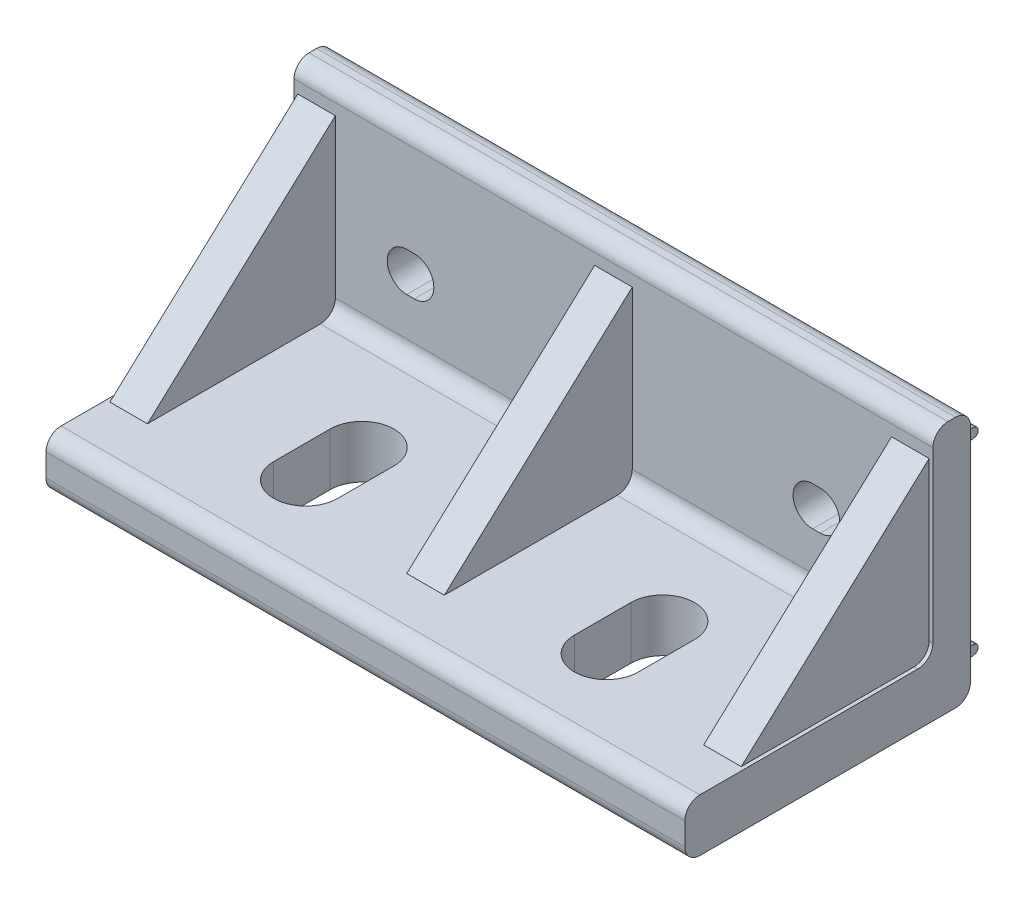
ISO-10303-21;
HEADER;
FILE_DESCRIPTION(('STEP AP214'),'2;1');
FILE_NAME('part.step','',(''),(''),'','','');
FILE_SCHEMA(('AUTOMOTIVE_DESIGN { 1 0 10303 214 1 1 1 1 }'));
ENDSEC;
DATA;
#1=APPLICATION_CONTEXT('core data for automotive mechanical design processes');
#2=APPLICATION_PROTOCOL_DEFINITION('international standard','automotive_design',2000,#1);
#3=PRODUCT_CONTEXT('',#1,'mechanical');
#4=PRODUCT('Part','Part','',(#3));
#5=PRODUCT_RELATED_PRODUCT_CATEGORY('part','',(#4));
#6=PRODUCT_DEFINITION_FORMATION('','',#4);
#7=PRODUCT_DEFINITION_CONTEXT('part definition',#1,'design');
#8=PRODUCT_DEFINITION('design','',#6,#7);
#9=PRODUCT_DEFINITION_SHAPE('','',#8);
#10=(LENGTH_UNIT() NAMED_UNIT(*) SI_UNIT(.MILLI.,.METRE.));
#11=(NAMED_UNIT(*) PLANE_ANGLE_UNIT() SI_UNIT($,.RADIAN.));
#12=(NAMED_UNIT(*) SI_UNIT($,.STERADIAN.) SOLID_ANGLE_UNIT());
#13=UNCERTAINTY_MEASURE_WITH_UNIT(LENGTH_MEASURE(1.E-05),#10,'distance_accuracy_value','');
#14=(GEOMETRIC_REPRESENTATION_CONTEXT(3) GLOBAL_UNCERTAINTY_ASSIGNED_CONTEXT((#13)) GLOBAL_UNIT_ASSIGNED_CONTEXT((#10,
#11,#12)) REPRESENTATION_CONTEXT('',''));
#15=CARTESIAN_POINT('',(0.,0.,0.));
#16=DIRECTION('',(0.,0.,1.));
#17=DIRECTION('',(1.,0.,0.));
#18=AXIS2_PLACEMENT_3D('',#15,#16,#17);
#19=CARTESIAN_POINT('',(-42.5,0.,2.));
#20=DIRECTION('',(0.,1.,0.));
#21=DIRECTION('',(-1.,0.,0.));
#22=AXIS2_PLACEMENT_3D('',#19,#20,#21);
#23=PLANE('',#22);
#24=DIRECTION('',(0.,0.,-1.));
#25=VECTOR('',#24,1.);
#26=CARTESIAN_POINT('',(24.25,0.,25.95));
#27=LINE('',#26,#25);
#28=CARTESIAN_POINT('',(24.25,0.,25.95));
#29=VERTEX_POINT('',#28);
#30=CARTESIAN_POINT('',(24.25,0.,18.45));
#31=VERTEX_POINT('',#30);
#32=EDGE_CURVE('E647',#29,#31,#27,.T.);
#33=ORIENTED_EDGE('',*,*,#32,.T.);
#34=CARTESIAN_POINT('',(20.,0.,18.45));
#35=DIRECTION('',(0.,1.,0.));
#36=DIRECTION('',(0.,0.,1.));
#37=AXIS2_PLACEMENT_3D('',#34,#35,#36);
#38=CIRCLE('',#37,4.25);
#39=CARTESIAN_POINT('',(15.75,0.,18.45));
#40=VERTEX_POINT('',#39);
#41=EDGE_CURVE('E681',#31,#40,#38,.T.);
#42=ORIENTED_EDGE('',*,*,#41,.T.);
#43=DIRECTION('',(0.,0.,1.));
#44=VECTOR('',#43,1.);
#45=CARTESIAN_POINT('',(15.75,0.,18.45));
#46=LINE('',#45,#44);
#47=CARTESIAN_POINT('',(15.75,0.,25.95));
#48=VERTEX_POINT('',#47);
#49=EDGE_CURVE('E684',#40,#48,#46,.T.);
#50=ORIENTED_EDGE('',*,*,#49,.T.);
#51=CARTESIAN_POINT('',(20.,0.,25.95));
#52=DIRECTION('',(0.,1.,0.));
#53=DIRECTION('',(0.,0.,1.));
#54=AXIS2_PLACEMENT_3D('',#51,#52,#53);
#55=CIRCLE('',#54,4.25);
#56=EDGE_CURVE('E671',#48,#29,#55,.T.);
#57=ORIENTED_EDGE('',*,*,#56,.T.);
#58=EDGE_LOOP('',(#33,#42,#50,#57));
#59=FACE_BOUND('',#58,.T.);
#60=DIRECTION('',(1.,0.,0.));
#61=VECTOR('',#60,1.);
#62=CARTESIAN_POINT('',(-31.,0.,19.));
#63=LINE('',#62,#61);
#64=CARTESIAN_POINT('',(-31.,0.,19.));
#65=VERTEX_POINT('',#64);
#66=CARTESIAN_POINT('',(-29.,0.,19.));
#67=VERTEX_POINT('',#66);
#68=EDGE_CURVE('E1169',#65,#67,#63,.T.);
#69=ORIENTED_EDGE('',*,*,#68,.F.);
#70=DIRECTION('',(0.,0.,-1.));
#71=VECTOR('',#70,1.);
#72=CARTESIAN_POINT('',(-31.,0.,27.));
#73=LINE('',#72,#71);
#74=CARTESIAN_POINT('',(-31.,0.,27.));
#75=VERTEX_POINT('',#74);
#76=EDGE_CURVE('E1129',#75,#65,#73,.T.);
#77=ORIENTED_EDGE('',*,*,#76,.F.);
#78=DIRECTION('',(1.,0.,0.));
#79=VECTOR('',#78,1.);
#80=CARTESIAN_POINT('',(-31.,0.,27.));
#81=LINE('',#80,#79);
#82=CARTESIAN_POINT('',(-29.,0.,27.));
#83=VERTEX_POINT('',#82);
#84=EDGE_CURVE('E1144',#75,#83,#81,.T.);
#85=ORIENTED_EDGE('',*,*,#84,.T.);
#86=DIRECTION('',(0.,0.,-1.));
#87=VECTOR('',#86,1.);
#88=CARTESIAN_POINT('',(-29.,0.,27.));
#89=LINE('',#88,#87);
#90=EDGE_CURVE('E1128',#83,#67,#89,.T.);
#91=ORIENTED_EDGE('',*,*,#90,.T.);
#92=EDGE_LOOP('',(#69,#77,#85,#91));
#93=FACE_BOUND('',#92,.T.);
#94=DIRECTION('',(1.,0.,0.));
#95=VECTOR('',#94,1.);
#96=CARTESIAN_POINT('',(29.,0.,19.));
#97=LINE('',#96,#95);
#98=CARTESIAN_POINT('',(29.,0.,19.));
#99=VERTEX_POINT('',#98);
#100=CARTESIAN_POINT('',(31.,0.,19.));
#101=VERTEX_POINT('',#100);
#102=EDGE_CURVE('E1213',#99,#101,#97,.T.);
#103=ORIENTED_EDGE('',*,*,#102,.F.);
#104=DIRECTION('',(0.,0.,-1.));
#105=VECTOR('',#104,1.);
#106=CARTESIAN_POINT('',(29.,0.,27.));
#107=LINE('',#106,#105);
#108=CARTESIAN_POINT('',(29.,0.,27.));
#109=VERTEX_POINT('',#108);
#110=EDGE_CURVE('E1173',#109,#99,#107,.T.);
#111=ORIENTED_EDGE('',*,*,#110,.F.);
#112=DIRECTION('',(1.,0.,0.));
#113=VECTOR('',#112,1.);
#114=CARTESIAN_POINT('',(29.,0.,27.));
#115=LINE('',#114,#113);
#116=CARTESIAN_POINT('',(31.,0.,27.));
#117=VERTEX_POINT('',#116);
#118=EDGE_CURVE('E1188',#109,#117,#115,.T.);
#119=ORIENTED_EDGE('',*,*,#118,.T.);
#120=DIRECTION('',(0.,0.,-1.));
#121=VECTOR('',#120,1.);
#122=CARTESIAN_POINT('',(31.,0.,27.));
#123=LINE('',#122,#121);
#124=EDGE_CURVE('E1172',#117,#101,#123,.T.);
#125=ORIENTED_EDGE('',*,*,#124,.T.);
#126=EDGE_LOOP('',(#103,#111,#119,#125));
#127=FACE_BOUND('',#126,.T.);
#128=DIRECTION('',(0.,0.,1.));
#129=VECTOR('',#128,1.);
#130=CARTESIAN_POINT('',(42.5,0.,2.));
#131=LINE('',#130,#129);
#132=CARTESIAN_POINT('',(42.5,0.,2.));
#133=VERTEX_POINT('',#132);
#134=CARTESIAN_POINT('',(42.5,0.,36.));
#135=VERTEX_POINT('',#134);
#136=EDGE_CURVE('E1329',#133,#135,#131,.T.);
#137=ORIENTED_EDGE('',*,*,#136,.T.);
#138=DIRECTION('',(1.,0.,0.));
#139=VECTOR('',#138,1.);
#140=CARTESIAN_POINT('',(-42.5,0.,36.));
#141=LINE('',#140,#139);
#142=CARTESIAN_POINT('',(-42.5,0.,36.));
#143=VERTEX_POINT('',#142);
#144=EDGE_CURVE('E1377',#143,#135,#141,.T.);
#145=ORIENTED_EDGE('',*,*,#144,.F.);
#146=DIRECTION('',(0.,0.,1.));
#147=VECTOR('',#146,1.);
#148=CARTESIAN_POINT('',(-42.5,0.,2.));
#149=LINE('',#148,#147);
#150=CARTESIAN_POINT('',(-42.5,0.,2.));
#151=VERTEX_POINT('',#150);
#152=EDGE_CURVE('E1303',#151,#143,#149,.T.);
#153=ORIENTED_EDGE('',*,*,#152,.F.);
#154=DIRECTION('',(1.,0.,0.));
#155=VECTOR('',#154,1.);
#156=CARTESIAN_POINT('',(-42.5,0.,2.));
#157=LINE('',#156,#155);
#158=EDGE_CURVE('E1380',#151,#133,#157,.T.);
#159=ORIENTED_EDGE('',*,*,#158,.T.);
#160=EDGE_LOOP('',(#137,#145,#153,#159));
#161=FACE_BOUND('',#160,.T.);
#162=DIRECTION('',(0.,0.,-1.));
#163=VECTOR('',#162,1.);
#164=CARTESIAN_POINT('',(-15.75,0.,25.95));
#165=LINE('',#164,#163);
#166=CARTESIAN_POINT('',(-15.75,0.,25.95));
#167=VERTEX_POINT('',#166);
#168=CARTESIAN_POINT('',(-15.75,0.,18.45));
#169=VERTEX_POINT('',#168);
#170=EDGE_CURVE('E29',#167,#169,#165,.T.);
#171=ORIENTED_EDGE('',*,*,#170,.T.);
#172=CARTESIAN_POINT('',(-20.,0.,18.45));
#173=DIRECTION('',(0.,1.,0.));
#174=DIRECTION('',(0.,0.,1.));
#175=AXIS2_PLACEMENT_3D('',#172,#173,#174);
#176=CIRCLE('',#175,4.25);
#177=CARTESIAN_POINT('',(-24.25,0.,18.45));
#178=VERTEX_POINT('',#177);
#179=EDGE_CURVE('E646',#169,#178,#176,.T.);
#180=ORIENTED_EDGE('',*,*,#179,.T.);
#181=DIRECTION('',(0.,0.,1.));
#182=VECTOR('',#181,1.);
#183=CARTESIAN_POINT('',(-24.25,0.,18.45));
#184=LINE('',#183,#182);
#185=CARTESIAN_POINT('',(-24.25,0.,25.95));
#186=VERTEX_POINT('',#185);
#187=EDGE_CURVE('E660',#178,#186,#184,.T.);
#188=ORIENTED_EDGE('',*,*,#187,.T.);
#189=CARTESIAN_POINT('',(-20.,0.,25.95));
#190=DIRECTION('',(0.,1.,0.));
#191=DIRECTION('',(0.,0.,1.));
#192=AXIS2_PLACEMENT_3D('',#189,#190,#191);
#193=CIRCLE('',#192,4.25);
#194=EDGE_CURVE('E640',#186,#167,#193,.T.);
#195=ORIENTED_EDGE('',*,*,#194,.T.);
#196=EDGE_LOOP('',(#171,#180,#188,#195));
#197=FACE_BOUND('',#196,.T.);
#198=ADVANCED_FACE('F14',(#59,#93,#127,#161,#197),#23,.F.);
#199=CARTESIAN_POINT('',(-42.5,7.,36.));
#200=DIRECTION('',(0.,-1.,0.));
#201=DIRECTION('',(1.,0.,0.));
#202=AXIS2_PLACEMENT_3D('',#199,#200,#201);
#203=PLANE('',#202);
#204=DIRECTION('',(0.,0.,-1.));
#205=VECTOR('',#204,1.);
#206=CARTESIAN_POINT('',(24.25,7.,25.95));
#207=LINE('',#206,#205);
#208=CARTESIAN_POINT('',(24.25,7.,25.95));
#209=VERTEX_POINT('',#208);
#210=CARTESIAN_POINT('',(24.25,7.,18.45));
#211=VERTEX_POINT('',#210);
#212=EDGE_CURVE('E668',#209,#211,#207,.T.);
#213=ORIENTED_EDGE('',*,*,#212,.F.);
#214=CARTESIAN_POINT('',(20.,7.,25.95));
#215=DIRECTION('',(0.,1.,0.));
#216=DIRECTION('',(0.,0.,1.));
#217=AXIS2_PLACEMENT_3D('',#214,#215,#216);
#218=CIRCLE('',#217,4.25);
#219=CARTESIAN_POINT('',(15.75,7.,25.95));
#220=VERTEX_POINT('',#219);
#221=EDGE_CURVE('E676',#220,#209,#218,.T.);
#222=ORIENTED_EDGE('',*,*,#221,.F.);
#223=DIRECTION('',(0.,0.,1.));
#224=VECTOR('',#223,1.);
#225=CARTESIAN_POINT('',(15.75,7.,18.45));
#226=LINE('',#225,#224);
#227=CARTESIAN_POINT('',(15.75,7.,18.45));
#228=VERTEX_POINT('',#227);
#229=EDGE_CURVE('E673',#228,#220,#226,.T.);
#230=ORIENTED_EDGE('',*,*,#229,.F.);
#231=CARTESIAN_POINT('',(20.,7.,18.45));
#232=DIRECTION('',(0.,1.,0.));
#233=DIRECTION('',(0.,0.,1.));
#234=AXIS2_PLACEMENT_3D('',#231,#232,#233);
#235=CIRCLE('',#234,4.25);
#236=EDGE_CURVE('E670',#211,#228,#235,.T.);
#237=ORIENTED_EDGE('',*,*,#236,.F.);
#238=EDGE_LOOP('',(#213,#222,#230,#237));
#239=FACE_BOUND('',#238,.T.);
#240=DIRECTION('',(1.,0.,0.));
#241=VECTOR('',#240,1.);
#242=CARTESIAN_POINT('',(37.,7.,30.));
#243=LINE('',#242,#241);
#244=CARTESIAN_POINT('',(37.,7.,30.));
#245=VERTEX_POINT('',#244);
#246=CARTESIAN_POINT('',(42.,7.,30.));
#247=VERTEX_POINT('',#246);
#248=EDGE_CURVE('E1234',#245,#247,#243,.T.);
#249=ORIENTED_EDGE('',*,*,#248,.F.);
#250=DIRECTION('',(0.,0.,1.));
#251=VECTOR('',#250,1.);
#252=CARTESIAN_POINT('',(37.,7.,5.));
#253=LINE('',#252,#251);
#254=CARTESIAN_POINT('',(37.,7.,7.));
#255=VERTEX_POINT('',#254);
#256=EDGE_CURVE('E1220',#255,#245,#253,.T.);
#257=ORIENTED_EDGE('',*,*,#256,.F.);
#258=DIRECTION('',(1.,0.,0.));
#259=VECTOR('',#258,1.);
#260=CARTESIAN_POINT('',(-42.5,7.,7.));
#261=LINE('',#260,#259);
#262=CARTESIAN_POINT('',(2.5,7.,7.));
#263=VERTEX_POINT('',#262);
#264=EDGE_CURVE('E1368',#263,#255,#261,.T.);
#265=ORIENTED_EDGE('',*,*,#264,.F.);
#266=DIRECTION('',(0.,0.,1.));
#267=VECTOR('',#266,1.);
#268=CARTESIAN_POINT('',(2.5,7.,5.));
#269=LINE('',#268,#267);
#270=CARTESIAN_POINT('',(2.5,7.,30.));
#271=VERTEX_POINT('',#270);
#272=EDGE_CURVE('E1281',#263,#271,#269,.T.);
#273=ORIENTED_EDGE('',*,*,#272,.T.);
#274=DIRECTION('',(1.,0.,0.));
#275=VECTOR('',#274,1.);
#276=CARTESIAN_POINT('',(-2.5,7.,30.));
#277=LINE('',#276,#275);
#278=CARTESIAN_POINT('',(-2.5,7.,30.));
#279=VERTEX_POINT('',#278);
#280=EDGE_CURVE('E1286',#279,#271,#277,.T.);
#281=ORIENTED_EDGE('',*,*,#280,.F.);
#282=DIRECTION('',(0.,0.,1.));
#283=VECTOR('',#282,1.);
#284=CARTESIAN_POINT('',(-2.5,7.,5.));
#285=LINE('',#284,#283);
#286=CARTESIAN_POINT('',(-2.5,7.,7.));
#287=VERTEX_POINT('',#286);
#288=EDGE_CURVE('E1272',#287,#279,#285,.T.);
#289=ORIENTED_EDGE('',*,*,#288,.F.);
#290=CARTESIAN_POINT('',(-37.,7.,7.));
#291=VERTEX_POINT('',#290);
#292=EDGE_CURVE('E1367',#291,#287,#261,.T.);
#293=ORIENTED_EDGE('',*,*,#292,.F.);
#294=DIRECTION('',(0.,0.,1.));
#295=VECTOR('',#294,1.);
#296=CARTESIAN_POINT('',(-37.,7.,5.));
#297=LINE('',#296,#295);
#298=CARTESIAN_POINT('',(-37.,7.,30.));
#299=VERTEX_POINT('',#298);
#300=EDGE_CURVE('E1255',#291,#299,#297,.T.);
#301=ORIENTED_EDGE('',*,*,#300,.T.);
#302=DIRECTION('',(1.,0.,0.));
#303=VECTOR('',#302,1.);
#304=CARTESIAN_POINT('',(-42.,7.,30.));
#305=LINE('',#304,#303);
#306=CARTESIAN_POINT('',(-42.,7.,30.));
#307=VERTEX_POINT('',#306);
#308=EDGE_CURVE('E1260',#307,#299,#305,.T.);
#309=ORIENTED_EDGE('',*,*,#308,.F.);
#310=DIRECTION('',(0.,0.,1.));
#311=VECTOR('',#310,1.);
#312=CARTESIAN_POINT('',(-42.,7.,5.));
#313=LINE('',#312,#311);
#314=CARTESIAN_POINT('',(-42.,7.,7.));
#315=VERTEX_POINT('',#314);
#316=EDGE_CURVE('E1246',#315,#307,#313,.T.);
#317=ORIENTED_EDGE('',*,*,#316,.F.);
#318=CARTESIAN_POINT('',(-42.5,7.,7.));
#319=VERTEX_POINT('',#318);
#320=EDGE_CURVE('E1363',#319,#315,#261,.T.);
#321=ORIENTED_EDGE('',*,*,#320,.F.);
#322=DIRECTION('',(0.,0.,-1.));
#323=VECTOR('',#322,1.);
#324=CARTESIAN_POINT('',(-42.5,7.,36.));
#325=LINE('',#324,#323);
#326=CARTESIAN_POINT('',(-42.5,7.,36.));
#327=VERTEX_POINT('',#326);
#328=EDGE_CURVE('E1311',#327,#319,#325,.T.);
#329=ORIENTED_EDGE('',*,*,#328,.F.);
#330=DIRECTION('',(1.,0.,0.));
#331=VECTOR('',#330,1.);
#332=CARTESIAN_POINT('',(-42.5,7.,36.));
#333=LINE('',#332,#331);
#334=CARTESIAN_POINT('',(42.5,7.,36.));
#335=VERTEX_POINT('',#334);
#336=EDGE_CURVE('E1366',#327,#335,#333,.T.);
#337=ORIENTED_EDGE('',*,*,#336,.T.);
#338=DIRECTION('',(0.,0.,-1.));
#339=VECTOR('',#338,1.);
#340=CARTESIAN_POINT('',(42.5,7.,36.));
#341=LINE('',#340,#339);
#342=CARTESIAN_POINT('',(42.5,7.,7.));
#343=VERTEX_POINT('',#342);
#344=EDGE_CURVE('E1337',#335,#343,#341,.T.);
#345=ORIENTED_EDGE('',*,*,#344,.T.);
#346=CARTESIAN_POINT('',(42.,7.,7.));
#347=VERTEX_POINT('',#346);
#348=EDGE_CURVE('E1360',#347,#343,#261,.T.);
#349=ORIENTED_EDGE('',*,*,#348,.F.);
#350=DIRECTION('',(0.,0.,1.));
#351=VECTOR('',#350,1.);
#352=CARTESIAN_POINT('',(42.,7.,5.));
#353=LINE('',#352,#351);
#354=EDGE_CURVE('E1229',#347,#247,#353,.T.);
#355=ORIENTED_EDGE('',*,*,#354,.T.);
#356=EDGE_LOOP('',(#249,#257,#265,#273,#281,#289,#293,#301,#309,#317,#321,#329,#337,#345,#349,#355));
#357=FACE_BOUND('',#356,.T.);
#358=DIRECTION('',(0.,0.,-1.));
#359=VECTOR('',#358,1.);
#360=CARTESIAN_POINT('',(-15.75,7.,25.95));
#361=LINE('',#360,#359);
#362=CARTESIAN_POINT('',(-15.75,7.,25.95));
#363=VERTEX_POINT('',#362);
#364=CARTESIAN_POINT('',(-15.75,7.,18.45));
#365=VERTEX_POINT('',#364);
#366=EDGE_CURVE('E631',#363,#365,#361,.T.);
#367=ORIENTED_EDGE('',*,*,#366,.F.);
#368=CARTESIAN_POINT('',(-20.,7.,25.95));
#369=DIRECTION('',(0.,1.,0.));
#370=DIRECTION('',(0.,0.,1.));
#371=AXIS2_PLACEMENT_3D('',#368,#369,#370);
#372=CIRCLE('',#371,4.25);
#373=CARTESIAN_POINT('',(-24.25,7.,25.95));
#374=VERTEX_POINT('',#373);
#375=EDGE_CURVE('E654',#374,#363,#372,.T.);
#376=ORIENTED_EDGE('',*,*,#375,.F.);
#377=DIRECTION('',(0.,0.,1.));
#378=VECTOR('',#377,1.);
#379=CARTESIAN_POINT('',(-24.25,7.,18.45));
#380=LINE('',#379,#378);
#381=CARTESIAN_POINT('',(-24.25,7.,18.45));
#382=VERTEX_POINT('',#381);
#383=EDGE_CURVE('E652',#382,#374,#380,.T.);
#384=ORIENTED_EDGE('',*,*,#383,.F.);
#385=CARTESIAN_POINT('',(-20.,7.,18.45));
#386=DIRECTION('',(0.,1.,0.));
#387=DIRECTION('',(0.,0.,1.));
#388=AXIS2_PLACEMENT_3D('',#385,#386,#387);
#389=CIRCLE('',#388,4.25);
#390=EDGE_CURVE('E639',#365,#382,#389,.T.);
#391=ORIENTED_EDGE('',*,*,#390,.F.);
#392=EDGE_LOOP('',(#367,#376,#384,#391));
#393=FACE_BOUND('',#392,.T.);
#394=ADVANCED_FACE('F651',(#239,#357,#393),#203,.F.);
#395=CARTESIAN_POINT('',(-42.5,31.5,0.));
#396=DIRECTION('',(0.,0.,1.));
#397=DIRECTION('',(1.,0.,0.));
#398=AXIS2_PLACEMENT_3D('',#395,#396,#397);
#399=PLANE('',#398);
#400=DIRECTION('',(-1.,0.,0.));
#401=VECTOR('',#400,1.);
#402=CARTESIAN_POINT('',(27.5,19.35,0.));
#403=LINE('',#402,#401);
#404=CARTESIAN_POINT('',(27.5,19.35,0.));
#405=VERTEX_POINT('',#404);
#406=CARTESIAN_POINT('',(26.5,19.35,0.));
#407=VERTEX_POINT('',#406);
#408=EDGE_CURVE('E729',#405,#407,#403,.T.);
#409=ORIENTED_EDGE('',*,*,#408,.T.);
#410=CARTESIAN_POINT('',(26.5,16.75,0.));
#411=DIRECTION('',(0.,0.,1.));
#412=DIRECTION('',(1.,0.,0.));
#413=AXIS2_PLACEMENT_3D('',#410,#411,#412);
#414=CIRCLE('',#413,2.6);
#415=CARTESIAN_POINT('',(26.5,14.15,0.));
#416=VERTEX_POINT('',#415);
#417=EDGE_CURVE('E743',#407,#416,#414,.T.);
#418=ORIENTED_EDGE('',*,*,#417,.T.);
#419=DIRECTION('',(1.,0.,0.));
#420=VECTOR('',#419,1.);
#421=CARTESIAN_POINT('',(26.5,14.15,0.));
#422=LINE('',#421,#420);
#423=CARTESIAN_POINT('',(27.5,14.15,0.));
#424=VERTEX_POINT('',#423);
#425=EDGE_CURVE('E746',#416,#424,#422,.T.);
#426=ORIENTED_EDGE('',*,*,#425,.T.);
#427=CARTESIAN_POINT('',(27.5,16.75,0.));
#428=DIRECTION('',(0.,0.,1.));
#429=DIRECTION('',(1.,0.,0.));
#430=AXIS2_PLACEMENT_3D('',#427,#428,#429);
#431=CIRCLE('',#430,2.6);
#432=EDGE_CURVE('E733',#424,#405,#431,.T.);
#433=ORIENTED_EDGE('',*,*,#432,.T.);
#434=EDGE_LOOP('',(#409,#418,#426,#433));
#435=FACE_BOUND('',#434,.T.);
#436=DIRECTION('',(1.,0.,0.));
#437=VECTOR('',#436,1.);
#438=CARTESIAN_POINT('',(-41.,5.,0.));
#439=LINE('',#438,#437);
#440=CARTESIAN_POINT('',(-41.,5.,0.));
#441=VERTEX_POINT('',#440);
#442=CARTESIAN_POINT('',(-39.,5.,0.));
#443=VERTEX_POINT('',#442);
#444=EDGE_CURVE('E792',#441,#443,#439,.T.);
#445=ORIENTED_EDGE('',*,*,#444,.F.);
#446=DIRECTION('',(0.,1.,0.));
#447=VECTOR('',#446,1.);
#448=CARTESIAN_POINT('',(-41.,3.,0.));
#449=LINE('',#448,#447);
#450=CARTESIAN_POINT('',(-41.,3.,0.));
#451=VERTEX_POINT('',#450);
#452=EDGE_CURVE('E772',#451,#441,#449,.T.);
#453=ORIENTED_EDGE('',*,*,#452,.F.);
#454=DIRECTION('',(1.,0.,0.));
#455=VECTOR('',#454,1.);
#456=CARTESIAN_POINT('',(-41.,3.,0.));
#457=LINE('',#456,#455);
#458=CARTESIAN_POINT('',(-39.,3.,0.));
#459=VERTEX_POINT('',#458);
#460=EDGE_CURVE('E795',#451,#459,#457,.T.);
#461=ORIENTED_EDGE('',*,*,#460,.T.);
#462=DIRECTION('',(0.,1.,0.));
#463=VECTOR('',#462,1.);
#464=CARTESIAN_POINT('',(-39.,3.,0.));
#465=LINE('',#464,#463);
#466=EDGE_CURVE('E787',#459,#443,#465,.T.);
#467=ORIENTED_EDGE('',*,*,#466,.T.);
#468=EDGE_LOOP('',(#445,#453,#461,#467));
#469=FACE_BOUND('',#468,.T.);
#470=DIRECTION('',(1.,0.,0.));
#471=VECTOR('',#470,1.);
#472=CARTESIAN_POINT('',(39.,5.,0.));
#473=LINE('',#472,#471);
#474=CARTESIAN_POINT('',(39.,5.,0.));
#475=VERTEX_POINT('',#474);
#476=CARTESIAN_POINT('',(41.,5.,0.));
#477=VERTEX_POINT('',#476);
#478=EDGE_CURVE('E838',#475,#477,#473,.T.);
#479=ORIENTED_EDGE('',*,*,#478,.F.);
#480=DIRECTION('',(0.,1.,0.));
#481=VECTOR('',#480,1.);
#482=CARTESIAN_POINT('',(39.,3.,0.));
#483=LINE('',#482,#481);
#484=CARTESIAN_POINT('',(39.,3.,0.));
#485=VERTEX_POINT('',#484);
#486=EDGE_CURVE('E818',#485,#475,#483,.T.);
#487=ORIENTED_EDGE('',*,*,#486,.F.);
#488=DIRECTION('',(1.,0.,0.));
#489=VECTOR('',#488,1.);
#490=CARTESIAN_POINT('',(39.,3.,0.));
#491=LINE('',#490,#489);
#492=CARTESIAN_POINT('',(41.,3.,0.));
#493=VERTEX_POINT('',#492);
#494=EDGE_CURVE('E841',#485,#493,#491,.T.);
#495=ORIENTED_EDGE('',*,*,#494,.T.);
#496=DIRECTION('',(0.,1.,0.));
#497=VECTOR('',#496,1.);
#498=CARTESIAN_POINT('',(41.,3.,0.));
#499=LINE('',#498,#497);
#500=EDGE_CURVE('E833',#493,#477,#499,.T.);
#501=ORIENTED_EDGE('',*,*,#500,.T.);
#502=EDGE_LOOP('',(#479,#487,#495,#501));
#503=FACE_BOUND('',#502,.T.);
#504=DIRECTION('',(1.,0.,0.));
#505=VECTOR('',#504,1.);
#506=CARTESIAN_POINT('',(19.,5.,0.));
#507=LINE('',#506,#505);
#508=CARTESIAN_POINT('',(19.,5.,0.));
#509=VERTEX_POINT('',#508);
#510=CARTESIAN_POINT('',(21.,5.,0.));
#511=VERTEX_POINT('',#510);
#512=EDGE_CURVE('E884',#509,#511,#507,.T.);
#513=ORIENTED_EDGE('',*,*,#512,.F.);
#514=DIRECTION('',(0.,1.,0.));
#515=VECTOR('',#514,1.);
#516=CARTESIAN_POINT('',(19.,3.,0.));
#517=LINE('',#516,#515);
#518=CARTESIAN_POINT('',(19.,3.,0.));
#519=VERTEX_POINT('',#518);
#520=EDGE_CURVE('E864',#519,#509,#517,.T.);
#521=ORIENTED_EDGE('',*,*,#520,.F.);
#522=DIRECTION('',(1.,0.,0.));
#523=VECTOR('',#522,1.);
#524=CARTESIAN_POINT('',(19.,3.,0.));
#525=LINE('',#524,#523);
#526=CARTESIAN_POINT('',(21.,3.,0.));
#527=VERTEX_POINT('',#526);
#528=EDGE_CURVE('E887',#519,#527,#525,.T.);
#529=ORIENTED_EDGE('',*,*,#528,.T.);
#530=DIRECTION('',(0.,1.,0.));
#531=VECTOR('',#530,1.);
#532=CARTESIAN_POINT('',(21.,3.,0.));
#533=LINE('',#532,#531);
#534=EDGE_CURVE('E879',#527,#511,#533,.T.);
#535=ORIENTED_EDGE('',*,*,#534,.T.);
#536=EDGE_LOOP('',(#513,#521,#529,#535));
#537=FACE_BOUND('',#536,.T.);
#538=DIRECTION('',(1.,0.,0.));
#539=VECTOR('',#538,1.);
#540=CARTESIAN_POINT('',(-21.,5.,0.));
#541=LINE('',#540,#539);
#542=CARTESIAN_POINT('',(-21.,5.,0.));
#543=VERTEX_POINT('',#542);
#544=CARTESIAN_POINT('',(-19.,5.,0.));
#545=VERTEX_POINT('',#544);
#546=EDGE_CURVE('E930',#543,#545,#541,.T.);
#547=ORIENTED_EDGE('',*,*,#546,.F.);
#548=DIRECTION('',(0.,1.,0.));
#549=VECTOR('',#548,1.);
#550=CARTESIAN_POINT('',(-21.,3.,0.));
#551=LINE('',#550,#549);
#552=CARTESIAN_POINT('',(-21.,3.,0.));
#553=VERTEX_POINT('',#552);
#554=EDGE_CURVE('E910',#553,#543,#551,.T.);
#555=ORIENTED_EDGE('',*,*,#554,.F.);
#556=DIRECTION('',(1.,0.,0.));
#557=VECTOR('',#556,1.);
#558=CARTESIAN_POINT('',(-21.,3.,0.));
#559=LINE('',#558,#557);
#560=CARTESIAN_POINT('',(-19.,3.,0.));
#561=VERTEX_POINT('',#560);
#562=EDGE_CURVE('E933',#553,#561,#559,.T.);
#563=ORIENTED_EDGE('',*,*,#562,.T.);
#564=DIRECTION('',(0.,1.,0.));
#565=VECTOR('',#564,1.);
#566=CARTESIAN_POINT('',(-19.,3.,0.));
#567=LINE('',#566,#565);
#568=EDGE_CURVE('E925',#561,#545,#567,.T.);
#569=ORIENTED_EDGE('',*,*,#568,.T.);
#570=EDGE_LOOP('',(#547,#555,#563,#569));
#571=FACE_BOUND('',#570,.T.);
#572=DIRECTION('',(1.,0.,0.));
#573=VECTOR('',#572,1.);
#574=CARTESIAN_POINT('',(39.,30.,0.));
#575=LINE('',#574,#573);
#576=CARTESIAN_POINT('',(39.,30.,0.));
#577=VERTEX_POINT('',#576);
#578=CARTESIAN_POINT('',(41.,30.,0.));
#579=VERTEX_POINT('',#578);
#580=EDGE_CURVE('E976',#577,#579,#575,.T.);
#581=ORIENTED_EDGE('',*,*,#580,.F.);
#582=DIRECTION('',(0.,1.,0.));
#583=VECTOR('',#582,1.);
#584=CARTESIAN_POINT('',(39.,28.,0.));
#585=LINE('',#584,#583);
#586=CARTESIAN_POINT('',(39.,28.,0.));
#587=VERTEX_POINT('',#586);
#588=EDGE_CURVE('E956',#587,#577,#585,.T.);
#589=ORIENTED_EDGE('',*,*,#588,.F.);
#590=DIRECTION('',(1.,0.,0.));
#591=VECTOR('',#590,1.);
#592=CARTESIAN_POINT('',(39.,28.,0.));
#593=LINE('',#592,#591);
#594=CARTESIAN_POINT('',(41.,28.,0.));
#595=VERTEX_POINT('',#594);
#596=EDGE_CURVE('E979',#587,#595,#593,.T.);
#597=ORIENTED_EDGE('',*,*,#596,.T.);
#598=DIRECTION('',(0.,1.,0.));
#599=VECTOR('',#598,1.);
#600=CARTESIAN_POINT('',(41.,28.,0.));
#601=LINE('',#600,#599);
#602=EDGE_CURVE('E971',#595,#579,#601,.T.);
#603=ORIENTED_EDGE('',*,*,#602,.T.);
#604=EDGE_LOOP('',(#581,#589,#597,#603));
#605=FACE_BOUND('',#604,.T.);
#606=DIRECTION('',(1.,0.,0.));
#607=VECTOR('',#606,1.);
#608=CARTESIAN_POINT('',(19.,30.,0.));
#609=LINE('',#608,#607);
#610=CARTESIAN_POINT('',(19.,30.,0.));
#611=VERTEX_POINT('',#610);
#612=CARTESIAN_POINT('',(21.,30.,0.));
#613=VERTEX_POINT('',#612);
#614=EDGE_CURVE('E1022',#611,#613,#609,.T.);
#615=ORIENTED_EDGE('',*,*,#614,.F.);
#616=DIRECTION('',(0.,1.,0.));
#617=VECTOR('',#616,1.);
#618=CARTESIAN_POINT('',(19.,28.,0.));
#619=LINE('',#618,#617);
#620=CARTESIAN_POINT('',(19.,28.,0.));
#621=VERTEX_POINT('',#620);
#622=EDGE_CURVE('E1002',#621,#611,#619,.T.);
#623=ORIENTED_EDGE('',*,*,#622,.F.);
#624=DIRECTION('',(1.,0.,0.));
#625=VECTOR('',#624,1.);
#626=CARTESIAN_POINT('',(19.,28.,0.));
#627=LINE('',#626,#625);
#628=CARTESIAN_POINT('',(21.,28.,0.));
#629=VERTEX_POINT('',#628);
#630=EDGE_CURVE('E1025',#621,#629,#627,.T.);
#631=ORIENTED_EDGE('',*,*,#630,.T.);
#632=DIRECTION('',(0.,1.,0.));
#633=VECTOR('',#632,1.);
#634=CARTESIAN_POINT('',(21.,28.,0.));
#635=LINE('',#634,#633);
#636=EDGE_CURVE('E1017',#629,#613,#635,.T.);
#637=ORIENTED_EDGE('',*,*,#636,.T.);
#638=EDGE_LOOP('',(#615,#623,#631,#637));
#639=FACE_BOUND('',#638,.T.);
#640=DIRECTION('',(1.,0.,0.));
#641=VECTOR('',#640,1.);
#642=CARTESIAN_POINT('',(-21.,30.,0.));
#643=LINE('',#642,#641);
#644=CARTESIAN_POINT('',(-21.,30.,0.));
#645=VERTEX_POINT('',#644);
#646=CARTESIAN_POINT('',(-19.,30.,0.));
#647=VERTEX_POINT('',#646);
#648=EDGE_CURVE('E1068',#645,#647,#643,.T.);
#649=ORIENTED_EDGE('',*,*,#648,.F.);
#650=DIRECTION('',(0.,1.,0.));
#651=VECTOR('',#650,1.);
#652=CARTESIAN_POINT('',(-21.,28.,0.));
#653=LINE('',#652,#651);
#654=CARTESIAN_POINT('',(-21.,28.,0.));
#655=VERTEX_POINT('',#654);
#656=EDGE_CURVE('E1048',#655,#645,#653,.T.);
#657=ORIENTED_EDGE('',*,*,#656,.F.);
#658=DIRECTION('',(1.,0.,0.));
#659=VECTOR('',#658,1.);
#660=CARTESIAN_POINT('',(-21.,28.,0.));
#661=LINE('',#660,#659);
#662=CARTESIAN_POINT('',(-19.,28.,0.));
#663=VERTEX_POINT('',#662);
#664=EDGE_CURVE('E1071',#655,#663,#661,.T.);
#665=ORIENTED_EDGE('',*,*,#664,.T.);
#666=DIRECTION('',(0.,1.,0.));
#667=VECTOR('',#666,1.);
#668=CARTESIAN_POINT('',(-19.,28.,0.));
#669=LINE('',#668,#667);
#670=EDGE_CURVE('E1063',#663,#647,#669,.T.);
#671=ORIENTED_EDGE('',*,*,#670,.T.);
#672=EDGE_LOOP('',(#649,#657,#665,#671));
#673=FACE_BOUND('',#672,.T.);
#674=DIRECTION('',(1.,0.,0.));
#675=VECTOR('',#674,1.);
#676=CARTESIAN_POINT('',(-41.,30.,0.));
#677=LINE('',#676,#675);
#678=CARTESIAN_POINT('',(-41.,30.,0.));
#679=VERTEX_POINT('',#678);
#680=CARTESIAN_POINT('',(-39.,30.,0.));
#681=VERTEX_POINT('',#680);
#682=EDGE_CURVE('E1114',#679,#681,#677,.T.);
#683=ORIENTED_EDGE('',*,*,#682,.F.);
#684=DIRECTION('',(0.,1.,0.));
#685=VECTOR('',#684,1.);
#686=CARTESIAN_POINT('',(-41.,28.,0.));
#687=LINE('',#686,#685);
#688=CARTESIAN_POINT('',(-41.,28.,0.));
#689=VERTEX_POINT('',#688);
#690=EDGE_CURVE('E1094',#689,#679,#687,.T.);
#691=ORIENTED_EDGE('',*,*,#690,.F.);
#692=DIRECTION('',(1.,0.,0.));
#693=VECTOR('',#692,1.);
#694=CARTESIAN_POINT('',(-41.,28.,0.));
#695=LINE('',#694,#693);
#696=CARTESIAN_POINT('',(-39.,28.,0.));
#697=VERTEX_POINT('',#696);
#698=EDGE_CURVE('E1117',#689,#697,#695,.T.);
#699=ORIENTED_EDGE('',*,*,#698,.T.);
#700=DIRECTION('',(0.,1.,0.));
#701=VECTOR('',#700,1.);
#702=CARTESIAN_POINT('',(-39.,28.,0.));
#703=LINE('',#702,#701);
#704=EDGE_CURVE('E1109',#697,#681,#703,.T.);
#705=ORIENTED_EDGE('',*,*,#704,.T.);
#706=EDGE_LOOP('',(#683,#691,#699,#705));
#707=FACE_BOUND('',#706,.T.);
#708=DIRECTION('',(0.,-1.,0.));
#709=VECTOR('',#708,1.);
#710=CARTESIAN_POINT('',(42.5,31.5,0.));
#711=LINE('',#710,#709);
#712=CARTESIAN_POINT('',(42.5,31.5,0.));
#713=VERTEX_POINT('',#712);
#714=CARTESIAN_POINT('',(42.5,2.,0.));
#715=VERTEX_POINT('',#714);
#716=EDGE_CURVE('E1325',#713,#715,#711,.T.);
#717=ORIENTED_EDGE('',*,*,#716,.T.);
#718=DIRECTION('',(1.,0.,0.));
#719=VECTOR('',#718,1.);
#720=CARTESIAN_POINT('',(-42.5,2.,0.));
#721=LINE('',#720,#719);
#722=CARTESIAN_POINT('',(-42.5,2.,0.));
#723=VERTEX_POINT('',#722);
#724=EDGE_CURVE('E22',#723,#715,#721,.T.);
#725=ORIENTED_EDGE('',*,*,#724,.F.);
#726=DIRECTION('',(0.,-1.,0.));
#727=VECTOR('',#726,1.);
#728=CARTESIAN_POINT('',(-42.5,31.5,0.));
#729=LINE('',#728,#727);
#730=CARTESIAN_POINT('',(-42.5,31.5,0.));
#731=VERTEX_POINT('',#730);
#732=EDGE_CURVE('E1298',#731,#723,#729,.T.);
#733=ORIENTED_EDGE('',*,*,#732,.F.);
#734=DIRECTION('',(1.,0.,0.));
#735=VECTOR('',#734,1.);
#736=CARTESIAN_POINT('',(-42.5,31.5,0.));
#737=LINE('',#736,#735);
#738=EDGE_CURVE('E9',#731,#713,#737,.T.);
#739=ORIENTED_EDGE('',*,*,#738,.T.);
#740=EDGE_LOOP('',(#717,#725,#733,#739));
#741=FACE_BOUND('',#740,.T.);
#742=DIRECTION('',(-1.,0.,0.));
#743=VECTOR('',#742,1.);
#744=CARTESIAN_POINT('',(-26.5,19.35,0.));
#745=LINE('',#744,#743);
#746=CARTESIAN_POINT('',(-26.5,19.35,0.));
#747=VERTEX_POINT('',#746);
#748=CARTESIAN_POINT('',(-27.5,19.35,0.));
#749=VERTEX_POINT('',#748);
#750=EDGE_CURVE('E698',#747,#749,#745,.T.);
#751=ORIENTED_EDGE('',*,*,#750,.T.);
#752=CARTESIAN_POINT('',(-27.5,16.75,0.));
#753=DIRECTION('',(0.,0.,1.));
#754=DIRECTION('',(1.,0.,0.));
#755=AXIS2_PLACEMENT_3D('',#752,#753,#754);
#756=CIRCLE('',#755,2.6);
#757=CARTESIAN_POINT('',(-27.5,14.15,0.));
#758=VERTEX_POINT('',#757);
#759=EDGE_CURVE('E712',#749,#758,#756,.T.);
#760=ORIENTED_EDGE('',*,*,#759,.T.);
#761=DIRECTION('',(1.,0.,0.));
#762=VECTOR('',#761,1.);
#763=CARTESIAN_POINT('',(-27.5,14.15,0.));
#764=LINE('',#763,#762);
#765=CARTESIAN_POINT('',(-26.5,14.15,0.));
#766=VERTEX_POINT('',#765);
#767=EDGE_CURVE('E715',#758,#766,#764,.T.);
#768=ORIENTED_EDGE('',*,*,#767,.T.);
#769=CARTESIAN_POINT('',(-26.5,16.75,0.));
#770=DIRECTION('',(0.,0.,1.));
#771=DIRECTION('',(1.,0.,0.));
#772=AXIS2_PLACEMENT_3D('',#769,#770,#771);
#773=CIRCLE('',#772,2.6);
#774=EDGE_CURVE('E702',#766,#747,#773,.T.);
#775=ORIENTED_EDGE('',*,*,#774,.T.);
#776=EDGE_LOOP('',(#751,#760,#768,#775));
#777=FACE_BOUND('',#776,.T.);
#778=ADVANCED_FACE('F1410',(#435,#469,#503,#537,#571,#605,#639,#673,#707,#741,#777),#399,.F.);
#779=CARTESIAN_POINT('',(-42.5,9.,5.));
#780=DIRECTION('',(0.,0.,-1.));
#781=DIRECTION('',(-1.,0.,0.));
#782=AXIS2_PLACEMENT_3D('',#779,#780,#781);
#783=PLANE('',#782);
#784=DIRECTION('',(-1.,0.,0.));
#785=VECTOR('',#784,1.);
#786=CARTESIAN_POINT('',(27.5,19.35,5.));
#787=LINE('',#786,#785);
#788=CARTESIAN_POINT('',(27.5,19.35,5.));
#789=VERTEX_POINT('',#788);
#790=CARTESIAN_POINT('',(26.5,19.35,5.));
#791=VERTEX_POINT('',#790);
#792=EDGE_CURVE('E730',#789,#791,#787,.T.);
#793=ORIENTED_EDGE('',*,*,#792,.F.);
#794=CARTESIAN_POINT('',(27.5,16.75,5.));
#795=DIRECTION('',(0.,0.,1.));
#796=DIRECTION('',(1.,0.,0.));
#797=AXIS2_PLACEMENT_3D('',#794,#795,#796);
#798=CIRCLE('',#797,2.6);
#799=CARTESIAN_POINT('',(27.5,14.15,5.));
#800=VERTEX_POINT('',#799);
#801=EDGE_CURVE('E738',#800,#789,#798,.T.);
#802=ORIENTED_EDGE('',*,*,#801,.F.);
#803=DIRECTION('',(1.,0.,0.));
#804=VECTOR('',#803,1.);
#805=CARTESIAN_POINT('',(26.5,14.15,5.));
#806=LINE('',#805,#804);
#807=CARTESIAN_POINT('',(26.5,14.15,5.));
#808=VERTEX_POINT('',#807);
#809=EDGE_CURVE('E735',#808,#800,#806,.T.);
#810=ORIENTED_EDGE('',*,*,#809,.F.);
#811=CARTESIAN_POINT('',(26.5,16.75,5.));
#812=DIRECTION('',(0.,0.,1.));
#813=DIRECTION('',(1.,0.,0.));
#814=AXIS2_PLACEMENT_3D('',#811,#812,#813);
#815=CIRCLE('',#814,2.6);
#816=EDGE_CURVE('E732',#791,#808,#815,.T.);
#817=ORIENTED_EDGE('',*,*,#816,.F.);
#818=EDGE_LOOP('',(#793,#802,#810,#817));
#819=FACE_BOUND('',#818,.T.);
#820=DIRECTION('',(1.,0.,0.));
#821=VECTOR('',#820,1.);
#822=CARTESIAN_POINT('',(-42.5,9.,5.));
#823=LINE('',#822,#821);
#824=CARTESIAN_POINT('',(2.5,9.,5.));
#825=VERTEX_POINT('',#824);
#826=CARTESIAN_POINT('',(37.,9.,5.));
#827=VERTEX_POINT('',#826);
#828=EDGE_CURVE('E1362',#825,#827,#823,.T.);
#829=ORIENTED_EDGE('',*,*,#828,.T.);
#830=DIRECTION('',(0.,-1.,0.));
#831=VECTOR('',#830,1.);
#832=CARTESIAN_POINT('',(37.,30.,5.));
#833=LINE('',#832,#831);
#834=CARTESIAN_POINT('',(37.,30.,5.));
#835=VERTEX_POINT('',#834);
#836=EDGE_CURVE('E1217',#835,#827,#833,.T.);
#837=ORIENTED_EDGE('',*,*,#836,.F.);
#838=DIRECTION('',(1.,0.,0.));
#839=VECTOR('',#838,1.);
#840=CARTESIAN_POINT('',(37.,30.,5.));
#841=LINE('',#840,#839);
#842=CARTESIAN_POINT('',(42.,30.,5.));
#843=VERTEX_POINT('',#842);
#844=EDGE_CURVE('E1227',#835,#843,#841,.T.);
#845=ORIENTED_EDGE('',*,*,#844,.T.);
#846=DIRECTION('',(0.,-1.,0.));
#847=VECTOR('',#846,1.);
#848=CARTESIAN_POINT('',(42.,30.,5.));
#849=LINE('',#848,#847);
#850=CARTESIAN_POINT('',(42.,9.,5.));
#851=VERTEX_POINT('',#850);
#852=EDGE_CURVE('E1216',#843,#851,#849,.T.);
#853=ORIENTED_EDGE('',*,*,#852,.T.);
#854=CARTESIAN_POINT('',(42.5,9.,5.));
#855=VERTEX_POINT('',#854);
#856=EDGE_CURVE('E1356',#851,#855,#823,.T.);
#857=ORIENTED_EDGE('',*,*,#856,.T.);
#858=DIRECTION('',(0.,1.,0.));
#859=VECTOR('',#858,1.);
#860=CARTESIAN_POINT('',(42.5,9.,5.));
#861=LINE('',#860,#859);
#862=CARTESIAN_POINT('',(42.5,31.5,5.));
#863=VERTEX_POINT('',#862);
#864=EDGE_CURVE('E1343',#855,#863,#861,.T.);
#865=ORIENTED_EDGE('',*,*,#864,.T.);
#866=DIRECTION('',(1.,0.,0.));
#867=VECTOR('',#866,1.);
#868=CARTESIAN_POINT('',(-42.5,31.5,5.));
#869=LINE('',#868,#867);
#870=CARTESIAN_POINT('',(-42.5,31.5,5.));
#871=VERTEX_POINT('',#870);
#872=EDGE_CURVE('E1353',#871,#863,#869,.T.);
#873=ORIENTED_EDGE('',*,*,#872,.F.);
#874=DIRECTION('',(0.,1.,0.));
#875=VECTOR('',#874,1.);
#876=CARTESIAN_POINT('',(-42.5,9.,5.));
#877=LINE('',#876,#875);
#878=CARTESIAN_POINT('',(-42.5,9.,5.));
#879=VERTEX_POINT('',#878);
#880=EDGE_CURVE('E1316',#879,#871,#877,.T.);
#881=ORIENTED_EDGE('',*,*,#880,.F.);
#882=CARTESIAN_POINT('',(-42.,9.,5.));
#883=VERTEX_POINT('',#882);
#884=EDGE_CURVE('E1357',#879,#883,#823,.T.);
#885=ORIENTED_EDGE('',*,*,#884,.T.);
#886=DIRECTION('',(0.,-1.,0.));
#887=VECTOR('',#886,1.);
#888=CARTESIAN_POINT('',(-42.,30.,5.));
#889=LINE('',#888,#887);
#890=CARTESIAN_POINT('',(-42.,30.,5.));
#891=VERTEX_POINT('',#890);
#892=EDGE_CURVE('E1243',#891,#883,#889,.T.);
#893=ORIENTED_EDGE('',*,*,#892,.F.);
#894=DIRECTION('',(1.,0.,0.));
#895=VECTOR('',#894,1.);
#896=CARTESIAN_POINT('',(-42.,30.,5.));
#897=LINE('',#896,#895);
#898=CARTESIAN_POINT('',(-37.,30.,5.));
#899=VERTEX_POINT('',#898);
#900=EDGE_CURVE('E1253',#891,#899,#897,.T.);
#901=ORIENTED_EDGE('',*,*,#900,.T.);
#902=DIRECTION('',(0.,-1.,0.));
#903=VECTOR('',#902,1.);
#904=CARTESIAN_POINT('',(-37.,30.,5.));
#905=LINE('',#904,#903);
#906=CARTESIAN_POINT('',(-37.,9.,5.));
#907=VERTEX_POINT('',#906);
#908=EDGE_CURVE('E1242',#899,#907,#905,.T.);
#909=ORIENTED_EDGE('',*,*,#908,.T.);
#910=CARTESIAN_POINT('',(-2.5,9.,5.));
#911=VERTEX_POINT('',#910);
#912=EDGE_CURVE('E1361',#907,#911,#823,.T.);
#913=ORIENTED_EDGE('',*,*,#912,.T.);
#914=DIRECTION('',(0.,-1.,0.));
#915=VECTOR('',#914,1.);
#916=CARTESIAN_POINT('',(-2.5,30.,5.));
#917=LINE('',#916,#915);
#918=CARTESIAN_POINT('',(-2.5,30.,5.));
#919=VERTEX_POINT('',#918);
#920=EDGE_CURVE('E1269',#919,#911,#917,.T.);
#921=ORIENTED_EDGE('',*,*,#920,.F.);
#922=DIRECTION('',(1.,0.,0.));
#923=VECTOR('',#922,1.);
#924=CARTESIAN_POINT('',(-2.5,30.,5.));
#925=LINE('',#924,#923);
#926=CARTESIAN_POINT('',(2.5,30.,5.));
#927=VERTEX_POINT('',#926);
#928=EDGE_CURVE('E1279',#919,#927,#925,.T.);
#929=ORIENTED_EDGE('',*,*,#928,.T.);
#930=DIRECTION('',(0.,-1.,0.));
#931=VECTOR('',#930,1.);
#932=CARTESIAN_POINT('',(2.5,30.,5.));
#933=LINE('',#932,#931);
#934=EDGE_CURVE('E1268',#927,#825,#933,.T.);
#935=ORIENTED_EDGE('',*,*,#934,.T.);
#936=EDGE_LOOP('',(#829,#837,#845,#853,#857,#865,#873,#881,#885,#893,#901,#909,#913,#921,#929,#935));
#937=FACE_BOUND('',#936,.T.);
#938=DIRECTION('',(-1.,0.,0.));
#939=VECTOR('',#938,1.);
#940=CARTESIAN_POINT('',(-26.5,19.35,5.));
#941=LINE('',#940,#939);
#942=CARTESIAN_POINT('',(-26.5,19.35,5.));
#943=VERTEX_POINT('',#942);
#944=CARTESIAN_POINT('',(-27.5,19.35,5.));
#945=VERTEX_POINT('',#944);
#946=EDGE_CURVE('E699',#943,#945,#941,.T.);
#947=ORIENTED_EDGE('',*,*,#946,.F.);
#948=CARTESIAN_POINT('',(-26.5,16.75,5.));
#949=DIRECTION('',(0.,0.,1.));
#950=DIRECTION('',(1.,0.,0.));
#951=AXIS2_PLACEMENT_3D('',#948,#949,#950);
#952=CIRCLE('',#951,2.6);
#953=CARTESIAN_POINT('',(-26.5,14.15,5.));
#954=VERTEX_POINT('',#953);
#955=EDGE_CURVE('E707',#954,#943,#952,.T.);
#956=ORIENTED_EDGE('',*,*,#955,.F.);
#957=DIRECTION('',(1.,0.,0.));
#958=VECTOR('',#957,1.);
#959=CARTESIAN_POINT('',(-27.5,14.15,5.));
#960=LINE('',#959,#958);
#961=CARTESIAN_POINT('',(-27.5,14.15,5.));
#962=VERTEX_POINT('',#961);
#963=EDGE_CURVE('E704',#962,#954,#960,.T.);
#964=ORIENTED_EDGE('',*,*,#963,.F.);
#965=CARTESIAN_POINT('',(-27.5,16.75,5.));
#966=DIRECTION('',(0.,0.,1.));
#967=DIRECTION('',(1.,0.,0.));
#968=AXIS2_PLACEMENT_3D('',#965,#966,#967);
#969=CIRCLE('',#968,2.6);
#970=EDGE_CURVE('E701',#945,#962,#969,.T.);
#971=ORIENTED_EDGE('',*,*,#970,.F.);
#972=EDGE_LOOP('',(#947,#956,#964,#971));
#973=FACE_BOUND('',#972,.T.);
#974=ADVANCED_FACE('F1428',(#819,#937,#973),#783,.F.);
#975=CARTESIAN_POINT('',(-42.5,9.,7.));
#976=DIRECTION('',(1.,0.,0.));
#977=DIRECTION('',(0.,0.,-1.));
#978=AXIS2_PLACEMENT_3D('',#975,#976,#977);
#979=CYLINDRICAL_SURFACE('',#978,2.);
#980=ORIENTED_EDGE('',*,*,#856,.F.);
#981=CARTESIAN_POINT('',(42.,9.,7.));
#982=DIRECTION('',(-1.,0.,0.));
#983=DIRECTION('',(0.,0.,1.));
#984=AXIS2_PLACEMENT_3D('',#981,#982,#983);
#985=CIRCLE('',#984,2.);
#986=EDGE_CURVE('E1237',#851,#347,#985,.T.);
#987=ORIENTED_EDGE('',*,*,#986,.T.);
#988=ORIENTED_EDGE('',*,*,#348,.T.);
#989=CARTESIAN_POINT('',(42.5,9.,7.));
#990=DIRECTION('',(-1.,0.,0.));
#991=DIRECTION('',(0.,0.,1.));
#992=AXIS2_PLACEMENT_3D('',#989,#990,#991);
#993=CIRCLE('',#992,2.);
#994=EDGE_CURVE('E1340',#855,#343,#993,.T.);
#995=ORIENTED_EDGE('',*,*,#994,.F.);
#996=EDGE_LOOP('',(#980,#987,#988,#995));
#997=FACE_BOUND('',#996,.T.);
#998=ADVANCED_FACE('F1435',(#997),#979,.F.);
#999=ORIENTED_EDGE('',*,*,#912,.F.);
#1000=CARTESIAN_POINT('',(-37.,9.,7.));
#1001=DIRECTION('',(-1.,0.,0.));
#1002=DIRECTION('',(0.,0.,1.));
#1003=AXIS2_PLACEMENT_3D('',#1000,#1001,#1002);
#1004=CIRCLE('',#1003,2.);
#1005=EDGE_CURVE('E1263',#907,#291,#1004,.T.);
#1006=ORIENTED_EDGE('',*,*,#1005,.T.);
#1007=ORIENTED_EDGE('',*,*,#292,.T.);
#1008=CARTESIAN_POINT('',(-2.5,9.,7.));
#1009=DIRECTION('',(-1.,0.,0.));
#1010=DIRECTION('',(0.,0.,1.));
#1011=AXIS2_PLACEMENT_3D('',#1008,#1009,#1010);
#1012=CIRCLE('',#1011,2.);
#1013=EDGE_CURVE('E1291',#911,#287,#1012,.T.);
#1014=ORIENTED_EDGE('',*,*,#1013,.F.);
#1015=EDGE_LOOP('',(#999,#1006,#1007,#1014));
#1016=FACE_BOUND('',#1015,.T.);
#1017=ADVANCED_FACE('F1640',(#1016),#979,.F.);
#1018=CARTESIAN_POINT('',(37.,9.,7.));
#1019=DIRECTION('',(-1.,0.,0.));
#1020=DIRECTION('',(0.,0.,1.));
#1021=AXIS2_PLACEMENT_3D('',#1018,#1019,#1020);
#1022=CIRCLE('',#1021,2.);
#1023=EDGE_CURVE('E1239',#827,#255,#1022,.T.);
#1024=ORIENTED_EDGE('',*,*,#1023,.F.);
#1025=ORIENTED_EDGE('',*,*,#828,.F.);
#1026=CARTESIAN_POINT('',(2.5,9.,7.));
#1027=DIRECTION('',(-1.,0.,0.));
#1028=DIRECTION('',(0.,0.,1.));
#1029=AXIS2_PLACEMENT_3D('',#1026,#1027,#1028);
#1030=CIRCLE('',#1029,2.);
#1031=EDGE_CURVE('E1289',#825,#263,#1030,.T.);
#1032=ORIENTED_EDGE('',*,*,#1031,.T.);
#1033=ORIENTED_EDGE('',*,*,#264,.T.);
#1034=EDGE_LOOP('',(#1024,#1025,#1032,#1033));
#1035=FACE_BOUND('',#1034,.T.);
#1036=ADVANCED_FACE('F1636',(#1035),#979,.F.);
#1037=CARTESIAN_POINT('',(-42.5,31.5,2.));
#1038=DIRECTION('',(1.,0.,0.));
#1039=DIRECTION('',(0.,0.,-1.));
#1040=AXIS2_PLACEMENT_3D('',#1037,#1038,#1039);
#1041=CYLINDRICAL_SURFACE('',#1040,2.);
#1042=CARTESIAN_POINT('',(42.5,31.5,2.));
#1043=DIRECTION('',(-1.,0.,0.));
#1044=DIRECTION('',(0.,0.,1.));
#1045=AXIS2_PLACEMENT_3D('',#1042,#1043,#1044);
#1046=CIRCLE('',#1045,2.);
#1047=CARTESIAN_POINT('',(42.5,33.5,2.));
#1048=VERTEX_POINT('',#1047);
#1049=EDGE_CURVE('E1294',#1048,#713,#1046,.T.);
#1050=ORIENTED_EDGE('',*,*,#1049,.T.);
#1051=ORIENTED_EDGE('',*,*,#738,.F.);
#1052=CARTESIAN_POINT('',(-42.5,31.5,2.));
#1053=DIRECTION('',(-1.,0.,0.));
#1054=DIRECTION('',(0.,0.,1.));
#1055=AXIS2_PLACEMENT_3D('',#1052,#1053,#1054);
#1056=CIRCLE('',#1055,2.);
#1057=CARTESIAN_POINT('',(-42.5,33.5,2.));
#1058=VERTEX_POINT('',#1057);
#1059=EDGE_CURVE('E1295',#1058,#731,#1056,.T.);
#1060=ORIENTED_EDGE('',*,*,#1059,.F.);
#1061=DIRECTION('',(1.,0.,0.));
#1062=VECTOR('',#1061,1.);
#1063=CARTESIAN_POINT('',(-42.5,33.5,2.));
#1064=LINE('',#1063,#1062);
#1065=EDGE_CURVE('E1322',#1058,#1048,#1064,.T.);
#1066=ORIENTED_EDGE('',*,*,#1065,.T.);
#1067=EDGE_LOOP('',(#1050,#1051,#1060,#1066));
#1068=FACE_BOUND('',#1067,.T.);
#1069=ADVANCED_FACE('F16',(#1068),#1041,.T.);
#1070=CARTESIAN_POINT('',(-42.5,2.,2.));
#1071=DIRECTION('',(1.,0.,0.));
#1072=DIRECTION('',(0.,0.,-1.));
#1073=AXIS2_PLACEMENT_3D('',#1070,#1071,#1072);
#1074=CYLINDRICAL_SURFACE('',#1073,2.);
#1075=CARTESIAN_POINT('',(42.5,2.,2.));
#1076=DIRECTION('',(-1.,0.,0.));
#1077=DIRECTION('',(0.,0.,1.));
#1078=AXIS2_PLACEMENT_3D('',#1075,#1076,#1077);
#1079=CIRCLE('',#1078,2.);
#1080=EDGE_CURVE('E1327',#715,#133,#1079,.T.);
#1081=ORIENTED_EDGE('',*,*,#1080,.T.);
#1082=ORIENTED_EDGE('',*,*,#158,.F.);
#1083=CARTESIAN_POINT('',(-42.5,2.,2.));
#1084=DIRECTION('',(-1.,0.,0.));
#1085=DIRECTION('',(0.,0.,1.));
#1086=AXIS2_PLACEMENT_3D('',#1083,#1084,#1085);
#1087=CIRCLE('',#1086,2.);
#1088=EDGE_CURVE('E1301',#723,#151,#1087,.T.);
#1089=ORIENTED_EDGE('',*,*,#1088,.F.);
#1090=ORIENTED_EDGE('',*,*,#724,.T.);
#1091=EDGE_LOOP('',(#1081,#1082,#1089,#1090));
#1092=FACE_BOUND('',#1091,.T.);
#1093=ADVANCED_FACE('F1387',(#1092),#1074,.T.);
#1094=CARTESIAN_POINT('',(-42.5,2.,36.));
#1095=DIRECTION('',(1.,0.,0.));
#1096=DIRECTION('',(0.,0.,-1.));
#1097=AXIS2_PLACEMENT_3D('',#1094,#1095,#1096);
#1098=CYLINDRICAL_SURFACE('',#1097,2.);
#1099=CARTESIAN_POINT('',(42.5,2.,36.));
#1100=DIRECTION('',(-1.,0.,0.));
#1101=DIRECTION('',(0.,0.,1.));
#1102=AXIS2_PLACEMENT_3D('',#1099,#1100,#1101);
#1103=CIRCLE('',#1102,2.);
#1104=CARTESIAN_POINT('',(42.5,2.,38.));
#1105=VERTEX_POINT('',#1104);
#1106=EDGE_CURVE('E1331',#135,#1105,#1103,.T.);
#1107=ORIENTED_EDGE('',*,*,#1106,.T.);
#1108=DIRECTION('',(1.,0.,0.));
#1109=VECTOR('',#1108,1.);
#1110=CARTESIAN_POINT('',(-42.5,2.,38.));
#1111=LINE('',#1110,#1109);
#1112=CARTESIAN_POINT('',(-42.5,2.,38.));
#1113=VERTEX_POINT('',#1112);
#1114=EDGE_CURVE('E1374',#1113,#1105,#1111,.T.);
#1115=ORIENTED_EDGE('',*,*,#1114,.F.);
#1116=CARTESIAN_POINT('',(-42.5,2.,36.));
#1117=DIRECTION('',(-1.,0.,0.));
#1118=DIRECTION('',(0.,0.,1.));
#1119=AXIS2_PLACEMENT_3D('',#1116,#1117,#1118);
#1120=CIRCLE('',#1119,2.);
#1121=EDGE_CURVE('E1305',#143,#1113,#1120,.T.);
#1122=ORIENTED_EDGE('',*,*,#1121,.F.);
#1123=ORIENTED_EDGE('',*,*,#144,.T.);
#1124=EDGE_LOOP('',(#1107,#1115,#1122,#1123));
#1125=FACE_BOUND('',#1124,.T.);
#1126=ADVANCED_FACE('F1402',(#1125),#1098,.T.);
#1127=CARTESIAN_POINT('',(-42.5,2.,38.));
#1128=DIRECTION('',(0.,0.,-1.));
#1129=DIRECTION('',(-1.,0.,0.));
#1130=AXIS2_PLACEMENT_3D('',#1127,#1128,#1129);
#1131=PLANE('',#1130);
#1132=DIRECTION('',(0.,1.,0.));
#1133=VECTOR('',#1132,1.);
#1134=CARTESIAN_POINT('',(42.5,2.,38.));
#1135=LINE('',#1134,#1133);
#1136=CARTESIAN_POINT('',(42.5,5.,38.));
#1137=VERTEX_POINT('',#1136);
#1138=EDGE_CURVE('E1333',#1105,#1137,#1135,.T.);
#1139=ORIENTED_EDGE('',*,*,#1138,.T.);
#1140=DIRECTION('',(1.,0.,0.));
#1141=VECTOR('',#1140,1.);
#1142=CARTESIAN_POINT('',(-42.5,5.,38.));
#1143=LINE('',#1142,#1141);
#1144=CARTESIAN_POINT('',(-42.5,5.,38.));
#1145=VERTEX_POINT('',#1144);
#1146=EDGE_CURVE('E1371',#1145,#1137,#1143,.T.);
#1147=ORIENTED_EDGE('',*,*,#1146,.F.);
#1148=DIRECTION('',(0.,1.,0.));
#1149=VECTOR('',#1148,1.);
#1150=CARTESIAN_POINT('',(-42.5,2.,38.));
#1151=LINE('',#1150,#1149);
#1152=EDGE_CURVE('E1307',#1113,#1145,#1151,.T.);
#1153=ORIENTED_EDGE('',*,*,#1152,.F.);
#1154=ORIENTED_EDGE('',*,*,#1114,.T.);
#1155=EDGE_LOOP('',(#1139,#1147,#1153,#1154));
#1156=FACE_BOUND('',#1155,.T.);
#1157=ADVANCED_FACE('F1447',(#1156),#1131,.F.);
#1158=CARTESIAN_POINT('',(-42.5,5.,36.));
#1159=DIRECTION('',(1.,0.,0.));
#1160=DIRECTION('',(0.,0.,-1.));
#1161=AXIS2_PLACEMENT_3D('',#1158,#1159,#1160);
#1162=CYLINDRICAL_SURFACE('',#1161,2.);
#1163=CARTESIAN_POINT('',(42.5,5.,36.));
#1164=DIRECTION('',(-1.,0.,0.));
#1165=DIRECTION('',(0.,0.,1.));
#1166=AXIS2_PLACEMENT_3D('',#1163,#1164,#1165);
#1167=CIRCLE('',#1166,2.);
#1168=EDGE_CURVE('E1335',#1137,#335,#1167,.T.);
#1169=ORIENTED_EDGE('',*,*,#1168,.T.);
#1170=ORIENTED_EDGE('',*,*,#336,.F.);
#1171=CARTESIAN_POINT('',(-42.5,5.,36.));
#1172=DIRECTION('',(-1.,0.,0.));
#1173=DIRECTION('',(0.,0.,1.));
#1174=AXIS2_PLACEMENT_3D('',#1171,#1172,#1173);
#1175=CIRCLE('',#1174,2.);
#1176=EDGE_CURVE('E1309',#1145,#327,#1175,.T.);
#1177=ORIENTED_EDGE('',*,*,#1176,.F.);
#1178=ORIENTED_EDGE('',*,*,#1146,.T.);
#1179=EDGE_LOOP('',(#1169,#1170,#1177,#1178));
#1180=FACE_BOUND('',#1179,.T.);
#1181=ADVANCED_FACE('F1444',(#1180),#1162,.T.);
#1182=CARTESIAN_POINT('',(-42.,9.,7.));
#1183=DIRECTION('',(-1.,0.,0.));
#1184=DIRECTION('',(0.,0.,1.));
#1185=AXIS2_PLACEMENT_3D('',#1182,#1183,#1184);
#1186=CIRCLE('',#1185,2.);
#1187=EDGE_CURVE('E1265',#883,#315,#1186,.T.);
#1188=ORIENTED_EDGE('',*,*,#1187,.F.);
#1189=ORIENTED_EDGE('',*,*,#884,.F.);
#1190=CARTESIAN_POINT('',(-42.5,9.,7.));
#1191=DIRECTION('',(-1.,0.,0.));
#1192=DIRECTION('',(0.,0.,1.));
#1193=AXIS2_PLACEMENT_3D('',#1190,#1191,#1192);
#1194=CIRCLE('',#1193,2.);
#1195=EDGE_CURVE('E1313',#879,#319,#1194,.T.);
#1196=ORIENTED_EDGE('',*,*,#1195,.T.);
#1197=ORIENTED_EDGE('',*,*,#320,.T.);
#1198=EDGE_LOOP('',(#1188,#1189,#1196,#1197));
#1199=FACE_BOUND('',#1198,.T.);
#1200=ADVANCED_FACE('F1455',(#1199),#979,.F.);
#1201=CARTESIAN_POINT('',(-42.5,31.5,3.));
#1202=DIRECTION('',(1.,0.,0.));
#1203=DIRECTION('',(0.,0.,-1.));
#1204=AXIS2_PLACEMENT_3D('',#1201,#1202,#1203);
#1205=CYLINDRICAL_SURFACE('',#1204,2.);
#1206=CARTESIAN_POINT('',(42.5,31.5,3.));
#1207=DIRECTION('',(-1.,0.,0.));
#1208=DIRECTION('',(0.,0.,1.));
#1209=AXIS2_PLACEMENT_3D('',#1206,#1207,#1208);
#1210=CIRCLE('',#1209,2.);
#1211=CARTESIAN_POINT('',(42.5,33.5,3.));
#1212=VERTEX_POINT('',#1211);
#1213=EDGE_CURVE('E1345',#863,#1212,#1210,.T.);
#1214=ORIENTED_EDGE('',*,*,#1213,.T.);
#1215=DIRECTION('',(1.,0.,0.));
#1216=VECTOR('',#1215,1.);
#1217=CARTESIAN_POINT('',(-42.5,33.5,3.));
#1218=LINE('',#1217,#1216);
#1219=CARTESIAN_POINT('',(-42.5,33.5,3.));
#1220=VERTEX_POINT('',#1219);
#1221=EDGE_CURVE('E1350',#1220,#1212,#1218,.T.);
#1222=ORIENTED_EDGE('',*,*,#1221,.F.);
#1223=CARTESIAN_POINT('',(-42.5,31.5,3.));
#1224=DIRECTION('',(-1.,0.,0.));
#1225=DIRECTION('',(0.,0.,1.));
#1226=AXIS2_PLACEMENT_3D('',#1223,#1224,#1225);
#1227=CIRCLE('',#1226,2.);
#1228=EDGE_CURVE('E1318',#871,#1220,#1227,.T.);
#1229=ORIENTED_EDGE('',*,*,#1228,.F.);
#1230=ORIENTED_EDGE('',*,*,#872,.T.);
#1231=EDGE_LOOP('',(#1214,#1222,#1229,#1230));
#1232=FACE_BOUND('',#1231,.T.);
#1233=ADVANCED_FACE('F1423',(#1232),#1205,.T.);
#1234=CARTESIAN_POINT('',(-42.5,33.5,3.));
#1235=DIRECTION('',(0.,-1.,0.));
#1236=DIRECTION('',(1.,0.,0.));
#1237=AXIS2_PLACEMENT_3D('',#1234,#1235,#1236);
#1238=PLANE('',#1237);
#1239=DIRECTION('',(0.,0.,-1.));
#1240=VECTOR('',#1239,1.);
#1241=CARTESIAN_POINT('',(42.5,33.5,3.));
#1242=LINE('',#1241,#1240);
#1243=EDGE_CURVE('E1299',#1212,#1048,#1242,.T.);
#1244=ORIENTED_EDGE('',*,*,#1243,.T.);
#1245=ORIENTED_EDGE('',*,*,#1065,.F.);
#1246=DIRECTION('',(0.,0.,-1.));
#1247=VECTOR('',#1246,1.);
#1248=CARTESIAN_POINT('',(-42.5,33.5,3.));
#1249=LINE('',#1248,#1247);
#1250=EDGE_CURVE('E1320',#1220,#1058,#1249,.T.);
#1251=ORIENTED_EDGE('',*,*,#1250,.F.);
#1252=ORIENTED_EDGE('',*,*,#1221,.T.);
#1253=EDGE_LOOP('',(#1244,#1245,#1251,#1252));
#1254=FACE_BOUND('',#1253,.T.);
#1255=ADVANCED_FACE('F1418',(#1254),#1238,.F.);
#1256=CARTESIAN_POINT('',(-42.5,31.5,2.));
#1257=DIRECTION('',(-1.,0.,0.));
#1258=DIRECTION('',(0.,0.,1.));
#1259=AXIS2_PLACEMENT_3D('',#1256,#1257,#1258);
#1260=PLANE('',#1259);
#1261=ORIENTED_EDGE('',*,*,#1059,.T.);
#1262=ORIENTED_EDGE('',*,*,#732,.T.);
#1263=ORIENTED_EDGE('',*,*,#1088,.T.);
#1264=ORIENTED_EDGE('',*,*,#152,.T.);
#1265=ORIENTED_EDGE('',*,*,#1121,.T.);
#1266=ORIENTED_EDGE('',*,*,#1152,.T.);
#1267=ORIENTED_EDGE('',*,*,#1176,.T.);
#1268=ORIENTED_EDGE('',*,*,#328,.T.);
#1269=ORIENTED_EDGE('',*,*,#1195,.F.);
#1270=ORIENTED_EDGE('',*,*,#880,.T.);
#1271=ORIENTED_EDGE('',*,*,#1228,.T.);
#1272=ORIENTED_EDGE('',*,*,#1250,.T.);
#1273=EDGE_LOOP('',(#1261,#1262,#1263,#1264,#1265,#1266,#1267,#1268,#1269,#1270,#1271,#1272));
#1274=FACE_BOUND('',#1273,.T.);
#1275=ADVANCED_FACE('F1406',(#1274),#1260,.T.);
#1276=CARTESIAN_POINT('',(42.5,31.5,2.));
#1277=DIRECTION('',(-1.,0.,0.));
#1278=DIRECTION('',(0.,0.,1.));
#1279=AXIS2_PLACEMENT_3D('',#1276,#1277,#1278);
#1280=PLANE('',#1279);
#1281=ORIENTED_EDGE('',*,*,#1049,.F.);
#1282=ORIENTED_EDGE('',*,*,#1243,.F.);
#1283=ORIENTED_EDGE('',*,*,#1213,.F.);
#1284=ORIENTED_EDGE('',*,*,#864,.F.);
#1285=ORIENTED_EDGE('',*,*,#994,.T.);
#1286=ORIENTED_EDGE('',*,*,#344,.F.);
#1287=ORIENTED_EDGE('',*,*,#1168,.F.);
#1288=ORIENTED_EDGE('',*,*,#1138,.F.);
#1289=ORIENTED_EDGE('',*,*,#1106,.F.);
#1290=ORIENTED_EDGE('',*,*,#136,.F.);
#1291=ORIENTED_EDGE('',*,*,#1080,.F.);
#1292=ORIENTED_EDGE('',*,*,#716,.F.);
#1293=EDGE_LOOP('',(#1281,#1282,#1283,#1284,#1285,#1286,#1287,#1288,#1289,#1290,#1291,#1292));
#1294=FACE_BOUND('',#1293,.T.);
#1295=ADVANCED_FACE('F1393',(#1294),#1280,.F.);
#1296=CARTESIAN_POINT('',(-2.5,7.,30.));
#1297=DIRECTION('',(0.,-0.73593101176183,-0.677056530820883));
#1298=DIRECTION('',(0.,-0.677056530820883,0.73593101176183));
#1299=AXIS2_PLACEMENT_3D('',#1296,#1297,#1298);
#1300=PLANE('',#1299);
#1301=DIRECTION('',(0.,0.677056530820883,-0.73593101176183));
#1302=VECTOR('',#1301,1.);
#1303=CARTESIAN_POINT('',(2.5,7.,30.));
#1304=LINE('',#1303,#1302);
#1305=EDGE_CURVE('E1273',#271,#927,#1304,.T.);
#1306=ORIENTED_EDGE('',*,*,#1305,.T.);
#1307=ORIENTED_EDGE('',*,*,#928,.F.);
#1308=DIRECTION('',(0.,0.677056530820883,-0.73593101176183));
#1309=VECTOR('',#1308,1.);
#1310=CARTESIAN_POINT('',(-2.5,7.,30.));
#1311=LINE('',#1310,#1309);
#1312=EDGE_CURVE('E1276',#279,#919,#1311,.T.);
#1313=ORIENTED_EDGE('',*,*,#1312,.F.);
#1314=ORIENTED_EDGE('',*,*,#280,.T.);
#1315=EDGE_LOOP('',(#1306,#1307,#1313,#1314));
#1316=FACE_BOUND('',#1315,.T.);
#1317=ADVANCED_FACE('F1618',(#1316),#1300,.F.);
#1318=CARTESIAN_POINT('',(-2.5,0.,0.));
#1319=DIRECTION('',(-1.,0.,0.));
#1320=DIRECTION('',(0.,0.,1.));
#1321=AXIS2_PLACEMENT_3D('',#1318,#1319,#1320);
#1322=PLANE('',#1321);
#1323=ORIENTED_EDGE('',*,*,#920,.T.);
#1324=ORIENTED_EDGE('',*,*,#1013,.T.);
#1325=ORIENTED_EDGE('',*,*,#288,.T.);
#1326=ORIENTED_EDGE('',*,*,#1312,.T.);
#1327=EDGE_LOOP('',(#1323,#1324,#1325,#1326));
#1328=FACE_BOUND('',#1327,.T.);
#1329=ADVANCED_FACE('F1615',(#1328),#1322,.T.);
#1330=CARTESIAN_POINT('',(2.5,0.,0.));
#1331=DIRECTION('',(-1.,0.,0.));
#1332=DIRECTION('',(0.,0.,1.));
#1333=AXIS2_PLACEMENT_3D('',#1330,#1331,#1332);
#1334=PLANE('',#1333);
#1335=ORIENTED_EDGE('',*,*,#1031,.F.);
#1336=ORIENTED_EDGE('',*,*,#934,.F.);
#1337=ORIENTED_EDGE('',*,*,#1305,.F.);
#1338=ORIENTED_EDGE('',*,*,#272,.F.);
#1339=EDGE_LOOP('',(#1335,#1336,#1337,#1338));
#1340=FACE_BOUND('',#1339,.T.);
#1341=ADVANCED_FACE('F1613',(#1340),#1334,.F.);
#1342=CARTESIAN_POINT('',(-42.,7.,30.));
#1343=DIRECTION('',(0.,-0.73593101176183,-0.677056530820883));
#1344=DIRECTION('',(0.,-0.677056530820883,0.73593101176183));
#1345=AXIS2_PLACEMENT_3D('',#1342,#1343,#1344);
#1346=PLANE('',#1345);
#1347=DIRECTION('',(0.,0.677056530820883,-0.73593101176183));
#1348=VECTOR('',#1347,1.);
#1349=CARTESIAN_POINT('',(-37.,7.,30.));
#1350=LINE('',#1349,#1348);
#1351=EDGE_CURVE('E1247',#299,#899,#1350,.T.);
#1352=ORIENTED_EDGE('',*,*,#1351,.T.);
#1353=ORIENTED_EDGE('',*,*,#900,.F.);
#1354=DIRECTION('',(0.,0.677056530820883,-0.73593101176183));
#1355=VECTOR('',#1354,1.);
#1356=CARTESIAN_POINT('',(-42.,7.,30.));
#1357=LINE('',#1356,#1355);
#1358=EDGE_CURVE('E1250',#307,#891,#1357,.T.);
#1359=ORIENTED_EDGE('',*,*,#1358,.F.);
#1360=ORIENTED_EDGE('',*,*,#308,.T.);
#1361=EDGE_LOOP('',(#1352,#1353,#1359,#1360));
#1362=FACE_BOUND('',#1361,.T.);
#1363=ADVANCED_FACE('F1606',(#1362),#1346,.F.);
#1364=CARTESIAN_POINT('',(-42.,0.,0.));
#1365=DIRECTION('',(-1.,0.,0.));
#1366=DIRECTION('',(0.,0.,1.));
#1367=AXIS2_PLACEMENT_3D('',#1364,#1365,#1366);
#1368=PLANE('',#1367);
#1369=ORIENTED_EDGE('',*,*,#892,.T.);
#1370=ORIENTED_EDGE('',*,*,#1187,.T.);
#1371=ORIENTED_EDGE('',*,*,#316,.T.);
#1372=ORIENTED_EDGE('',*,*,#1358,.T.);
#1373=EDGE_LOOP('',(#1369,#1370,#1371,#1372));
#1374=FACE_BOUND('',#1373,.T.);
#1375=ADVANCED_FACE('F1603',(#1374),#1368,.T.);
#1376=CARTESIAN_POINT('',(-37.,0.,0.));
#1377=DIRECTION('',(-1.,0.,0.));
#1378=DIRECTION('',(0.,0.,1.));
#1379=AXIS2_PLACEMENT_3D('',#1376,#1377,#1378);
#1380=PLANE('',#1379);
#1381=ORIENTED_EDGE('',*,*,#1005,.F.);
#1382=ORIENTED_EDGE('',*,*,#908,.F.);
#1383=ORIENTED_EDGE('',*,*,#1351,.F.);
#1384=ORIENTED_EDGE('',*,*,#300,.F.);
#1385=EDGE_LOOP('',(#1381,#1382,#1383,#1384));
#1386=FACE_BOUND('',#1385,.T.);
#1387=ADVANCED_FACE('F1601',(#1386),#1380,.F.);
#1388=CARTESIAN_POINT('',(37.,7.,30.));
#1389=DIRECTION('',(0.,-0.73593101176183,-0.677056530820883));
#1390=DIRECTION('',(0.,-0.677056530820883,0.73593101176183));
#1391=AXIS2_PLACEMENT_3D('',#1388,#1389,#1390);
#1392=PLANE('',#1391);
#1393=DIRECTION('',(0.,0.677056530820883,-0.73593101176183));
#1394=VECTOR('',#1393,1.);
#1395=CARTESIAN_POINT('',(42.,7.,30.));
#1396=LINE('',#1395,#1394);
#1397=EDGE_CURVE('E1221',#247,#843,#1396,.T.);
#1398=ORIENTED_EDGE('',*,*,#1397,.T.);
#1399=ORIENTED_EDGE('',*,*,#844,.F.);
#1400=DIRECTION('',(0.,0.677056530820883,-0.73593101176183));
#1401=VECTOR('',#1400,1.);
#1402=CARTESIAN_POINT('',(37.,7.,30.));
#1403=LINE('',#1402,#1401);
#1404=EDGE_CURVE('E1224',#245,#835,#1403,.T.);
#1405=ORIENTED_EDGE('',*,*,#1404,.F.);
#1406=ORIENTED_EDGE('',*,*,#248,.T.);
#1407=EDGE_LOOP('',(#1398,#1399,#1405,#1406));
#1408=FACE_BOUND('',#1407,.T.);
#1409=ADVANCED_FACE('F1594',(#1408),#1392,.F.);
#1410=CARTESIAN_POINT('',(37.,0.,0.));
#1411=DIRECTION('',(-1.,0.,0.));
#1412=DIRECTION('',(0.,0.,1.));
#1413=AXIS2_PLACEMENT_3D('',#1410,#1411,#1412);
#1414=PLANE('',#1413);
#1415=ORIENTED_EDGE('',*,*,#836,.T.);
#1416=ORIENTED_EDGE('',*,*,#1023,.T.);
#1417=ORIENTED_EDGE('',*,*,#256,.T.);
#1418=ORIENTED_EDGE('',*,*,#1404,.T.);
#1419=EDGE_LOOP('',(#1415,#1416,#1417,#1418));
#1420=FACE_BOUND('',#1419,.T.);
#1421=ADVANCED_FACE('F1591',(#1420),#1414,.T.);
#1422=CARTESIAN_POINT('',(42.,0.,0.));
#1423=DIRECTION('',(-1.,0.,0.));
#1424=DIRECTION('',(0.,0.,1.));
#1425=AXIS2_PLACEMENT_3D('',#1422,#1423,#1424);
#1426=PLANE('',#1425);
#1427=ORIENTED_EDGE('',*,*,#986,.F.);
#1428=ORIENTED_EDGE('',*,*,#852,.F.);
#1429=ORIENTED_EDGE('',*,*,#1397,.F.);
#1430=ORIENTED_EDGE('',*,*,#354,.F.);
#1431=EDGE_LOOP('',(#1427,#1428,#1429,#1430));
#1432=FACE_BOUND('',#1431,.T.);
#1433=ADVANCED_FACE('F1589',(#1432),#1426,.F.);
#1434=CARTESIAN_POINT('',(29.,0.,19.));
#1435=DIRECTION('',(0.,0.,1.));
#1436=DIRECTION('',(1.,0.,0.));
#1437=AXIS2_PLACEMENT_3D('',#1434,#1435,#1436);
#1438=PLANE('',#1437);
#1439=DIRECTION('',(0.,-1.,0.));
#1440=VECTOR('',#1439,1.);
#1441=CARTESIAN_POINT('',(31.,0.,19.));
#1442=LINE('',#1441,#1440);
#1443=CARTESIAN_POINT('',(31.,-3.,19.));
#1444=VERTEX_POINT('',#1443);
#1445=EDGE_CURVE('E1190',#101,#1444,#1442,.T.);
#1446=ORIENTED_EDGE('',*,*,#1445,.T.);
#1447=DIRECTION('',(1.,0.,0.));
#1448=VECTOR('',#1447,1.);
#1449=CARTESIAN_POINT('',(29.,-3.,19.));
#1450=LINE('',#1449,#1448);
#1451=CARTESIAN_POINT('',(29.,-3.,19.));
#1452=VERTEX_POINT('',#1451);
#1453=EDGE_CURVE('E1210',#1452,#1444,#1450,.T.);
#1454=ORIENTED_EDGE('',*,*,#1453,.F.);
#1455=DIRECTION('',(0.,-1.,0.));
#1456=VECTOR('',#1455,1.);
#1457=CARTESIAN_POINT('',(29.,0.,19.));
#1458=LINE('',#1457,#1456);
#1459=EDGE_CURVE('E1176',#99,#1452,#1458,.T.);
#1460=ORIENTED_EDGE('',*,*,#1459,.F.);
#1461=ORIENTED_EDGE('',*,*,#102,.T.);
#1462=EDGE_LOOP('',(#1446,#1454,#1460,#1461));
#1463=FACE_BOUND('',#1462,.T.);
#1464=ADVANCED_FACE('F1585',(#1463),#1438,.F.);
#1465=CARTESIAN_POINT('',(29.,-3.,20.));
#1466=DIRECTION('',(1.,0.,0.));
#1467=DIRECTION('',(0.,0.,-1.));
#1468=AXIS2_PLACEMENT_3D('',#1465,#1466,#1467);
#1469=CYLINDRICAL_SURFACE('',#1468,1.);
#1470=CARTESIAN_POINT('',(31.,-3.,20.));
#1471=DIRECTION('',(-1.,0.,0.));
#1472=DIRECTION('',(0.,0.,1.));
#1473=AXIS2_PLACEMENT_3D('',#1470,#1471,#1472);
#1474=CIRCLE('',#1473,1.);
#1475=CARTESIAN_POINT('',(31.,-4.,20.));
#1476=VERTEX_POINT('',#1475);
#1477=EDGE_CURVE('E1192',#1444,#1476,#1474,.T.);
#1478=ORIENTED_EDGE('',*,*,#1477,.T.);
#1479=DIRECTION('',(1.,0.,0.));
#1480=VECTOR('',#1479,1.);
#1481=CARTESIAN_POINT('',(29.,-4.,20.));
#1482=LINE('',#1481,#1480);
#1483=CARTESIAN_POINT('',(29.,-4.,20.));
#1484=VERTEX_POINT('',#1483);
#1485=EDGE_CURVE('E1207',#1484,#1476,#1482,.T.);
#1486=ORIENTED_EDGE('',*,*,#1485,.F.);
#1487=CARTESIAN_POINT('',(29.,-3.,20.));
#1488=DIRECTION('',(-1.,0.,0.));
#1489=DIRECTION('',(0.,0.,1.));
#1490=AXIS2_PLACEMENT_3D('',#1487,#1488,#1489);
#1491=CIRCLE('',#1490,1.);
#1492=EDGE_CURVE('E1179',#1452,#1484,#1491,.T.);
#1493=ORIENTED_EDGE('',*,*,#1492,.F.);
#1494=ORIENTED_EDGE('',*,*,#1453,.T.);
#1495=EDGE_LOOP('',(#1478,#1486,#1493,#1494));
#1496=FACE_BOUND('',#1495,.T.);
#1497=ADVANCED_FACE('F1581',(#1496),#1469,.T.);
#1498=CARTESIAN_POINT('',(29.,-4.,20.));
#1499=DIRECTION('',(0.,1.,0.));
#1500=DIRECTION('',(-1.,0.,0.));
#1501=AXIS2_PLACEMENT_3D('',#1498,#1499,#1500);
#1502=PLANE('',#1501);
#1503=DIRECTION('',(0.,0.,1.));
#1504=VECTOR('',#1503,1.);
#1505=CARTESIAN_POINT('',(31.,-4.,20.));
#1506=LINE('',#1505,#1504);
#1507=CARTESIAN_POINT('',(31.,-4.,26.));
#1508=VERTEX_POINT('',#1507);
#1509=EDGE_CURVE('E1194',#1476,#1508,#1506,.T.);
#1510=ORIENTED_EDGE('',*,*,#1509,.T.);
#1511=DIRECTION('',(1.,0.,0.));
#1512=VECTOR('',#1511,1.);
#1513=CARTESIAN_POINT('',(29.,-4.,26.));
#1514=LINE('',#1513,#1512);
#1515=CARTESIAN_POINT('',(29.,-4.,26.));
#1516=VERTEX_POINT('',#1515);
#1517=EDGE_CURVE('E1204',#1516,#1508,#1514,.T.);
#1518=ORIENTED_EDGE('',*,*,#1517,.F.);
#1519=DIRECTION('',(0.,0.,1.));
#1520=VECTOR('',#1519,1.);
#1521=CARTESIAN_POINT('',(29.,-4.,20.));
#1522=LINE('',#1521,#1520);
#1523=EDGE_CURVE('E1181',#1484,#1516,#1522,.T.);
#1524=ORIENTED_EDGE('',*,*,#1523,.F.);
#1525=ORIENTED_EDGE('',*,*,#1485,.T.);
#1526=EDGE_LOOP('',(#1510,#1518,#1524,#1525));
#1527=FACE_BOUND('',#1526,.T.);
#1528=ADVANCED_FACE('F1577',(#1527),#1502,.F.);
#1529=CARTESIAN_POINT('',(29.,-3.,26.));
#1530=DIRECTION('',(1.,0.,0.));
#1531=DIRECTION('',(0.,0.,-1.));
#1532=AXIS2_PLACEMENT_3D('',#1529,#1530,#1531);
#1533=CYLINDRICAL_SURFACE('',#1532,1.);
#1534=CARTESIAN_POINT('',(31.,-3.,26.));
#1535=DIRECTION('',(-1.,0.,0.));
#1536=DIRECTION('',(0.,0.,1.));
#1537=AXIS2_PLACEMENT_3D('',#1534,#1535,#1536);
#1538=CIRCLE('',#1537,1.);
#1539=CARTESIAN_POINT('',(31.,-3.,27.));
#1540=VERTEX_POINT('',#1539);
#1541=EDGE_CURVE('E1196',#1508,#1540,#1538,.T.);
#1542=ORIENTED_EDGE('',*,*,#1541,.T.);
#1543=DIRECTION('',(1.,0.,0.));
#1544=VECTOR('',#1543,1.);
#1545=CARTESIAN_POINT('',(29.,-3.,27.));
#1546=LINE('',#1545,#1544);
#1547=CARTESIAN_POINT('',(29.,-3.,27.));
#1548=VERTEX_POINT('',#1547);
#1549=EDGE_CURVE('E1201',#1548,#1540,#1546,.T.);
#1550=ORIENTED_EDGE('',*,*,#1549,.F.);
#1551=CARTESIAN_POINT('',(29.,-3.,26.));
#1552=DIRECTION('',(-1.,0.,0.));
#1553=DIRECTION('',(0.,0.,1.));
#1554=AXIS2_PLACEMENT_3D('',#1551,#1552,#1553);
#1555=CIRCLE('',#1554,1.);
#1556=EDGE_CURVE('E1183',#1516,#1548,#1555,.T.);
#1557=ORIENTED_EDGE('',*,*,#1556,.F.);
#1558=ORIENTED_EDGE('',*,*,#1517,.T.);
#1559=EDGE_LOOP('',(#1542,#1550,#1557,#1558));
#1560=FACE_BOUND('',#1559,.T.);
#1561=ADVANCED_FACE('F1573',(#1560),#1533,.T.);
#1562=CARTESIAN_POINT('',(29.,-3.,27.));
#1563=DIRECTION('',(0.,0.,-1.));
#1564=DIRECTION('',(-1.,0.,0.));
#1565=AXIS2_PLACEMENT_3D('',#1562,#1563,#1564);
#1566=PLANE('',#1565);
#1567=DIRECTION('',(0.,1.,0.));
#1568=VECTOR('',#1567,1.);
#1569=CARTESIAN_POINT('',(31.,-3.,27.));
#1570=LINE('',#1569,#1568);
#1571=EDGE_CURVE('E1177',#1540,#117,#1570,.T.);
#1572=ORIENTED_EDGE('',*,*,#1571,.T.);
#1573=ORIENTED_EDGE('',*,*,#118,.F.);
#1574=DIRECTION('',(0.,1.,0.));
#1575=VECTOR('',#1574,1.);
#1576=CARTESIAN_POINT('',(29.,-3.,27.));
#1577=LINE('',#1576,#1575);
#1578=EDGE_CURVE('E1185',#1548,#109,#1577,.T.);
#1579=ORIENTED_EDGE('',*,*,#1578,.F.);
#1580=ORIENTED_EDGE('',*,*,#1549,.T.);
#1581=EDGE_LOOP('',(#1572,#1573,#1579,#1580));
#1582=FACE_BOUND('',#1581,.T.);
#1583=ADVANCED_FACE('F1566',(#1582),#1566,.F.);
#1584=CARTESIAN_POINT('',(29.,-3.,20.));
#1585=DIRECTION('',(-1.,0.,0.));
#1586=DIRECTION('',(0.,0.,1.));
#1587=AXIS2_PLACEMENT_3D('',#1584,#1585,#1586);
#1588=PLANE('',#1587);
#1589=ORIENTED_EDGE('',*,*,#110,.T.);
#1590=ORIENTED_EDGE('',*,*,#1459,.T.);
#1591=ORIENTED_EDGE('',*,*,#1492,.T.);
#1592=ORIENTED_EDGE('',*,*,#1523,.T.);
#1593=ORIENTED_EDGE('',*,*,#1556,.T.);
#1594=ORIENTED_EDGE('',*,*,#1578,.T.);
#1595=EDGE_LOOP('',(#1589,#1590,#1591,#1592,#1593,#1594));
#1596=FACE_BOUND('',#1595,.T.);
#1597=ADVANCED_FACE('F1563',(#1596),#1588,.T.);
#1598=CARTESIAN_POINT('',(31.,-3.,20.));
#1599=DIRECTION('',(-1.,0.,0.));
#1600=DIRECTION('',(0.,0.,1.));
#1601=AXIS2_PLACEMENT_3D('',#1598,#1599,#1600);
#1602=PLANE('',#1601);
#1603=ORIENTED_EDGE('',*,*,#124,.F.);
#1604=ORIENTED_EDGE('',*,*,#1571,.F.);
#1605=ORIENTED_EDGE('',*,*,#1541,.F.);
#1606=ORIENTED_EDGE('',*,*,#1509,.F.);
#1607=ORIENTED_EDGE('',*,*,#1477,.F.);
#1608=ORIENTED_EDGE('',*,*,#1445,.F.);
#1609=EDGE_LOOP('',(#1603,#1604,#1605,#1606,#1607,#1608));
#1610=FACE_BOUND('',#1609,.T.);
#1611=ADVANCED_FACE('F1561',(#1610),#1602,.F.);
#1612=CARTESIAN_POINT('',(-31.,0.,19.));
#1613=DIRECTION('',(0.,0.,1.));
#1614=DIRECTION('',(1.,0.,0.));
#1615=AXIS2_PLACEMENT_3D('',#1612,#1613,#1614);
#1616=PLANE('',#1615);
#1617=DIRECTION('',(0.,-1.,0.));
#1618=VECTOR('',#1617,1.);
#1619=CARTESIAN_POINT('',(-29.,0.,19.));
#1620=LINE('',#1619,#1618);
#1621=CARTESIAN_POINT('',(-29.,-3.,19.));
#1622=VERTEX_POINT('',#1621);
#1623=EDGE_CURVE('E1146',#67,#1622,#1620,.T.);
#1624=ORIENTED_EDGE('',*,*,#1623,.T.);
#1625=DIRECTION('',(1.,0.,0.));
#1626=VECTOR('',#1625,1.);
#1627=CARTESIAN_POINT('',(-31.,-3.,19.));
#1628=LINE('',#1627,#1626);
#1629=CARTESIAN_POINT('',(-31.,-3.,19.));
#1630=VERTEX_POINT('',#1629);
#1631=EDGE_CURVE('E1166',#1630,#1622,#1628,.T.);
#1632=ORIENTED_EDGE('',*,*,#1631,.F.);
#1633=DIRECTION('',(0.,-1.,0.));
#1634=VECTOR('',#1633,1.);
#1635=CARTESIAN_POINT('',(-31.,0.,19.));
#1636=LINE('',#1635,#1634);
#1637=EDGE_CURVE('E1132',#65,#1630,#1636,.T.);
#1638=ORIENTED_EDGE('',*,*,#1637,.F.);
#1639=ORIENTED_EDGE('',*,*,#68,.T.);
#1640=EDGE_LOOP('',(#1624,#1632,#1638,#1639));
#1641=FACE_BOUND('',#1640,.T.);
#1642=ADVANCED_FACE('F1557',(#1641),#1616,.F.);
#1643=CARTESIAN_POINT('',(-31.,-3.,20.));
#1644=DIRECTION('',(1.,0.,0.));
#1645=DIRECTION('',(0.,0.,-1.));
#1646=AXIS2_PLACEMENT_3D('',#1643,#1644,#1645);
#1647=CYLINDRICAL_SURFACE('',#1646,1.);
#1648=CARTESIAN_POINT('',(-29.,-3.,20.));
#1649=DIRECTION('',(-1.,0.,0.));
#1650=DIRECTION('',(0.,0.,1.));
#1651=AXIS2_PLACEMENT_3D('',#1648,#1649,#1650);
#1652=CIRCLE('',#1651,1.);
#1653=CARTESIAN_POINT('',(-29.,-4.,20.));
#1654=VERTEX_POINT('',#1653);
#1655=EDGE_CURVE('E1148',#1622,#1654,#1652,.T.);
#1656=ORIENTED_EDGE('',*,*,#1655,.T.);
#1657=DIRECTION('',(1.,0.,0.));
#1658=VECTOR('',#1657,1.);
#1659=CARTESIAN_POINT('',(-31.,-4.,20.));
#1660=LINE('',#1659,#1658);
#1661=CARTESIAN_POINT('',(-31.,-4.,20.));
#1662=VERTEX_POINT('',#1661);
#1663=EDGE_CURVE('E1163',#1662,#1654,#1660,.T.);
#1664=ORIENTED_EDGE('',*,*,#1663,.F.);
#1665=CARTESIAN_POINT('',(-31.,-3.,20.));
#1666=DIRECTION('',(-1.,0.,0.));
#1667=DIRECTION('',(0.,0.,1.));
#1668=AXIS2_PLACEMENT_3D('',#1665,#1666,#1667);
#1669=CIRCLE('',#1668,1.);
#1670=EDGE_CURVE('E1135',#1630,#1662,#1669,.T.);
#1671=ORIENTED_EDGE('',*,*,#1670,.F.);
#1672=ORIENTED_EDGE('',*,*,#1631,.T.);
#1673=EDGE_LOOP('',(#1656,#1664,#1671,#1672));
#1674=FACE_BOUND('',#1673,.T.);
#1675=ADVANCED_FACE('F1553',(#1674),#1647,.T.);
#1676=CARTESIAN_POINT('',(-31.,-4.,20.));
#1677=DIRECTION('',(0.,1.,0.));
#1678=DIRECTION('',(-1.,0.,0.));
#1679=AXIS2_PLACEMENT_3D('',#1676,#1677,#1678);
#1680=PLANE('',#1679);
#1681=DIRECTION('',(0.,0.,1.));
#1682=VECTOR('',#1681,1.);
#1683=CARTESIAN_POINT('',(-29.,-4.,20.));
#1684=LINE('',#1683,#1682);
#1685=CARTESIAN_POINT('',(-29.,-4.,26.));
#1686=VERTEX_POINT('',#1685);
#1687=EDGE_CURVE('E1150',#1654,#1686,#1684,.T.);
#1688=ORIENTED_EDGE('',*,*,#1687,.T.);
#1689=DIRECTION('',(1.,0.,0.));
#1690=VECTOR('',#1689,1.);
#1691=CARTESIAN_POINT('',(-31.,-4.,26.));
#1692=LINE('',#1691,#1690);
#1693=CARTESIAN_POINT('',(-31.,-4.,26.));
#1694=VERTEX_POINT('',#1693);
#1695=EDGE_CURVE('E1160',#1694,#1686,#1692,.T.);
#1696=ORIENTED_EDGE('',*,*,#1695,.F.);
#1697=DIRECTION('',(0.,0.,1.));
#1698=VECTOR('',#1697,1.);
#1699=CARTESIAN_POINT('',(-31.,-4.,20.));
#1700=LINE('',#1699,#1698);
#1701=EDGE_CURVE('E1137',#1662,#1694,#1700,.T.);
#1702=ORIENTED_EDGE('',*,*,#1701,.F.);
#1703=ORIENTED_EDGE('',*,*,#1663,.T.);
#1704=EDGE_LOOP('',(#1688,#1696,#1702,#1703));
#1705=FACE_BOUND('',#1704,.T.);
#1706=ADVANCED_FACE('F1549',(#1705),#1680,.F.);
#1707=CARTESIAN_POINT('',(-31.,-3.,26.));
#1708=DIRECTION('',(1.,0.,0.));
#1709=DIRECTION('',(0.,0.,-1.));
#1710=AXIS2_PLACEMENT_3D('',#1707,#1708,#1709);
#1711=CYLINDRICAL_SURFACE('',#1710,1.);
#1712=CARTESIAN_POINT('',(-29.,-3.,26.));
#1713=DIRECTION('',(-1.,0.,0.));
#1714=DIRECTION('',(0.,0.,1.));
#1715=AXIS2_PLACEMENT_3D('',#1712,#1713,#1714);
#1716=CIRCLE('',#1715,1.);
#1717=CARTESIAN_POINT('',(-29.,-3.,27.));
#1718=VERTEX_POINT('',#1717);
#1719=EDGE_CURVE('E1152',#1686,#1718,#1716,.T.);
#1720=ORIENTED_EDGE('',*,*,#1719,.T.);
#1721=DIRECTION('',(1.,0.,0.));
#1722=VECTOR('',#1721,1.);
#1723=CARTESIAN_POINT('',(-31.,-3.,27.));
#1724=LINE('',#1723,#1722);
#1725=CARTESIAN_POINT('',(-31.,-3.,27.));
#1726=VERTEX_POINT('',#1725);
#1727=EDGE_CURVE('E1157',#1726,#1718,#1724,.T.);
#1728=ORIENTED_EDGE('',*,*,#1727,.F.);
#1729=CARTESIAN_POINT('',(-31.,-3.,26.));
#1730=DIRECTION('',(-1.,0.,0.));
#1731=DIRECTION('',(0.,0.,1.));
#1732=AXIS2_PLACEMENT_3D('',#1729,#1730,#1731);
#1733=CIRCLE('',#1732,1.);
#1734=EDGE_CURVE('E1139',#1694,#1726,#1733,.T.);
#1735=ORIENTED_EDGE('',*,*,#1734,.F.);
#1736=ORIENTED_EDGE('',*,*,#1695,.T.);
#1737=EDGE_LOOP('',(#1720,#1728,#1735,#1736));
#1738=FACE_BOUND('',#1737,.T.);
#1739=ADVANCED_FACE('F1545',(#1738),#1711,.T.);
#1740=CARTESIAN_POINT('',(-31.,-3.,27.));
#1741=DIRECTION('',(0.,0.,-1.));
#1742=DIRECTION('',(-1.,0.,0.));
#1743=AXIS2_PLACEMENT_3D('',#1740,#1741,#1742);
#1744=PLANE('',#1743);
#1745=DIRECTION('',(0.,1.,0.));
#1746=VECTOR('',#1745,1.);
#1747=CARTESIAN_POINT('',(-29.,-3.,27.));
#1748=LINE('',#1747,#1746);
#1749=EDGE_CURVE('E1133',#1718,#83,#1748,.T.);
#1750=ORIENTED_EDGE('',*,*,#1749,.T.);
#1751=ORIENTED_EDGE('',*,*,#84,.F.);
#1752=DIRECTION('',(0.,1.,0.));
#1753=VECTOR('',#1752,1.);
#1754=CARTESIAN_POINT('',(-31.,-3.,27.));
#1755=LINE('',#1754,#1753);
#1756=EDGE_CURVE('E1141',#1726,#75,#1755,.T.);
#1757=ORIENTED_EDGE('',*,*,#1756,.F.);
#1758=ORIENTED_EDGE('',*,*,#1727,.T.);
#1759=EDGE_LOOP('',(#1750,#1751,#1757,#1758));
#1760=FACE_BOUND('',#1759,.T.);
#1761=ADVANCED_FACE('F1538',(#1760),#1744,.F.);
#1762=CARTESIAN_POINT('',(-31.,-3.,20.));
#1763=DIRECTION('',(-1.,0.,0.));
#1764=DIRECTION('',(0.,0.,1.));
#1765=AXIS2_PLACEMENT_3D('',#1762,#1763,#1764);
#1766=PLANE('',#1765);
#1767=ORIENTED_EDGE('',*,*,#76,.T.);
#1768=ORIENTED_EDGE('',*,*,#1637,.T.);
#1769=ORIENTED_EDGE('',*,*,#1670,.T.);
#1770=ORIENTED_EDGE('',*,*,#1701,.T.);
#1771=ORIENTED_EDGE('',*,*,#1734,.T.);
#1772=ORIENTED_EDGE('',*,*,#1756,.T.);
#1773=EDGE_LOOP('',(#1767,#1768,#1769,#1770,#1771,#1772));
#1774=FACE_BOUND('',#1773,.T.);
#1775=ADVANCED_FACE('F1535',(#1774),#1766,.T.);
#1776=CARTESIAN_POINT('',(-29.,-3.,20.));
#1777=DIRECTION('',(-1.,0.,0.));
#1778=DIRECTION('',(0.,0.,1.));
#1779=AXIS2_PLACEMENT_3D('',#1776,#1777,#1778);
#1780=PLANE('',#1779);
#1781=ORIENTED_EDGE('',*,*,#90,.F.);
#1782=ORIENTED_EDGE('',*,*,#1749,.F.);
#1783=ORIENTED_EDGE('',*,*,#1719,.F.);
#1784=ORIENTED_EDGE('',*,*,#1687,.F.);
#1785=ORIENTED_EDGE('',*,*,#1655,.F.);
#1786=ORIENTED_EDGE('',*,*,#1623,.F.);
#1787=EDGE_LOOP('',(#1781,#1782,#1783,#1784,#1785,#1786));
#1788=FACE_BOUND('',#1787,.T.);
#1789=ADVANCED_FACE('F1534',(#1788),#1780,.F.);
#1790=CARTESIAN_POINT('',(-41.,29.0900980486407,-2.));
#1791=DIRECTION('',(1.,0.,0.));
#1792=DIRECTION('',(0.,0.,-1.));
#1793=AXIS2_PLACEMENT_3D('',#1790,#1791,#1792);
#1794=CYLINDRICAL_SURFACE('',#1793,0.5);
#1795=CARTESIAN_POINT('',(-39.,29.0900980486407,-2.));
#1796=DIRECTION('',(-1.,0.,0.));
#1797=DIRECTION('',(0.,0.,1.));
#1798=AXIS2_PLACEMENT_3D('',#1795,#1796,#1797);
#1799=CIRCLE('',#1798,0.5);
#1800=CARTESIAN_POINT('',(-39.,29.5803883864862,-2.0980580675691));
#1801=VERTEX_POINT('',#1800);
#1802=CARTESIAN_POINT('',(-39.,29.0900980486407,-2.5));
#1803=VERTEX_POINT('',#1802);
#1804=EDGE_CURVE('E1082',#1801,#1803,#1799,.T.);
#1805=ORIENTED_EDGE('',*,*,#1804,.T.);
#1806=DIRECTION('',(1.,0.,0.));
#1807=VECTOR('',#1806,1.);
#1808=CARTESIAN_POINT('',(-41.,29.0900980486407,-2.5));
#1809=LINE('',#1808,#1807);
#1810=CARTESIAN_POINT('',(-41.,29.0900980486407,-2.5));
#1811=VERTEX_POINT('',#1810);
#1812=EDGE_CURVE('E1125',#1811,#1803,#1809,.T.);
#1813=ORIENTED_EDGE('',*,*,#1812,.F.);
#1814=CARTESIAN_POINT('',(-41.,29.0900980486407,-2.));
#1815=DIRECTION('',(-1.,0.,0.));
#1816=DIRECTION('',(0.,0.,1.));
#1817=AXIS2_PLACEMENT_3D('',#1814,#1815,#1816);
#1818=CIRCLE('',#1817,0.5);
#1819=CARTESIAN_POINT('',(-41.,29.5803883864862,-2.0980580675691));
#1820=VERTEX_POINT('',#1819);
#1821=EDGE_CURVE('E1083',#1820,#1811,#1818,.T.);
#1822=ORIENTED_EDGE('',*,*,#1821,.F.);
#1823=DIRECTION('',(1.,0.,0.));
#1824=VECTOR('',#1823,1.);
#1825=CARTESIAN_POINT('',(-41.,29.5803883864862,-2.0980580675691));
#1826=LINE('',#1825,#1824);
#1827=EDGE_CURVE('E1099',#1820,#1801,#1826,.T.);
#1828=ORIENTED_EDGE('',*,*,#1827,.T.);
#1829=EDGE_LOOP('',(#1805,#1813,#1822,#1828));
#1830=FACE_BOUND('',#1829,.T.);
#1831=ADVANCED_FACE('F1498',(#1830),#1794,.T.);
#1832=CARTESIAN_POINT('',(-41.,29.0900980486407,-2.5));
#1833=DIRECTION('',(0.,0.,1.));
#1834=DIRECTION('',(1.,0.,0.));
#1835=AXIS2_PLACEMENT_3D('',#1832,#1833,#1834);
#1836=PLANE('',#1835);
#1837=DIRECTION('',(0.,-1.,0.));
#1838=VECTOR('',#1837,1.);
#1839=CARTESIAN_POINT('',(-39.,29.0900980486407,-2.5));
#1840=LINE('',#1839,#1838);
#1841=CARTESIAN_POINT('',(-39.,28.9099019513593,-2.5));
#1842=VERTEX_POINT('',#1841);
#1843=EDGE_CURVE('E1102',#1803,#1842,#1840,.T.);
#1844=ORIENTED_EDGE('',*,*,#1843,.T.);
#1845=DIRECTION('',(1.,0.,0.));
#1846=VECTOR('',#1845,1.);
#1847=CARTESIAN_POINT('',(-41.,28.9099019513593,-2.5));
#1848=LINE('',#1847,#1846);
#1849=CARTESIAN_POINT('',(-41.,28.9099019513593,-2.5));
#1850=VERTEX_POINT('',#1849);
#1851=EDGE_CURVE('E1122',#1850,#1842,#1848,.T.);
#1852=ORIENTED_EDGE('',*,*,#1851,.F.);
#1853=DIRECTION('',(0.,-1.,0.));
#1854=VECTOR('',#1853,1.);
#1855=CARTESIAN_POINT('',(-41.,29.0900980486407,-2.5));
#1856=LINE('',#1855,#1854);
#1857=EDGE_CURVE('E1086',#1811,#1850,#1856,.T.);
#1858=ORIENTED_EDGE('',*,*,#1857,.F.);
#1859=ORIENTED_EDGE('',*,*,#1812,.T.);
#1860=EDGE_LOOP('',(#1844,#1852,#1858,#1859));
#1861=FACE_BOUND('',#1860,.T.);
#1862=ADVANCED_FACE('F1503',(#1861),#1836,.F.);
#1863=CARTESIAN_POINT('',(-41.,28.9099019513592,-2.));
#1864=DIRECTION('',(1.,0.,0.));
#1865=DIRECTION('',(0.,0.,-1.));
#1866=AXIS2_PLACEMENT_3D('',#1863,#1864,#1865);
#1867=CYLINDRICAL_SURFACE('',#1866,0.499999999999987);
#1868=CARTESIAN_POINT('',(-39.,28.9099019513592,-2.));
#1869=DIRECTION('',(-1.,0.,0.));
#1870=DIRECTION('',(0.,0.,1.));
#1871=AXIS2_PLACEMENT_3D('',#1868,#1869,#1870);
#1872=CIRCLE('',#1871,0.499999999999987);
#1873=CARTESIAN_POINT('',(-39.,28.4196116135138,-2.0980580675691));
#1874=VERTEX_POINT('',#1873);
#1875=EDGE_CURVE('E1104',#1842,#1874,#1872,.T.);
#1876=ORIENTED_EDGE('',*,*,#1875,.T.);
#1877=DIRECTION('',(1.,0.,0.));
#1878=VECTOR('',#1877,1.);
#1879=CARTESIAN_POINT('',(-41.,28.4196116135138,-2.0980580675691));
#1880=LINE('',#1879,#1878);
#1881=CARTESIAN_POINT('',(-41.,28.4196116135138,-2.0980580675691));
#1882=VERTEX_POINT('',#1881);
#1883=EDGE_CURVE('E1119',#1882,#1874,#1880,.T.);
#1884=ORIENTED_EDGE('',*,*,#1883,.F.);
#1885=CARTESIAN_POINT('',(-41.,28.9099019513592,-2.));
#1886=DIRECTION('',(-1.,0.,0.));
#1887=DIRECTION('',(0.,0.,1.));
#1888=AXIS2_PLACEMENT_3D('',#1885,#1886,#1887);
#1889=CIRCLE('',#1888,0.499999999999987);
#1890=EDGE_CURVE('E1089',#1850,#1882,#1889,.T.);
#1891=ORIENTED_EDGE('',*,*,#1890,.F.);
#1892=ORIENTED_EDGE('',*,*,#1851,.T.);
#1893=EDGE_LOOP('',(#1876,#1884,#1891,#1892));
#1894=FACE_BOUND('',#1893,.T.);
#1895=ADVANCED_FACE('F1506',(#1894),#1867,.T.);
#1896=CARTESIAN_POINT('',(-41.,28.4196116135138,-2.0980580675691));
#1897=DIRECTION('',(0.,0.98058067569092,0.196116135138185));
#1898=DIRECTION('',(0.,0.196116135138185,-0.98058067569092));
#1899=AXIS2_PLACEMENT_3D('',#1896,#1897,#1898);
#1900=PLANE('',#1899);
#1901=DIRECTION('',(0.,-0.196116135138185,0.98058067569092));
#1902=VECTOR('',#1901,1.);
#1903=CARTESIAN_POINT('',(-39.,28.4196116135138,-2.0980580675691));
#1904=LINE('',#1903,#1902);
#1905=EDGE_CURVE('E1106',#1874,#697,#1904,.T.);
#1906=ORIENTED_EDGE('',*,*,#1905,.T.);
#1907=ORIENTED_EDGE('',*,*,#698,.F.);
#1908=DIRECTION('',(0.,-0.196116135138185,0.98058067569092));
#1909=VECTOR('',#1908,1.);
#1910=CARTESIAN_POINT('',(-41.,28.4196116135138,-2.0980580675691));
#1911=LINE('',#1910,#1909);
#1912=EDGE_CURVE('E1091',#1882,#689,#1911,.T.);
#1913=ORIENTED_EDGE('',*,*,#1912,.F.);
#1914=ORIENTED_EDGE('',*,*,#1883,.T.);
#1915=EDGE_LOOP('',(#1906,#1907,#1913,#1914));
#1916=FACE_BOUND('',#1915,.T.);
#1917=ADVANCED_FACE('F1509',(#1916),#1900,.F.);
#1918=CARTESIAN_POINT('',(-41.,30.,0.));
#1919=DIRECTION('',(0.,-0.98058067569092,0.196116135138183));
#1920=DIRECTION('',(0.,0.196116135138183,0.98058067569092));
#1921=AXIS2_PLACEMENT_3D('',#1918,#1919,#1920);
#1922=PLANE('',#1921);
#1923=DIRECTION('',(0.,-0.196116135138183,-0.98058067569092));
#1924=VECTOR('',#1923,1.);
#1925=CARTESIAN_POINT('',(-39.,30.,0.));
#1926=LINE('',#1925,#1924);
#1927=EDGE_CURVE('E1087',#681,#1801,#1926,.T.);
#1928=ORIENTED_EDGE('',*,*,#1927,.T.);
#1929=ORIENTED_EDGE('',*,*,#1827,.F.);
#1930=DIRECTION('',(0.,-0.196116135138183,-0.98058067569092));
#1931=VECTOR('',#1930,1.);
#1932=CARTESIAN_POINT('',(-41.,30.,0.));
#1933=LINE('',#1932,#1931);
#1934=EDGE_CURVE('E1097',#679,#1820,#1933,.T.);
#1935=ORIENTED_EDGE('',*,*,#1934,.F.);
#1936=ORIENTED_EDGE('',*,*,#682,.T.);
#1937=EDGE_LOOP('',(#1928,#1929,#1935,#1936));
#1938=FACE_BOUND('',#1937,.T.);
#1939=ADVANCED_FACE('F1493',(#1938),#1922,.F.);
#1940=CARTESIAN_POINT('',(-41.,29.0900980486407,-2.));
#1941=DIRECTION('',(-1.,0.,0.));
#1942=DIRECTION('',(0.,0.,1.));
#1943=AXIS2_PLACEMENT_3D('',#1940,#1941,#1942);
#1944=PLANE('',#1943);
#1945=ORIENTED_EDGE('',*,*,#1821,.T.);
#1946=ORIENTED_EDGE('',*,*,#1857,.T.);
#1947=ORIENTED_EDGE('',*,*,#1890,.T.);
#1948=ORIENTED_EDGE('',*,*,#1912,.T.);
#1949=ORIENTED_EDGE('',*,*,#690,.T.);
#1950=ORIENTED_EDGE('',*,*,#1934,.T.);
#1951=EDGE_LOOP('',(#1945,#1946,#1947,#1948,#1949,#1950));
#1952=FACE_BOUND('',#1951,.T.);
#1953=ADVANCED_FACE('F1489',(#1952),#1944,.T.);
#1954=CARTESIAN_POINT('',(-39.,29.0900980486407,-2.));
#1955=DIRECTION('',(-1.,0.,0.));
#1956=DIRECTION('',(0.,0.,1.));
#1957=AXIS2_PLACEMENT_3D('',#1954,#1955,#1956);
#1958=PLANE('',#1957);
#1959=ORIENTED_EDGE('',*,*,#1804,.F.);
#1960=ORIENTED_EDGE('',*,*,#1927,.F.);
#1961=ORIENTED_EDGE('',*,*,#704,.F.);
#1962=ORIENTED_EDGE('',*,*,#1905,.F.);
#1963=ORIENTED_EDGE('',*,*,#1875,.F.);
#1964=ORIENTED_EDGE('',*,*,#1843,.F.);
#1965=EDGE_LOOP('',(#1959,#1960,#1961,#1962,#1963,#1964));
#1966=FACE_BOUND('',#1965,.T.);
#1967=ADVANCED_FACE('F1511',(#1966),#1958,.F.);
#1968=CARTESIAN_POINT('',(-21.,29.0900980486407,-2.));
#1969=DIRECTION('',(1.,0.,0.));
#1970=DIRECTION('',(0.,0.,-1.));
#1971=AXIS2_PLACEMENT_3D('',#1968,#1969,#1970);
#1972=CYLINDRICAL_SURFACE('',#1971,0.5);
#1973=CARTESIAN_POINT('',(-19.,29.0900980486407,-2.));
#1974=DIRECTION('',(-1.,0.,0.));
#1975=DIRECTION('',(0.,0.,1.));
#1976=AXIS2_PLACEMENT_3D('',#1973,#1974,#1975);
#1977=CIRCLE('',#1976,0.5);
#1978=CARTESIAN_POINT('',(-19.,29.5803883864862,-2.0980580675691));
#1979=VERTEX_POINT('',#1978);
#1980=CARTESIAN_POINT('',(-19.,29.0900980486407,-2.5));
#1981=VERTEX_POINT('',#1980);
#1982=EDGE_CURVE('E1036',#1979,#1981,#1977,.T.);
#1983=ORIENTED_EDGE('',*,*,#1982,.T.);
#1984=DIRECTION('',(1.,0.,0.));
#1985=VECTOR('',#1984,1.);
#1986=CARTESIAN_POINT('',(-21.,29.0900980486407,-2.5));
#1987=LINE('',#1986,#1985);
#1988=CARTESIAN_POINT('',(-21.,29.0900980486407,-2.5));
#1989=VERTEX_POINT('',#1988);
#1990=EDGE_CURVE('E1079',#1989,#1981,#1987,.T.);
#1991=ORIENTED_EDGE('',*,*,#1990,.F.);
#1992=CARTESIAN_POINT('',(-21.,29.0900980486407,-2.));
#1993=DIRECTION('',(-1.,0.,0.));
#1994=DIRECTION('',(0.,0.,1.));
#1995=AXIS2_PLACEMENT_3D('',#1992,#1993,#1994);
#1996=CIRCLE('',#1995,0.5);
#1997=CARTESIAN_POINT('',(-21.,29.5803883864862,-2.0980580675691));
#1998=VERTEX_POINT('',#1997);
#1999=EDGE_CURVE('E1037',#1998,#1989,#1996,.T.);
#2000=ORIENTED_EDGE('',*,*,#1999,.F.);
#2001=DIRECTION('',(1.,0.,0.));
#2002=VECTOR('',#2001,1.);
#2003=CARTESIAN_POINT('',(-21.,29.5803883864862,-2.0980580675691));
#2004=LINE('',#2003,#2002);
#2005=EDGE_CURVE('E1053',#1998,#1979,#2004,.T.);
#2006=ORIENTED_EDGE('',*,*,#2005,.T.);
#2007=EDGE_LOOP('',(#1983,#1991,#2000,#2006));
#2008=FACE_BOUND('',#2007,.T.);
#2009=ADVANCED_FACE('F1513',(#2008),#1972,.T.);
#2010=CARTESIAN_POINT('',(-21.,29.0900980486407,-2.5));
#2011=DIRECTION('',(0.,0.,1.));
#2012=DIRECTION('',(1.,0.,0.));
#2013=AXIS2_PLACEMENT_3D('',#2010,#2011,#2012);
#2014=PLANE('',#2013);
#2015=DIRECTION('',(0.,-1.,0.));
#2016=VECTOR('',#2015,1.);
#2017=CARTESIAN_POINT('',(-19.,29.0900980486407,-2.5));
#2018=LINE('',#2017,#2016);
#2019=CARTESIAN_POINT('',(-19.,28.9099019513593,-2.5));
#2020=VERTEX_POINT('',#2019);
#2021=EDGE_CURVE('E1056',#1981,#2020,#2018,.T.);
#2022=ORIENTED_EDGE('',*,*,#2021,.T.);
#2023=DIRECTION('',(1.,0.,0.));
#2024=VECTOR('',#2023,1.);
#2025=CARTESIAN_POINT('',(-21.,28.9099019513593,-2.5));
#2026=LINE('',#2025,#2024);
#2027=CARTESIAN_POINT('',(-21.,28.9099019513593,-2.5));
#2028=VERTEX_POINT('',#2027);
#2029=EDGE_CURVE('E1076',#2028,#2020,#2026,.T.);
#2030=ORIENTED_EDGE('',*,*,#2029,.F.);
#2031=DIRECTION('',(0.,-1.,0.));
#2032=VECTOR('',#2031,1.);
#2033=CARTESIAN_POINT('',(-21.,29.0900980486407,-2.5));
#2034=LINE('',#2033,#2032);
#2035=EDGE_CURVE('E1040',#1989,#2028,#2034,.T.);
#2036=ORIENTED_EDGE('',*,*,#2035,.F.);
#2037=ORIENTED_EDGE('',*,*,#1990,.T.);
#2038=EDGE_LOOP('',(#2022,#2030,#2036,#2037));
#2039=FACE_BOUND('',#2038,.T.);
#2040=ADVANCED_FACE('F1519',(#2039),#2014,.F.);
#2041=CARTESIAN_POINT('',(-21.,28.9099019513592,-2.));
#2042=DIRECTION('',(1.,0.,0.));
#2043=DIRECTION('',(0.,0.,-1.));
#2044=AXIS2_PLACEMENT_3D('',#2041,#2042,#2043);
#2045=CYLINDRICAL_SURFACE('',#2044,0.499999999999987);
#2046=CARTESIAN_POINT('',(-19.,28.9099019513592,-2.));
#2047=DIRECTION('',(-1.,0.,0.));
#2048=DIRECTION('',(0.,0.,1.));
#2049=AXIS2_PLACEMENT_3D('',#2046,#2047,#2048);
#2050=CIRCLE('',#2049,0.499999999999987);
#2051=CARTESIAN_POINT('',(-19.,28.4196116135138,-2.0980580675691));
#2052=VERTEX_POINT('',#2051);
#2053=EDGE_CURVE('E1058',#2020,#2052,#2050,.T.);
#2054=ORIENTED_EDGE('',*,*,#2053,.T.);
#2055=DIRECTION('',(1.,0.,0.));
#2056=VECTOR('',#2055,1.);
#2057=CARTESIAN_POINT('',(-21.,28.4196116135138,-2.0980580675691));
#2058=LINE('',#2057,#2056);
#2059=CARTESIAN_POINT('',(-21.,28.4196116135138,-2.0980580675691));
#2060=VERTEX_POINT('',#2059);
#2061=EDGE_CURVE('E1073',#2060,#2052,#2058,.T.);
#2062=ORIENTED_EDGE('',*,*,#2061,.F.);
#2063=CARTESIAN_POINT('',(-21.,28.9099019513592,-2.));
#2064=DIRECTION('',(-1.,0.,0.));
#2065=DIRECTION('',(0.,0.,1.));
#2066=AXIS2_PLACEMENT_3D('',#2063,#2064,#2065);
#2067=CIRCLE('',#2066,0.499999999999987);
#2068=EDGE_CURVE('E1043',#2028,#2060,#2067,.T.);
#2069=ORIENTED_EDGE('',*,*,#2068,.F.);
#2070=ORIENTED_EDGE('',*,*,#2029,.T.);
#2071=EDGE_LOOP('',(#2054,#2062,#2069,#2070));
#2072=FACE_BOUND('',#2071,.T.);
#2073=ADVANCED_FACE('F1923',(#2072),#2045,.T.);
#2074=CARTESIAN_POINT('',(-21.,28.4196116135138,-2.0980580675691));
#2075=DIRECTION('',(0.,0.98058067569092,0.196116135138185));
#2076=DIRECTION('',(0.,0.196116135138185,-0.98058067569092));
#2077=AXIS2_PLACEMENT_3D('',#2074,#2075,#2076);
#2078=PLANE('',#2077);
#2079=DIRECTION('',(0.,-0.196116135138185,0.98058067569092));
#2080=VECTOR('',#2079,1.);
#2081=CARTESIAN_POINT('',(-19.,28.4196116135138,-2.0980580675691));
#2082=LINE('',#2081,#2080);
#2083=EDGE_CURVE('E1060',#2052,#663,#2082,.T.);
#2084=ORIENTED_EDGE('',*,*,#2083,.T.);
#2085=ORIENTED_EDGE('',*,*,#664,.F.);
#2086=DIRECTION('',(0.,-0.196116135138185,0.98058067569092));
#2087=VECTOR('',#2086,1.);
#2088=CARTESIAN_POINT('',(-21.,28.4196116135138,-2.0980580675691));
#2089=LINE('',#2088,#2087);
#2090=EDGE_CURVE('E1045',#2060,#655,#2089,.T.);
#2091=ORIENTED_EDGE('',*,*,#2090,.F.);
#2092=ORIENTED_EDGE('',*,*,#2061,.T.);
#2093=EDGE_LOOP('',(#2084,#2085,#2091,#2092));
#2094=FACE_BOUND('',#2093,.T.);
#2095=ADVANCED_FACE('F1932',(#2094),#2078,.F.);
#2096=CARTESIAN_POINT('',(-21.,30.,0.));
#2097=DIRECTION('',(0.,-0.98058067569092,0.196116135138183));
#2098=DIRECTION('',(0.,0.196116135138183,0.98058067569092));
#2099=AXIS2_PLACEMENT_3D('',#2096,#2097,#2098);
#2100=PLANE('',#2099);
#2101=DIRECTION('',(0.,-0.196116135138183,-0.98058067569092));
#2102=VECTOR('',#2101,1.);
#2103=CARTESIAN_POINT('',(-19.,30.,0.));
#2104=LINE('',#2103,#2102);
#2105=EDGE_CURVE('E1041',#647,#1979,#2104,.T.);
#2106=ORIENTED_EDGE('',*,*,#2105,.T.);
#2107=ORIENTED_EDGE('',*,*,#2005,.F.);
#2108=DIRECTION('',(0.,-0.196116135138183,-0.98058067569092));
#2109=VECTOR('',#2108,1.);
#2110=CARTESIAN_POINT('',(-21.,30.,0.));
#2111=LINE('',#2110,#2109);
#2112=EDGE_CURVE('E1051',#645,#1998,#2111,.T.);
#2113=ORIENTED_EDGE('',*,*,#2112,.F.);
#2114=ORIENTED_EDGE('',*,*,#648,.T.);
#2115=EDGE_LOOP('',(#2106,#2107,#2113,#2114));
#2116=FACE_BOUND('',#2115,.T.);
#2117=ADVANCED_FACE('F1941',(#2116),#2100,.F.);
#2118=CARTESIAN_POINT('',(-21.,29.0900980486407,-2.));
#2119=DIRECTION('',(-1.,0.,0.));
#2120=DIRECTION('',(0.,0.,1.));
#2121=AXIS2_PLACEMENT_3D('',#2118,#2119,#2120);
#2122=PLANE('',#2121);
#2123=ORIENTED_EDGE('',*,*,#1999,.T.);
#2124=ORIENTED_EDGE('',*,*,#2035,.T.);
#2125=ORIENTED_EDGE('',*,*,#2068,.T.);
#2126=ORIENTED_EDGE('',*,*,#2090,.T.);
#2127=ORIENTED_EDGE('',*,*,#656,.T.);
#2128=ORIENTED_EDGE('',*,*,#2112,.T.);
#2129=EDGE_LOOP('',(#2123,#2124,#2125,#2126,#2127,#2128));
#2130=FACE_BOUND('',#2129,.T.);
#2131=ADVANCED_FACE('F1950',(#2130),#2122,.T.);
#2132=CARTESIAN_POINT('',(-19.,29.0900980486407,-2.));
#2133=DIRECTION('',(-1.,0.,0.));
#2134=DIRECTION('',(0.,0.,1.));
#2135=AXIS2_PLACEMENT_3D('',#2132,#2133,#2134);
#2136=PLANE('',#2135);
#2137=ORIENTED_EDGE('',*,*,#1982,.F.);
#2138=ORIENTED_EDGE('',*,*,#2105,.F.);
#2139=ORIENTED_EDGE('',*,*,#670,.F.);
#2140=ORIENTED_EDGE('',*,*,#2083,.F.);
#2141=ORIENTED_EDGE('',*,*,#2053,.F.);
#2142=ORIENTED_EDGE('',*,*,#2021,.F.);
#2143=EDGE_LOOP('',(#2137,#2138,#2139,#2140,#2141,#2142));
#2144=FACE_BOUND('',#2143,.T.);
#2145=ADVANCED_FACE('F1959',(#2144),#2136,.F.);
#2146=CARTESIAN_POINT('',(19.,29.0900980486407,-2.));
#2147=DIRECTION('',(1.,0.,0.));
#2148=DIRECTION('',(0.,0.,-1.));
#2149=AXIS2_PLACEMENT_3D('',#2146,#2147,#2148);
#2150=CYLINDRICAL_SURFACE('',#2149,0.5);
#2151=CARTESIAN_POINT('',(21.,29.0900980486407,-2.));
#2152=DIRECTION('',(-1.,0.,0.));
#2153=DIRECTION('',(0.,0.,1.));
#2154=AXIS2_PLACEMENT_3D('',#2151,#2152,#2153);
#2155=CIRCLE('',#2154,0.5);
#2156=CARTESIAN_POINT('',(21.,29.5803883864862,-2.0980580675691));
#2157=VERTEX_POINT('',#2156);
#2158=CARTESIAN_POINT('',(21.,29.0900980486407,-2.5));
#2159=VERTEX_POINT('',#2158);
#2160=EDGE_CURVE('E990',#2157,#2159,#2155,.T.);
#2161=ORIENTED_EDGE('',*,*,#2160,.T.);
#2162=DIRECTION('',(1.,0.,0.));
#2163=VECTOR('',#2162,1.);
#2164=CARTESIAN_POINT('',(19.,29.0900980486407,-2.5));
#2165=LINE('',#2164,#2163);
#2166=CARTESIAN_POINT('',(19.,29.0900980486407,-2.5));
#2167=VERTEX_POINT('',#2166);
#2168=EDGE_CURVE('E1033',#2167,#2159,#2165,.T.);
#2169=ORIENTED_EDGE('',*,*,#2168,.F.);
#2170=CARTESIAN_POINT('',(19.,29.0900980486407,-2.));
#2171=DIRECTION('',(-1.,0.,0.));
#2172=DIRECTION('',(0.,0.,1.));
#2173=AXIS2_PLACEMENT_3D('',#2170,#2171,#2172);
#2174=CIRCLE('',#2173,0.5);
#2175=CARTESIAN_POINT('',(19.,29.5803883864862,-2.0980580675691));
#2176=VERTEX_POINT('',#2175);
#2177=EDGE_CURVE('E991',#2176,#2167,#2174,.T.);
#2178=ORIENTED_EDGE('',*,*,#2177,.F.);
#2179=DIRECTION('',(1.,0.,0.));
#2180=VECTOR('',#2179,1.);
#2181=CARTESIAN_POINT('',(19.,29.5803883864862,-2.0980580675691));
#2182=LINE('',#2181,#2180);
#2183=EDGE_CURVE('E1007',#2176,#2157,#2182,.T.);
#2184=ORIENTED_EDGE('',*,*,#2183,.T.);
#2185=EDGE_LOOP('',(#2161,#2169,#2178,#2184));
#2186=FACE_BOUND('',#2185,.T.);
#2187=ADVANCED_FACE('F1968',(#2186),#2150,.T.);
#2188=CARTESIAN_POINT('',(19.,29.0900980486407,-2.5));
#2189=DIRECTION('',(0.,0.,1.));
#2190=DIRECTION('',(1.,0.,0.));
#2191=AXIS2_PLACEMENT_3D('',#2188,#2189,#2190);
#2192=PLANE('',#2191);
#2193=DIRECTION('',(0.,-1.,0.));
#2194=VECTOR('',#2193,1.);
#2195=CARTESIAN_POINT('',(21.,29.0900980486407,-2.5));
#2196=LINE('',#2195,#2194);
#2197=CARTESIAN_POINT('',(21.,28.9099019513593,-2.5));
#2198=VERTEX_POINT('',#2197);
#2199=EDGE_CURVE('E1010',#2159,#2198,#2196,.T.);
#2200=ORIENTED_EDGE('',*,*,#2199,.T.);
#2201=DIRECTION('',(1.,0.,0.));
#2202=VECTOR('',#2201,1.);
#2203=CARTESIAN_POINT('',(19.,28.9099019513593,-2.5));
#2204=LINE('',#2203,#2202);
#2205=CARTESIAN_POINT('',(19.,28.9099019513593,-2.5));
#2206=VERTEX_POINT('',#2205);
#2207=EDGE_CURVE('E1030',#2206,#2198,#2204,.T.);
#2208=ORIENTED_EDGE('',*,*,#2207,.F.);
#2209=DIRECTION('',(0.,-1.,0.));
#2210=VECTOR('',#2209,1.);
#2211=CARTESIAN_POINT('',(19.,29.0900980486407,-2.5));
#2212=LINE('',#2211,#2210);
#2213=EDGE_CURVE('E994',#2167,#2206,#2212,.T.);
#2214=ORIENTED_EDGE('',*,*,#2213,.F.);
#2215=ORIENTED_EDGE('',*,*,#2168,.T.);
#2216=EDGE_LOOP('',(#2200,#2208,#2214,#2215));
#2217=FACE_BOUND('',#2216,.T.);
#2218=ADVANCED_FACE('F1977',(#2217),#2192,.F.);
#2219=CARTESIAN_POINT('',(19.,28.9099019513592,-2.));
#2220=DIRECTION('',(1.,0.,0.));
#2221=DIRECTION('',(0.,0.,-1.));
#2222=AXIS2_PLACEMENT_3D('',#2219,#2220,#2221);
#2223=CYLINDRICAL_SURFACE('',#2222,0.499999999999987);
#2224=CARTESIAN_POINT('',(21.,28.9099019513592,-2.));
#2225=DIRECTION('',(-1.,0.,0.));
#2226=DIRECTION('',(0.,0.,1.));
#2227=AXIS2_PLACEMENT_3D('',#2224,#2225,#2226);
#2228=CIRCLE('',#2227,0.499999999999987);
#2229=CARTESIAN_POINT('',(21.,28.4196116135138,-2.0980580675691));
#2230=VERTEX_POINT('',#2229);
#2231=EDGE_CURVE('E1012',#2198,#2230,#2228,.T.);
#2232=ORIENTED_EDGE('',*,*,#2231,.T.);
#2233=DIRECTION('',(1.,0.,0.));
#2234=VECTOR('',#2233,1.);
#2235=CARTESIAN_POINT('',(19.,28.4196116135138,-2.0980580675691));
#2236=LINE('',#2235,#2234);
#2237=CARTESIAN_POINT('',(19.,28.4196116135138,-2.0980580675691));
#2238=VERTEX_POINT('',#2237);
#2239=EDGE_CURVE('E1027',#2238,#2230,#2236,.T.);
#2240=ORIENTED_EDGE('',*,*,#2239,.F.);
#2241=CARTESIAN_POINT('',(19.,28.9099019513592,-2.));
#2242=DIRECTION('',(-1.,0.,0.));
#2243=DIRECTION('',(0.,0.,1.));
#2244=AXIS2_PLACEMENT_3D('',#2241,#2242,#2243);
#2245=CIRCLE('',#2244,0.499999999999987);
#2246=EDGE_CURVE('E997',#2206,#2238,#2245,.T.);
#2247=ORIENTED_EDGE('',*,*,#2246,.F.);
#2248=ORIENTED_EDGE('',*,*,#2207,.T.);
#2249=EDGE_LOOP('',(#2232,#2240,#2247,#2248));
#2250=FACE_BOUND('',#2249,.T.);
#2251=ADVANCED_FACE('F1986',(#2250),#2223,.T.);
#2252=CARTESIAN_POINT('',(19.,28.4196116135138,-2.0980580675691));
#2253=DIRECTION('',(0.,0.98058067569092,0.196116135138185));
#2254=DIRECTION('',(0.,0.196116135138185,-0.98058067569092));
#2255=AXIS2_PLACEMENT_3D('',#2252,#2253,#2254);
#2256=PLANE('',#2255);
#2257=DIRECTION('',(0.,-0.196116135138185,0.98058067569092));
#2258=VECTOR('',#2257,1.);
#2259=CARTESIAN_POINT('',(21.,28.4196116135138,-2.0980580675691));
#2260=LINE('',#2259,#2258);
#2261=EDGE_CURVE('E1014',#2230,#629,#2260,.T.);
#2262=ORIENTED_EDGE('',*,*,#2261,.T.);
#2263=ORIENTED_EDGE('',*,*,#630,.F.);
#2264=DIRECTION('',(0.,-0.196116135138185,0.98058067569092));
#2265=VECTOR('',#2264,1.);
#2266=CARTESIAN_POINT('',(19.,28.4196116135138,-2.0980580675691));
#2267=LINE('',#2266,#2265);
#2268=EDGE_CURVE('E999',#2238,#621,#2267,.T.);
#2269=ORIENTED_EDGE('',*,*,#2268,.F.);
#2270=ORIENTED_EDGE('',*,*,#2239,.T.);
#2271=EDGE_LOOP('',(#2262,#2263,#2269,#2270));
#2272=FACE_BOUND('',#2271,.T.);
#2273=ADVANCED_FACE('F1995',(#2272),#2256,.F.);
#2274=CARTESIAN_POINT('',(19.,30.,0.));
#2275=DIRECTION('',(0.,-0.98058067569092,0.196116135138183));
#2276=DIRECTION('',(0.,0.196116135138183,0.98058067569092));
#2277=AXIS2_PLACEMENT_3D('',#2274,#2275,#2276);
#2278=PLANE('',#2277);
#2279=DIRECTION('',(0.,-0.196116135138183,-0.98058067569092));
#2280=VECTOR('',#2279,1.);
#2281=CARTESIAN_POINT('',(21.,30.,0.));
#2282=LINE('',#2281,#2280);
#2283=EDGE_CURVE('E995',#613,#2157,#2282,.T.);
#2284=ORIENTED_EDGE('',*,*,#2283,.T.);
#2285=ORIENTED_EDGE('',*,*,#2183,.F.);
#2286=DIRECTION('',(0.,-0.196116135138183,-0.98058067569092));
#2287=VECTOR('',#2286,1.);
#2288=CARTESIAN_POINT('',(19.,30.,0.));
#2289=LINE('',#2288,#2287);
#2290=EDGE_CURVE('E1005',#611,#2176,#2289,.T.);
#2291=ORIENTED_EDGE('',*,*,#2290,.F.);
#2292=ORIENTED_EDGE('',*,*,#614,.T.);
#2293=EDGE_LOOP('',(#2284,#2285,#2291,#2292));
#2294=FACE_BOUND('',#2293,.T.);
#2295=ADVANCED_FACE('F2004',(#2294),#2278,.F.);
#2296=CARTESIAN_POINT('',(19.,29.0900980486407,-2.));
#2297=DIRECTION('',(-1.,0.,0.));
#2298=DIRECTION('',(0.,0.,1.));
#2299=AXIS2_PLACEMENT_3D('',#2296,#2297,#2298);
#2300=PLANE('',#2299);
#2301=ORIENTED_EDGE('',*,*,#2177,.T.);
#2302=ORIENTED_EDGE('',*,*,#2213,.T.);
#2303=ORIENTED_EDGE('',*,*,#2246,.T.);
#2304=ORIENTED_EDGE('',*,*,#2268,.T.);
#2305=ORIENTED_EDGE('',*,*,#622,.T.);
#2306=ORIENTED_EDGE('',*,*,#2290,.T.);
#2307=EDGE_LOOP('',(#2301,#2302,#2303,#2304,#2305,#2306));
#2308=FACE_BOUND('',#2307,.T.);
#2309=ADVANCED_FACE('F2013',(#2308),#2300,.T.);
#2310=CARTESIAN_POINT('',(21.,29.0900980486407,-2.));
#2311=DIRECTION('',(-1.,0.,0.));
#2312=DIRECTION('',(0.,0.,1.));
#2313=AXIS2_PLACEMENT_3D('',#2310,#2311,#2312);
#2314=PLANE('',#2313);
#2315=ORIENTED_EDGE('',*,*,#2160,.F.);
#2316=ORIENTED_EDGE('',*,*,#2283,.F.);
#2317=ORIENTED_EDGE('',*,*,#636,.F.);
#2318=ORIENTED_EDGE('',*,*,#2261,.F.);
#2319=ORIENTED_EDGE('',*,*,#2231,.F.);
#2320=ORIENTED_EDGE('',*,*,#2199,.F.);
#2321=EDGE_LOOP('',(#2315,#2316,#2317,#2318,#2319,#2320));
#2322=FACE_BOUND('',#2321,.T.);
#2323=ADVANCED_FACE('F2022',(#2322),#2314,.F.);
#2324=CARTESIAN_POINT('',(39.,29.0900980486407,-2.));
#2325=DIRECTION('',(1.,0.,0.));
#2326=DIRECTION('',(0.,0.,-1.));
#2327=AXIS2_PLACEMENT_3D('',#2324,#2325,#2326);
#2328=CYLINDRICAL_SURFACE('',#2327,0.5);
#2329=CARTESIAN_POINT('',(41.,29.0900980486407,-2.));
#2330=DIRECTION('',(-1.,0.,0.));
#2331=DIRECTION('',(0.,0.,1.));
#2332=AXIS2_PLACEMENT_3D('',#2329,#2330,#2331);
#2333=CIRCLE('',#2332,0.5);
#2334=CARTESIAN_POINT('',(41.,29.5803883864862,-2.0980580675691));
#2335=VERTEX_POINT('',#2334);
#2336=CARTESIAN_POINT('',(41.,29.0900980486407,-2.5));
#2337=VERTEX_POINT('',#2336);
#2338=EDGE_CURVE('E944',#2335,#2337,#2333,.T.);
#2339=ORIENTED_EDGE('',*,*,#2338,.T.);
#2340=DIRECTION('',(1.,0.,0.));
#2341=VECTOR('',#2340,1.);
#2342=CARTESIAN_POINT('',(39.,29.0900980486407,-2.5));
#2343=LINE('',#2342,#2341);
#2344=CARTESIAN_POINT('',(39.,29.0900980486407,-2.5));
#2345=VERTEX_POINT('',#2344);
#2346=EDGE_CURVE('E987',#2345,#2337,#2343,.T.);
#2347=ORIENTED_EDGE('',*,*,#2346,.F.);
#2348=CARTESIAN_POINT('',(39.,29.0900980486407,-2.));
#2349=DIRECTION('',(-1.,0.,0.));
#2350=DIRECTION('',(0.,0.,1.));
#2351=AXIS2_PLACEMENT_3D('',#2348,#2349,#2350);
#2352=CIRCLE('',#2351,0.5);
#2353=CARTESIAN_POINT('',(39.,29.5803883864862,-2.0980580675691));
#2354=VERTEX_POINT('',#2353);
#2355=EDGE_CURVE('E945',#2354,#2345,#2352,.T.);
#2356=ORIENTED_EDGE('',*,*,#2355,.F.);
#2357=DIRECTION('',(1.,0.,0.));
#2358=VECTOR('',#2357,1.);
#2359=CARTESIAN_POINT('',(39.,29.5803883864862,-2.0980580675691));
#2360=LINE('',#2359,#2358);
#2361=EDGE_CURVE('E961',#2354,#2335,#2360,.T.);
#2362=ORIENTED_EDGE('',*,*,#2361,.T.);
#2363=EDGE_LOOP('',(#2339,#2347,#2356,#2362));
#2364=FACE_BOUND('',#2363,.T.);
#2365=ADVANCED_FACE('F2031',(#2364),#2328,.T.);
#2366=CARTESIAN_POINT('',(39.,29.0900980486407,-2.5));
#2367=DIRECTION('',(0.,0.,1.));
#2368=DIRECTION('',(1.,0.,0.));
#2369=AXIS2_PLACEMENT_3D('',#2366,#2367,#2368);
#2370=PLANE('',#2369);
#2371=DIRECTION('',(0.,-1.,0.));
#2372=VECTOR('',#2371,1.);
#2373=CARTESIAN_POINT('',(41.,29.0900980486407,-2.5));
#2374=LINE('',#2373,#2372);
#2375=CARTESIAN_POINT('',(41.,28.9099019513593,-2.5));
#2376=VERTEX_POINT('',#2375);
#2377=EDGE_CURVE('E964',#2337,#2376,#2374,.T.);
#2378=ORIENTED_EDGE('',*,*,#2377,.T.);
#2379=DIRECTION('',(1.,0.,0.));
#2380=VECTOR('',#2379,1.);
#2381=CARTESIAN_POINT('',(39.,28.9099019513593,-2.5));
#2382=LINE('',#2381,#2380);
#2383=CARTESIAN_POINT('',(39.,28.9099019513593,-2.5));
#2384=VERTEX_POINT('',#2383);
#2385=EDGE_CURVE('E984',#2384,#2376,#2382,.T.);
#2386=ORIENTED_EDGE('',*,*,#2385,.F.);
#2387=DIRECTION('',(0.,-1.,0.));
#2388=VECTOR('',#2387,1.);
#2389=CARTESIAN_POINT('',(39.,29.0900980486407,-2.5));
#2390=LINE('',#2389,#2388);
#2391=EDGE_CURVE('E948',#2345,#2384,#2390,.T.);
#2392=ORIENTED_EDGE('',*,*,#2391,.F.);
#2393=ORIENTED_EDGE('',*,*,#2346,.T.);
#2394=EDGE_LOOP('',(#2378,#2386,#2392,#2393));
#2395=FACE_BOUND('',#2394,.T.);
#2396=ADVANCED_FACE('F2040',(#2395),#2370,.F.);
#2397=CARTESIAN_POINT('',(39.,28.9099019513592,-2.));
#2398=DIRECTION('',(1.,0.,0.));
#2399=DIRECTION('',(0.,0.,-1.));
#2400=AXIS2_PLACEMENT_3D('',#2397,#2398,#2399);
#2401=CYLINDRICAL_SURFACE('',#2400,0.499999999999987);
#2402=CARTESIAN_POINT('',(41.,28.9099019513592,-2.));
#2403=DIRECTION('',(-1.,0.,0.));
#2404=DIRECTION('',(0.,0.,1.));
#2405=AXIS2_PLACEMENT_3D('',#2402,#2403,#2404);
#2406=CIRCLE('',#2405,0.499999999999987);
#2407=CARTESIAN_POINT('',(41.,28.4196116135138,-2.0980580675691));
#2408=VERTEX_POINT('',#2407);
#2409=EDGE_CURVE('E966',#2376,#2408,#2406,.T.);
#2410=ORIENTED_EDGE('',*,*,#2409,.T.);
#2411=DIRECTION('',(1.,0.,0.));
#2412=VECTOR('',#2411,1.);
#2413=CARTESIAN_POINT('',(39.,28.4196116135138,-2.0980580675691));
#2414=LINE('',#2413,#2412);
#2415=CARTESIAN_POINT('',(39.,28.4196116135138,-2.0980580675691));
#2416=VERTEX_POINT('',#2415);
#2417=EDGE_CURVE('E981',#2416,#2408,#2414,.T.);
#2418=ORIENTED_EDGE('',*,*,#2417,.F.);
#2419=CARTESIAN_POINT('',(39.,28.9099019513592,-2.));
#2420=DIRECTION('',(-1.,0.,0.));
#2421=DIRECTION('',(0.,0.,1.));
#2422=AXIS2_PLACEMENT_3D('',#2419,#2420,#2421);
#2423=CIRCLE('',#2422,0.499999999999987);
#2424=EDGE_CURVE('E951',#2384,#2416,#2423,.T.);
#2425=ORIENTED_EDGE('',*,*,#2424,.F.);
#2426=ORIENTED_EDGE('',*,*,#2385,.T.);
#2427=EDGE_LOOP('',(#2410,#2418,#2425,#2426));
#2428=FACE_BOUND('',#2427,.T.);
#2429=ADVANCED_FACE('F2049',(#2428),#2401,.T.);
#2430=CARTESIAN_POINT('',(39.,28.4196116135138,-2.0980580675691));
#2431=DIRECTION('',(0.,0.98058067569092,0.196116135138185));
#2432=DIRECTION('',(0.,0.196116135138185,-0.98058067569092));
#2433=AXIS2_PLACEMENT_3D('',#2430,#2431,#2432);
#2434=PLANE('',#2433);
#2435=DIRECTION('',(0.,-0.196116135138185,0.98058067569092));
#2436=VECTOR('',#2435,1.);
#2437=CARTESIAN_POINT('',(41.,28.4196116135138,-2.0980580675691));
#2438=LINE('',#2437,#2436);
#2439=EDGE_CURVE('E968',#2408,#595,#2438,.T.);
#2440=ORIENTED_EDGE('',*,*,#2439,.T.);
#2441=ORIENTED_EDGE('',*,*,#596,.F.);
#2442=DIRECTION('',(0.,-0.196116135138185,0.98058067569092));
#2443=VECTOR('',#2442,1.);
#2444=CARTESIAN_POINT('',(39.,28.4196116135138,-2.0980580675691));
#2445=LINE('',#2444,#2443);
#2446=EDGE_CURVE('E953',#2416,#587,#2445,.T.);
#2447=ORIENTED_EDGE('',*,*,#2446,.F.);
#2448=ORIENTED_EDGE('',*,*,#2417,.T.);
#2449=EDGE_LOOP('',(#2440,#2441,#2447,#2448));
#2450=FACE_BOUND('',#2449,.T.);
#2451=ADVANCED_FACE('F2058',(#2450),#2434,.F.);
#2452=CARTESIAN_POINT('',(39.,30.,0.));
#2453=DIRECTION('',(0.,-0.98058067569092,0.196116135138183));
#2454=DIRECTION('',(0.,0.196116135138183,0.98058067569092));
#2455=AXIS2_PLACEMENT_3D('',#2452,#2453,#2454);
#2456=PLANE('',#2455);
#2457=DIRECTION('',(0.,-0.196116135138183,-0.98058067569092));
#2458=VECTOR('',#2457,1.);
#2459=CARTESIAN_POINT('',(41.,30.,0.));
#2460=LINE('',#2459,#2458);
#2461=EDGE_CURVE('E949',#579,#2335,#2460,.T.);
#2462=ORIENTED_EDGE('',*,*,#2461,.T.);
#2463=ORIENTED_EDGE('',*,*,#2361,.F.);
#2464=DIRECTION('',(0.,-0.196116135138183,-0.98058067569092));
#2465=VECTOR('',#2464,1.);
#2466=CARTESIAN_POINT('',(39.,30.,0.));
#2467=LINE('',#2466,#2465);
#2468=EDGE_CURVE('E959',#577,#2354,#2467,.T.);
#2469=ORIENTED_EDGE('',*,*,#2468,.F.);
#2470=ORIENTED_EDGE('',*,*,#580,.T.);
#2471=EDGE_LOOP('',(#2462,#2463,#2469,#2470));
#2472=FACE_BOUND('',#2471,.T.);
#2473=ADVANCED_FACE('F2067',(#2472),#2456,.F.);
#2474=CARTESIAN_POINT('',(39.,29.0900980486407,-2.));
#2475=DIRECTION('',(-1.,0.,0.));
#2476=DIRECTION('',(0.,0.,1.));
#2477=AXIS2_PLACEMENT_3D('',#2474,#2475,#2476);
#2478=PLANE('',#2477);
#2479=ORIENTED_EDGE('',*,*,#2355,.T.);
#2480=ORIENTED_EDGE('',*,*,#2391,.T.);
#2481=ORIENTED_EDGE('',*,*,#2424,.T.);
#2482=ORIENTED_EDGE('',*,*,#2446,.T.);
#2483=ORIENTED_EDGE('',*,*,#588,.T.);
#2484=ORIENTED_EDGE('',*,*,#2468,.T.);
#2485=EDGE_LOOP('',(#2479,#2480,#2481,#2482,#2483,#2484));
#2486=FACE_BOUND('',#2485,.T.);
#2487=ADVANCED_FACE('F2076',(#2486),#2478,.T.);
#2488=CARTESIAN_POINT('',(41.,29.0900980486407,-2.));
#2489=DIRECTION('',(-1.,0.,0.));
#2490=DIRECTION('',(0.,0.,1.));
#2491=AXIS2_PLACEMENT_3D('',#2488,#2489,#2490);
#2492=PLANE('',#2491);
#2493=ORIENTED_EDGE('',*,*,#2338,.F.);
#2494=ORIENTED_EDGE('',*,*,#2461,.F.);
#2495=ORIENTED_EDGE('',*,*,#602,.F.);
#2496=ORIENTED_EDGE('',*,*,#2439,.F.);
#2497=ORIENTED_EDGE('',*,*,#2409,.F.);
#2498=ORIENTED_EDGE('',*,*,#2377,.F.);
#2499=EDGE_LOOP('',(#2493,#2494,#2495,#2496,#2497,#2498));
#2500=FACE_BOUND('',#2499,.T.);
#2501=ADVANCED_FACE('F2085',(#2500),#2492,.F.);
#2502=CARTESIAN_POINT('',(-21.,4.09009804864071,-2.));
#2503=DIRECTION('',(1.,0.,0.));
#2504=DIRECTION('',(0.,0.,-1.));
#2505=AXIS2_PLACEMENT_3D('',#2502,#2503,#2504);
#2506=CYLINDRICAL_SURFACE('',#2505,0.5);
#2507=CARTESIAN_POINT('',(-19.,4.09009804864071,-2.));
#2508=DIRECTION('',(-1.,0.,0.));
#2509=DIRECTION('',(0.,0.,1.));
#2510=AXIS2_PLACEMENT_3D('',#2507,#2508,#2509);
#2511=CIRCLE('',#2510,0.5);
#2512=CARTESIAN_POINT('',(-19.,4.58038838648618,-2.0980580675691));
#2513=VERTEX_POINT('',#2512);
#2514=CARTESIAN_POINT('',(-19.,4.09009804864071,-2.5));
#2515=VERTEX_POINT('',#2514);
#2516=EDGE_CURVE('E898',#2513,#2515,#2511,.T.);
#2517=ORIENTED_EDGE('',*,*,#2516,.T.);
#2518=DIRECTION('',(1.,0.,0.));
#2519=VECTOR('',#2518,1.);
#2520=CARTESIAN_POINT('',(-21.,4.09009804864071,-2.5));
#2521=LINE('',#2520,#2519);
#2522=CARTESIAN_POINT('',(-21.,4.09009804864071,-2.5));
#2523=VERTEX_POINT('',#2522);
#2524=EDGE_CURVE('E941',#2523,#2515,#2521,.T.);
#2525=ORIENTED_EDGE('',*,*,#2524,.F.);
#2526=CARTESIAN_POINT('',(-21.,4.09009804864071,-2.));
#2527=DIRECTION('',(-1.,0.,0.));
#2528=DIRECTION('',(0.,0.,1.));
#2529=AXIS2_PLACEMENT_3D('',#2526,#2527,#2528);
#2530=CIRCLE('',#2529,0.5);
#2531=CARTESIAN_POINT('',(-21.,4.58038838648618,-2.0980580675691));
#2532=VERTEX_POINT('',#2531);
#2533=EDGE_CURVE('E899',#2532,#2523,#2530,.T.);
#2534=ORIENTED_EDGE('',*,*,#2533,.F.);
#2535=DIRECTION('',(1.,0.,0.));
#2536=VECTOR('',#2535,1.);
#2537=CARTESIAN_POINT('',(-21.,4.58038838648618,-2.0980580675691));
#2538=LINE('',#2537,#2536);
#2539=EDGE_CURVE('E915',#2532,#2513,#2538,.T.);
#2540=ORIENTED_EDGE('',*,*,#2539,.T.);
#2541=EDGE_LOOP('',(#2517,#2525,#2534,#2540));
#2542=FACE_BOUND('',#2541,.T.);
#2543=ADVANCED_FACE('F2094',(#2542),#2506,.T.);
#2544=CARTESIAN_POINT('',(-21.,4.09009804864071,-2.5));
#2545=DIRECTION('',(0.,0.,1.));
#2546=DIRECTION('',(1.,0.,0.));
#2547=AXIS2_PLACEMENT_3D('',#2544,#2545,#2546);
#2548=PLANE('',#2547);
#2549=DIRECTION('',(0.,-1.,0.));
#2550=VECTOR('',#2549,1.);
#2551=CARTESIAN_POINT('',(-19.,4.09009804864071,-2.5));
#2552=LINE('',#2551,#2550);
#2553=CARTESIAN_POINT('',(-19.,3.90990195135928,-2.5));
#2554=VERTEX_POINT('',#2553);
#2555=EDGE_CURVE('E918',#2515,#2554,#2552,.T.);
#2556=ORIENTED_EDGE('',*,*,#2555,.T.);
#2557=DIRECTION('',(1.,0.,0.));
#2558=VECTOR('',#2557,1.);
#2559=CARTESIAN_POINT('',(-21.,3.90990195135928,-2.5));
#2560=LINE('',#2559,#2558);
#2561=CARTESIAN_POINT('',(-21.,3.90990195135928,-2.5));
#2562=VERTEX_POINT('',#2561);
#2563=EDGE_CURVE('E938',#2562,#2554,#2560,.T.);
#2564=ORIENTED_EDGE('',*,*,#2563,.F.);
#2565=DIRECTION('',(0.,-1.,0.));
#2566=VECTOR('',#2565,1.);
#2567=CARTESIAN_POINT('',(-21.,4.09009804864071,-2.5));
#2568=LINE('',#2567,#2566);
#2569=EDGE_CURVE('E902',#2523,#2562,#2568,.T.);
#2570=ORIENTED_EDGE('',*,*,#2569,.F.);
#2571=ORIENTED_EDGE('',*,*,#2524,.T.);
#2572=EDGE_LOOP('',(#2556,#2564,#2570,#2571));
#2573=FACE_BOUND('',#2572,.T.);
#2574=ADVANCED_FACE('F2103',(#2573),#2548,.F.);
#2575=CARTESIAN_POINT('',(-21.,3.90990195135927,-2.));
#2576=DIRECTION('',(1.,0.,0.));
#2577=DIRECTION('',(0.,0.,-1.));
#2578=AXIS2_PLACEMENT_3D('',#2575,#2576,#2577);
#2579=CYLINDRICAL_SURFACE('',#2578,0.499999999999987);
#2580=CARTESIAN_POINT('',(-19.,3.90990195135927,-2.));
#2581=DIRECTION('',(-1.,0.,0.));
#2582=DIRECTION('',(0.,0.,1.));
#2583=AXIS2_PLACEMENT_3D('',#2580,#2581,#2582);
#2584=CIRCLE('',#2583,0.499999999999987);
#2585=CARTESIAN_POINT('',(-19.,3.41961161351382,-2.0980580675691));
#2586=VERTEX_POINT('',#2585);
#2587=EDGE_CURVE('E920',#2554,#2586,#2584,.T.);
#2588=ORIENTED_EDGE('',*,*,#2587,.T.);
#2589=DIRECTION('',(1.,0.,0.));
#2590=VECTOR('',#2589,1.);
#2591=CARTESIAN_POINT('',(-21.,3.41961161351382,-2.0980580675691));
#2592=LINE('',#2591,#2590);
#2593=CARTESIAN_POINT('',(-21.,3.41961161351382,-2.0980580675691));
#2594=VERTEX_POINT('',#2593);
#2595=EDGE_CURVE('E935',#2594,#2586,#2592,.T.);
#2596=ORIENTED_EDGE('',*,*,#2595,.F.);
#2597=CARTESIAN_POINT('',(-21.,3.90990195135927,-2.));
#2598=DIRECTION('',(-1.,0.,0.));
#2599=DIRECTION('',(0.,0.,1.));
#2600=AXIS2_PLACEMENT_3D('',#2597,#2598,#2599);
#2601=CIRCLE('',#2600,0.499999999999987);
#2602=EDGE_CURVE('E905',#2562,#2594,#2601,.T.);
#2603=ORIENTED_EDGE('',*,*,#2602,.F.);
#2604=ORIENTED_EDGE('',*,*,#2563,.T.);
#2605=EDGE_LOOP('',(#2588,#2596,#2603,#2604));
#2606=FACE_BOUND('',#2605,.T.);
#2607=ADVANCED_FACE('F2112',(#2606),#2579,.T.);
#2608=CARTESIAN_POINT('',(-21.,3.41961161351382,-2.0980580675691));
#2609=DIRECTION('',(0.,0.98058067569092,0.196116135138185));
#2610=DIRECTION('',(0.,0.196116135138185,-0.98058067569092));
#2611=AXIS2_PLACEMENT_3D('',#2608,#2609,#2610);
#2612=PLANE('',#2611);
#2613=DIRECTION('',(0.,-0.196116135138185,0.98058067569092));
#2614=VECTOR('',#2613,1.);
#2615=CARTESIAN_POINT('',(-19.,3.41961161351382,-2.0980580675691));
#2616=LINE('',#2615,#2614);
#2617=EDGE_CURVE('E922',#2586,#561,#2616,.T.);
#2618=ORIENTED_EDGE('',*,*,#2617,.T.);
#2619=ORIENTED_EDGE('',*,*,#562,.F.);
#2620=DIRECTION('',(0.,-0.196116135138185,0.98058067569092));
#2621=VECTOR('',#2620,1.);
#2622=CARTESIAN_POINT('',(-21.,3.41961161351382,-2.0980580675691));
#2623=LINE('',#2622,#2621);
#2624=EDGE_CURVE('E907',#2594,#553,#2623,.T.);
#2625=ORIENTED_EDGE('',*,*,#2624,.F.);
#2626=ORIENTED_EDGE('',*,*,#2595,.T.);
#2627=EDGE_LOOP('',(#2618,#2619,#2625,#2626));
#2628=FACE_BOUND('',#2627,.T.);
#2629=ADVANCED_FACE('F2121',(#2628),#2612,.F.);
#2630=CARTESIAN_POINT('',(-21.,5.,0.));
#2631=DIRECTION('',(0.,-0.98058067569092,0.196116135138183));
#2632=DIRECTION('',(0.,0.196116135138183,0.98058067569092));
#2633=AXIS2_PLACEMENT_3D('',#2630,#2631,#2632);
#2634=PLANE('',#2633);
#2635=DIRECTION('',(0.,-0.196116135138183,-0.98058067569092));
#2636=VECTOR('',#2635,1.);
#2637=CARTESIAN_POINT('',(-19.,5.,0.));
#2638=LINE('',#2637,#2636);
#2639=EDGE_CURVE('E903',#545,#2513,#2638,.T.);
#2640=ORIENTED_EDGE('',*,*,#2639,.T.);
#2641=ORIENTED_EDGE('',*,*,#2539,.F.);
#2642=DIRECTION('',(0.,-0.196116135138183,-0.98058067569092));
#2643=VECTOR('',#2642,1.);
#2644=CARTESIAN_POINT('',(-21.,5.,0.));
#2645=LINE('',#2644,#2643);
#2646=EDGE_CURVE('E913',#543,#2532,#2645,.T.);
#2647=ORIENTED_EDGE('',*,*,#2646,.F.);
#2648=ORIENTED_EDGE('',*,*,#546,.T.);
#2649=EDGE_LOOP('',(#2640,#2641,#2647,#2648));
#2650=FACE_BOUND('',#2649,.T.);
#2651=ADVANCED_FACE('F2130',(#2650),#2634,.F.);
#2652=CARTESIAN_POINT('',(-21.,4.09009804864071,-2.));
#2653=DIRECTION('',(-1.,0.,0.));
#2654=DIRECTION('',(0.,0.,1.));
#2655=AXIS2_PLACEMENT_3D('',#2652,#2653,#2654);
#2656=PLANE('',#2655);
#2657=ORIENTED_EDGE('',*,*,#2533,.T.);
#2658=ORIENTED_EDGE('',*,*,#2569,.T.);
#2659=ORIENTED_EDGE('',*,*,#2602,.T.);
#2660=ORIENTED_EDGE('',*,*,#2624,.T.);
#2661=ORIENTED_EDGE('',*,*,#554,.T.);
#2662=ORIENTED_EDGE('',*,*,#2646,.T.);
#2663=EDGE_LOOP('',(#2657,#2658,#2659,#2660,#2661,#2662));
#2664=FACE_BOUND('',#2663,.T.);
#2665=ADVANCED_FACE('F2139',(#2664),#2656,.T.);
#2666=CARTESIAN_POINT('',(-19.,4.09009804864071,-2.));
#2667=DIRECTION('',(-1.,0.,0.));
#2668=DIRECTION('',(0.,0.,1.));
#2669=AXIS2_PLACEMENT_3D('',#2666,#2667,#2668);
#2670=PLANE('',#2669);
#2671=ORIENTED_EDGE('',*,*,#2516,.F.);
#2672=ORIENTED_EDGE('',*,*,#2639,.F.);
#2673=ORIENTED_EDGE('',*,*,#568,.F.);
#2674=ORIENTED_EDGE('',*,*,#2617,.F.);
#2675=ORIENTED_EDGE('',*,*,#2587,.F.);
#2676=ORIENTED_EDGE('',*,*,#2555,.F.);
#2677=EDGE_LOOP('',(#2671,#2672,#2673,#2674,#2675,#2676));
#2678=FACE_BOUND('',#2677,.T.);
#2679=ADVANCED_FACE('F2148',(#2678),#2670,.F.);
#2680=CARTESIAN_POINT('',(19.,4.09009804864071,-2.));
#2681=DIRECTION('',(1.,0.,0.));
#2682=DIRECTION('',(0.,0.,-1.));
#2683=AXIS2_PLACEMENT_3D('',#2680,#2681,#2682);
#2684=CYLINDRICAL_SURFACE('',#2683,0.5);
#2685=CARTESIAN_POINT('',(21.,4.09009804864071,-2.));
#2686=DIRECTION('',(-1.,0.,0.));
#2687=DIRECTION('',(0.,0.,1.));
#2688=AXIS2_PLACEMENT_3D('',#2685,#2686,#2687);
#2689=CIRCLE('',#2688,0.5);
#2690=CARTESIAN_POINT('',(21.,4.58038838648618,-2.0980580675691));
#2691=VERTEX_POINT('',#2690);
#2692=CARTESIAN_POINT('',(21.,4.09009804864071,-2.5));
#2693=VERTEX_POINT('',#2692);
#2694=EDGE_CURVE('E852',#2691,#2693,#2689,.T.);
#2695=ORIENTED_EDGE('',*,*,#2694,.T.);
#2696=DIRECTION('',(1.,0.,0.));
#2697=VECTOR('',#2696,1.);
#2698=CARTESIAN_POINT('',(19.,4.09009804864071,-2.5));
#2699=LINE('',#2698,#2697);
#2700=CARTESIAN_POINT('',(19.,4.09009804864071,-2.5));
#2701=VERTEX_POINT('',#2700);
#2702=EDGE_CURVE('E895',#2701,#2693,#2699,.T.);
#2703=ORIENTED_EDGE('',*,*,#2702,.F.);
#2704=CARTESIAN_POINT('',(19.,4.09009804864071,-2.));
#2705=DIRECTION('',(-1.,0.,0.));
#2706=DIRECTION('',(0.,0.,1.));
#2707=AXIS2_PLACEMENT_3D('',#2704,#2705,#2706);
#2708=CIRCLE('',#2707,0.5);
#2709=CARTESIAN_POINT('',(19.,4.58038838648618,-2.0980580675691));
#2710=VERTEX_POINT('',#2709);
#2711=EDGE_CURVE('E853',#2710,#2701,#2708,.T.);
#2712=ORIENTED_EDGE('',*,*,#2711,.F.);
#2713=DIRECTION('',(1.,0.,0.));
#2714=VECTOR('',#2713,1.);
#2715=CARTESIAN_POINT('',(19.,4.58038838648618,-2.0980580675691));
#2716=LINE('',#2715,#2714);
#2717=EDGE_CURVE('E869',#2710,#2691,#2716,.T.);
#2718=ORIENTED_EDGE('',*,*,#2717,.T.);
#2719=EDGE_LOOP('',(#2695,#2703,#2712,#2718));
#2720=FACE_BOUND('',#2719,.T.);
#2721=ADVANCED_FACE('F2157',(#2720),#2684,.T.);
#2722=CARTESIAN_POINT('',(19.,4.09009804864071,-2.5));
#2723=DIRECTION('',(0.,0.,1.));
#2724=DIRECTION('',(1.,0.,0.));
#2725=AXIS2_PLACEMENT_3D('',#2722,#2723,#2724);
#2726=PLANE('',#2725);
#2727=DIRECTION('',(0.,-1.,0.));
#2728=VECTOR('',#2727,1.);
#2729=CARTESIAN_POINT('',(21.,4.09009804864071,-2.5));
#2730=LINE('',#2729,#2728);
#2731=CARTESIAN_POINT('',(21.,3.90990195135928,-2.5));
#2732=VERTEX_POINT('',#2731);
#2733=EDGE_CURVE('E872',#2693,#2732,#2730,.T.);
#2734=ORIENTED_EDGE('',*,*,#2733,.T.);
#2735=DIRECTION('',(1.,0.,0.));
#2736=VECTOR('',#2735,1.);
#2737=CARTESIAN_POINT('',(19.,3.90990195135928,-2.5));
#2738=LINE('',#2737,#2736);
#2739=CARTESIAN_POINT('',(19.,3.90990195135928,-2.5));
#2740=VERTEX_POINT('',#2739);
#2741=EDGE_CURVE('E892',#2740,#2732,#2738,.T.);
#2742=ORIENTED_EDGE('',*,*,#2741,.F.);
#2743=DIRECTION('',(0.,-1.,0.));
#2744=VECTOR('',#2743,1.);
#2745=CARTESIAN_POINT('',(19.,4.09009804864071,-2.5));
#2746=LINE('',#2745,#2744);
#2747=EDGE_CURVE('E856',#2701,#2740,#2746,.T.);
#2748=ORIENTED_EDGE('',*,*,#2747,.F.);
#2749=ORIENTED_EDGE('',*,*,#2702,.T.);
#2750=EDGE_LOOP('',(#2734,#2742,#2748,#2749));
#2751=FACE_BOUND('',#2750,.T.);
#2752=ADVANCED_FACE('F2166',(#2751),#2726,.F.);
#2753=CARTESIAN_POINT('',(19.,3.90990195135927,-2.));
#2754=DIRECTION('',(1.,0.,0.));
#2755=DIRECTION('',(0.,0.,-1.));
#2756=AXIS2_PLACEMENT_3D('',#2753,#2754,#2755);
#2757=CYLINDRICAL_SURFACE('',#2756,0.499999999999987);
#2758=CARTESIAN_POINT('',(21.,3.90990195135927,-2.));
#2759=DIRECTION('',(-1.,0.,0.));
#2760=DIRECTION('',(0.,0.,1.));
#2761=AXIS2_PLACEMENT_3D('',#2758,#2759,#2760);
#2762=CIRCLE('',#2761,0.499999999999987);
#2763=CARTESIAN_POINT('',(21.,3.41961161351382,-2.0980580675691));
#2764=VERTEX_POINT('',#2763);
#2765=EDGE_CURVE('E874',#2732,#2764,#2762,.T.);
#2766=ORIENTED_EDGE('',*,*,#2765,.T.);
#2767=DIRECTION('',(1.,0.,0.));
#2768=VECTOR('',#2767,1.);
#2769=CARTESIAN_POINT('',(19.,3.41961161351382,-2.0980580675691));
#2770=LINE('',#2769,#2768);
#2771=CARTESIAN_POINT('',(19.,3.41961161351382,-2.0980580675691));
#2772=VERTEX_POINT('',#2771);
#2773=EDGE_CURVE('E889',#2772,#2764,#2770,.T.);
#2774=ORIENTED_EDGE('',*,*,#2773,.F.);
#2775=CARTESIAN_POINT('',(19.,3.90990195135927,-2.));
#2776=DIRECTION('',(-1.,0.,0.));
#2777=DIRECTION('',(0.,0.,1.));
#2778=AXIS2_PLACEMENT_3D('',#2775,#2776,#2777);
#2779=CIRCLE('',#2778,0.499999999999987);
#2780=EDGE_CURVE('E859',#2740,#2772,#2779,.T.);
#2781=ORIENTED_EDGE('',*,*,#2780,.F.);
#2782=ORIENTED_EDGE('',*,*,#2741,.T.);
#2783=EDGE_LOOP('',(#2766,#2774,#2781,#2782));
#2784=FACE_BOUND('',#2783,.T.);
#2785=ADVANCED_FACE('F2175',(#2784),#2757,.T.);
#2786=CARTESIAN_POINT('',(19.,3.41961161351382,-2.0980580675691));
#2787=DIRECTION('',(0.,0.98058067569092,0.196116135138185));
#2788=DIRECTION('',(0.,0.196116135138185,-0.98058067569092));
#2789=AXIS2_PLACEMENT_3D('',#2786,#2787,#2788);
#2790=PLANE('',#2789);
#2791=DIRECTION('',(0.,-0.196116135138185,0.98058067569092));
#2792=VECTOR('',#2791,1.);
#2793=CARTESIAN_POINT('',(21.,3.41961161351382,-2.0980580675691));
#2794=LINE('',#2793,#2792);
#2795=EDGE_CURVE('E876',#2764,#527,#2794,.T.);
#2796=ORIENTED_EDGE('',*,*,#2795,.T.);
#2797=ORIENTED_EDGE('',*,*,#528,.F.);
#2798=DIRECTION('',(0.,-0.196116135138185,0.98058067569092));
#2799=VECTOR('',#2798,1.);
#2800=CARTESIAN_POINT('',(19.,3.41961161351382,-2.0980580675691));
#2801=LINE('',#2800,#2799);
#2802=EDGE_CURVE('E861',#2772,#519,#2801,.T.);
#2803=ORIENTED_EDGE('',*,*,#2802,.F.);
#2804=ORIENTED_EDGE('',*,*,#2773,.T.);
#2805=EDGE_LOOP('',(#2796,#2797,#2803,#2804));
#2806=FACE_BOUND('',#2805,.T.);
#2807=ADVANCED_FACE('F2184',(#2806),#2790,.F.);
#2808=CARTESIAN_POINT('',(19.,5.,0.));
#2809=DIRECTION('',(0.,-0.98058067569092,0.196116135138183));
#2810=DIRECTION('',(0.,0.196116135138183,0.98058067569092));
#2811=AXIS2_PLACEMENT_3D('',#2808,#2809,#2810);
#2812=PLANE('',#2811);
#2813=DIRECTION('',(0.,-0.196116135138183,-0.98058067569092));
#2814=VECTOR('',#2813,1.);
#2815=CARTESIAN_POINT('',(21.,5.,0.));
#2816=LINE('',#2815,#2814);
#2817=EDGE_CURVE('E857',#511,#2691,#2816,.T.);
#2818=ORIENTED_EDGE('',*,*,#2817,.T.);
#2819=ORIENTED_EDGE('',*,*,#2717,.F.);
#2820=DIRECTION('',(0.,-0.196116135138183,-0.98058067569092));
#2821=VECTOR('',#2820,1.);
#2822=CARTESIAN_POINT('',(19.,5.,0.));
#2823=LINE('',#2822,#2821);
#2824=EDGE_CURVE('E867',#509,#2710,#2823,.T.);
#2825=ORIENTED_EDGE('',*,*,#2824,.F.);
#2826=ORIENTED_EDGE('',*,*,#512,.T.);
#2827=EDGE_LOOP('',(#2818,#2819,#2825,#2826));
#2828=FACE_BOUND('',#2827,.T.);
#2829=ADVANCED_FACE('F2193',(#2828),#2812,.F.);
#2830=CARTESIAN_POINT('',(19.,4.09009804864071,-2.));
#2831=DIRECTION('',(-1.,0.,0.));
#2832=DIRECTION('',(0.,0.,1.));
#2833=AXIS2_PLACEMENT_3D('',#2830,#2831,#2832);
#2834=PLANE('',#2833);
#2835=ORIENTED_EDGE('',*,*,#2711,.T.);
#2836=ORIENTED_EDGE('',*,*,#2747,.T.);
#2837=ORIENTED_EDGE('',*,*,#2780,.T.);
#2838=ORIENTED_EDGE('',*,*,#2802,.T.);
#2839=ORIENTED_EDGE('',*,*,#520,.T.);
#2840=ORIENTED_EDGE('',*,*,#2824,.T.);
#2841=EDGE_LOOP('',(#2835,#2836,#2837,#2838,#2839,#2840));
#2842=FACE_BOUND('',#2841,.T.);
#2843=ADVANCED_FACE('F2202',(#2842),#2834,.T.);
#2844=CARTESIAN_POINT('',(21.,4.09009804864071,-2.));
#2845=DIRECTION('',(-1.,0.,0.));
#2846=DIRECTION('',(0.,0.,1.));
#2847=AXIS2_PLACEMENT_3D('',#2844,#2845,#2846);
#2848=PLANE('',#2847);
#2849=ORIENTED_EDGE('',*,*,#2694,.F.);
#2850=ORIENTED_EDGE('',*,*,#2817,.F.);
#2851=ORIENTED_EDGE('',*,*,#534,.F.);
#2852=ORIENTED_EDGE('',*,*,#2795,.F.);
#2853=ORIENTED_EDGE('',*,*,#2765,.F.);
#2854=ORIENTED_EDGE('',*,*,#2733,.F.);
#2855=EDGE_LOOP('',(#2849,#2850,#2851,#2852,#2853,#2854));
#2856=FACE_BOUND('',#2855,.T.);
#2857=ADVANCED_FACE('F2211',(#2856),#2848,.F.);
#2858=CARTESIAN_POINT('',(39.,4.09009804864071,-2.));
#2859=DIRECTION('',(1.,0.,0.));
#2860=DIRECTION('',(0.,0.,-1.));
#2861=AXIS2_PLACEMENT_3D('',#2858,#2859,#2860);
#2862=CYLINDRICAL_SURFACE('',#2861,0.5);
#2863=CARTESIAN_POINT('',(41.,4.09009804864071,-2.));
#2864=DIRECTION('',(-1.,0.,0.));
#2865=DIRECTION('',(0.,0.,1.));
#2866=AXIS2_PLACEMENT_3D('',#2863,#2864,#2865);
#2867=CIRCLE('',#2866,0.5);
#2868=CARTESIAN_POINT('',(41.,4.58038838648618,-2.0980580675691));
#2869=VERTEX_POINT('',#2868);
#2870=CARTESIAN_POINT('',(41.,4.09009804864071,-2.5));
#2871=VERTEX_POINT('',#2870);
#2872=EDGE_CURVE('E806',#2869,#2871,#2867,.T.);
#2873=ORIENTED_EDGE('',*,*,#2872,.T.);
#2874=DIRECTION('',(1.,0.,0.));
#2875=VECTOR('',#2874,1.);
#2876=CARTESIAN_POINT('',(39.,4.09009804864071,-2.5));
#2877=LINE('',#2876,#2875);
#2878=CARTESIAN_POINT('',(39.,4.09009804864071,-2.5));
#2879=VERTEX_POINT('',#2878);
#2880=EDGE_CURVE('E849',#2879,#2871,#2877,.T.);
#2881=ORIENTED_EDGE('',*,*,#2880,.F.);
#2882=CARTESIAN_POINT('',(39.,4.09009804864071,-2.));
#2883=DIRECTION('',(-1.,0.,0.));
#2884=DIRECTION('',(0.,0.,1.));
#2885=AXIS2_PLACEMENT_3D('',#2882,#2883,#2884);
#2886=CIRCLE('',#2885,0.5);
#2887=CARTESIAN_POINT('',(39.,4.58038838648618,-2.0980580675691));
#2888=VERTEX_POINT('',#2887);
#2889=EDGE_CURVE('E807',#2888,#2879,#2886,.T.);
#2890=ORIENTED_EDGE('',*,*,#2889,.F.);
#2891=DIRECTION('',(1.,0.,0.));
#2892=VECTOR('',#2891,1.);
#2893=CARTESIAN_POINT('',(39.,4.58038838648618,-2.0980580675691));
#2894=LINE('',#2893,#2892);
#2895=EDGE_CURVE('E823',#2888,#2869,#2894,.T.);
#2896=ORIENTED_EDGE('',*,*,#2895,.T.);
#2897=EDGE_LOOP('',(#2873,#2881,#2890,#2896));
#2898=FACE_BOUND('',#2897,.T.);
#2899=ADVANCED_FACE('F2220',(#2898),#2862,.T.);
#2900=CARTESIAN_POINT('',(39.,4.09009804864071,-2.5));
#2901=DIRECTION('',(0.,0.,1.));
#2902=DIRECTION('',(1.,0.,0.));
#2903=AXIS2_PLACEMENT_3D('',#2900,#2901,#2902);
#2904=PLANE('',#2903);
#2905=DIRECTION('',(0.,-1.,0.));
#2906=VECTOR('',#2905,1.);
#2907=CARTESIAN_POINT('',(41.,4.09009804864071,-2.5));
#2908=LINE('',#2907,#2906);
#2909=CARTESIAN_POINT('',(41.,3.90990195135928,-2.5));
#2910=VERTEX_POINT('',#2909);
#2911=EDGE_CURVE('E826',#2871,#2910,#2908,.T.);
#2912=ORIENTED_EDGE('',*,*,#2911,.T.);
#2913=DIRECTION('',(1.,0.,0.));
#2914=VECTOR('',#2913,1.);
#2915=CARTESIAN_POINT('',(39.,3.90990195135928,-2.5));
#2916=LINE('',#2915,#2914);
#2917=CARTESIAN_POINT('',(39.,3.90990195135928,-2.5));
#2918=VERTEX_POINT('',#2917);
#2919=EDGE_CURVE('E846',#2918,#2910,#2916,.T.);
#2920=ORIENTED_EDGE('',*,*,#2919,.F.);
#2921=DIRECTION('',(0.,-1.,0.));
#2922=VECTOR('',#2921,1.);
#2923=CARTESIAN_POINT('',(39.,4.09009804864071,-2.5));
#2924=LINE('',#2923,#2922);
#2925=EDGE_CURVE('E810',#2879,#2918,#2924,.T.);
#2926=ORIENTED_EDGE('',*,*,#2925,.F.);
#2927=ORIENTED_EDGE('',*,*,#2880,.T.);
#2928=EDGE_LOOP('',(#2912,#2920,#2926,#2927));
#2929=FACE_BOUND('',#2928,.T.);
#2930=ADVANCED_FACE('F2229',(#2929),#2904,.F.);
#2931=CARTESIAN_POINT('',(39.,3.90990195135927,-2.));
#2932=DIRECTION('',(1.,0.,0.));
#2933=DIRECTION('',(0.,0.,-1.));
#2934=AXIS2_PLACEMENT_3D('',#2931,#2932,#2933);
#2935=CYLINDRICAL_SURFACE('',#2934,0.499999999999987);
#2936=CARTESIAN_POINT('',(41.,3.90990195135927,-2.));
#2937=DIRECTION('',(-1.,0.,0.));
#2938=DIRECTION('',(0.,0.,1.));
#2939=AXIS2_PLACEMENT_3D('',#2936,#2937,#2938);
#2940=CIRCLE('',#2939,0.499999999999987);
#2941=CARTESIAN_POINT('',(41.,3.41961161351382,-2.0980580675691));
#2942=VERTEX_POINT('',#2941);
#2943=EDGE_CURVE('E828',#2910,#2942,#2940,.T.);
#2944=ORIENTED_EDGE('',*,*,#2943,.T.);
#2945=DIRECTION('',(1.,0.,0.));
#2946=VECTOR('',#2945,1.);
#2947=CARTESIAN_POINT('',(39.,3.41961161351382,-2.0980580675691));
#2948=LINE('',#2947,#2946);
#2949=CARTESIAN_POINT('',(39.,3.41961161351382,-2.0980580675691));
#2950=VERTEX_POINT('',#2949);
#2951=EDGE_CURVE('E843',#2950,#2942,#2948,.T.);
#2952=ORIENTED_EDGE('',*,*,#2951,.F.);
#2953=CARTESIAN_POINT('',(39.,3.90990195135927,-2.));
#2954=DIRECTION('',(-1.,0.,0.));
#2955=DIRECTION('',(0.,0.,1.));
#2956=AXIS2_PLACEMENT_3D('',#2953,#2954,#2955);
#2957=CIRCLE('',#2956,0.499999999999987);
#2958=EDGE_CURVE('E813',#2918,#2950,#2957,.T.);
#2959=ORIENTED_EDGE('',*,*,#2958,.F.);
#2960=ORIENTED_EDGE('',*,*,#2919,.T.);
#2961=EDGE_LOOP('',(#2944,#2952,#2959,#2960));
#2962=FACE_BOUND('',#2961,.T.);
#2963=ADVANCED_FACE('F2238',(#2962),#2935,.T.);
#2964=CARTESIAN_POINT('',(39.,3.41961161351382,-2.0980580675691));
#2965=DIRECTION('',(0.,0.98058067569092,0.196116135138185));
#2966=DIRECTION('',(0.,0.196116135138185,-0.98058067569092));
#2967=AXIS2_PLACEMENT_3D('',#2964,#2965,#2966);
#2968=PLANE('',#2967);
#2969=DIRECTION('',(0.,-0.196116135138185,0.98058067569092));
#2970=VECTOR('',#2969,1.);
#2971=CARTESIAN_POINT('',(41.,3.41961161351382,-2.0980580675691));
#2972=LINE('',#2971,#2970);
#2973=EDGE_CURVE('E830',#2942,#493,#2972,.T.);
#2974=ORIENTED_EDGE('',*,*,#2973,.T.);
#2975=ORIENTED_EDGE('',*,*,#494,.F.);
#2976=DIRECTION('',(0.,-0.196116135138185,0.98058067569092));
#2977=VECTOR('',#2976,1.);
#2978=CARTESIAN_POINT('',(39.,3.41961161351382,-2.0980580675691));
#2979=LINE('',#2978,#2977);
#2980=EDGE_CURVE('E815',#2950,#485,#2979,.T.);
#2981=ORIENTED_EDGE('',*,*,#2980,.F.);
#2982=ORIENTED_EDGE('',*,*,#2951,.T.);
#2983=EDGE_LOOP('',(#2974,#2975,#2981,#2982));
#2984=FACE_BOUND('',#2983,.T.);
#2985=ADVANCED_FACE('F2247',(#2984),#2968,.F.);
#2986=CARTESIAN_POINT('',(39.,5.,0.));
#2987=DIRECTION('',(0.,-0.98058067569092,0.196116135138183));
#2988=DIRECTION('',(0.,0.196116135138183,0.98058067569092));
#2989=AXIS2_PLACEMENT_3D('',#2986,#2987,#2988);
#2990=PLANE('',#2989);
#2991=DIRECTION('',(0.,-0.196116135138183,-0.98058067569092));
#2992=VECTOR('',#2991,1.);
#2993=CARTESIAN_POINT('',(41.,5.,0.));
#2994=LINE('',#2993,#2992);
#2995=EDGE_CURVE('E811',#477,#2869,#2994,.T.);
#2996=ORIENTED_EDGE('',*,*,#2995,.T.);
#2997=ORIENTED_EDGE('',*,*,#2895,.F.);
#2998=DIRECTION('',(0.,-0.196116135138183,-0.98058067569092));
#2999=VECTOR('',#2998,1.);
#3000=CARTESIAN_POINT('',(39.,5.,0.));
#3001=LINE('',#3000,#2999);
#3002=EDGE_CURVE('E821',#475,#2888,#3001,.T.);
#3003=ORIENTED_EDGE('',*,*,#3002,.F.);
#3004=ORIENTED_EDGE('',*,*,#478,.T.);
#3005=EDGE_LOOP('',(#2996,#2997,#3003,#3004));
#3006=FACE_BOUND('',#3005,.T.);
#3007=ADVANCED_FACE('F2256',(#3006),#2990,.F.);
#3008=CARTESIAN_POINT('',(39.,4.09009804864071,-2.));
#3009=DIRECTION('',(-1.,0.,0.));
#3010=DIRECTION('',(0.,0.,1.));
#3011=AXIS2_PLACEMENT_3D('',#3008,#3009,#3010);
#3012=PLANE('',#3011);
#3013=ORIENTED_EDGE('',*,*,#2889,.T.);
#3014=ORIENTED_EDGE('',*,*,#2925,.T.);
#3015=ORIENTED_EDGE('',*,*,#2958,.T.);
#3016=ORIENTED_EDGE('',*,*,#2980,.T.);
#3017=ORIENTED_EDGE('',*,*,#486,.T.);
#3018=ORIENTED_EDGE('',*,*,#3002,.T.);
#3019=EDGE_LOOP('',(#3013,#3014,#3015,#3016,#3017,#3018));
#3020=FACE_BOUND('',#3019,.T.);
#3021=ADVANCED_FACE('F2265',(#3020),#3012,.T.);
#3022=CARTESIAN_POINT('',(41.,4.09009804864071,-2.));
#3023=DIRECTION('',(-1.,0.,0.));
#3024=DIRECTION('',(0.,0.,1.));
#3025=AXIS2_PLACEMENT_3D('',#3022,#3023,#3024);
#3026=PLANE('',#3025);
#3027=ORIENTED_EDGE('',*,*,#2872,.F.);
#3028=ORIENTED_EDGE('',*,*,#2995,.F.);
#3029=ORIENTED_EDGE('',*,*,#500,.F.);
#3030=ORIENTED_EDGE('',*,*,#2973,.F.);
#3031=ORIENTED_EDGE('',*,*,#2943,.F.);
#3032=ORIENTED_EDGE('',*,*,#2911,.F.);
#3033=EDGE_LOOP('',(#3027,#3028,#3029,#3030,#3031,#3032));
#3034=FACE_BOUND('',#3033,.T.);
#3035=ADVANCED_FACE('F2274',(#3034),#3026,.F.);
#3036=CARTESIAN_POINT('',(-41.,4.09009804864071,-2.));
#3037=DIRECTION('',(1.,0.,0.));
#3038=DIRECTION('',(0.,0.,-1.));
#3039=AXIS2_PLACEMENT_3D('',#3036,#3037,#3038);
#3040=CYLINDRICAL_SURFACE('',#3039,0.5);
#3041=CARTESIAN_POINT('',(-39.,4.09009804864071,-2.));
#3042=DIRECTION('',(-1.,0.,0.));
#3043=DIRECTION('',(0.,0.,1.));
#3044=AXIS2_PLACEMENT_3D('',#3041,#3042,#3043);
#3045=CIRCLE('',#3044,0.5);
#3046=CARTESIAN_POINT('',(-39.,4.58038838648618,-2.0980580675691));
#3047=VERTEX_POINT('',#3046);
#3048=CARTESIAN_POINT('',(-39.,4.09009804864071,-2.5));
#3049=VERTEX_POINT('',#3048);
#3050=EDGE_CURVE('E760',#3047,#3049,#3045,.T.);
#3051=ORIENTED_EDGE('',*,*,#3050,.T.);
#3052=DIRECTION('',(1.,0.,0.));
#3053=VECTOR('',#3052,1.);
#3054=CARTESIAN_POINT('',(-41.,4.09009804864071,-2.5));
#3055=LINE('',#3054,#3053);
#3056=CARTESIAN_POINT('',(-41.,4.09009804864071,-2.5));
#3057=VERTEX_POINT('',#3056);
#3058=EDGE_CURVE('E803',#3057,#3049,#3055,.T.);
#3059=ORIENTED_EDGE('',*,*,#3058,.F.);
#3060=CARTESIAN_POINT('',(-41.,4.09009804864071,-2.));
#3061=DIRECTION('',(-1.,0.,0.));
#3062=DIRECTION('',(0.,0.,1.));
#3063=AXIS2_PLACEMENT_3D('',#3060,#3061,#3062);
#3064=CIRCLE('',#3063,0.5);
#3065=CARTESIAN_POINT('',(-41.,4.58038838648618,-2.0980580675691));
#3066=VERTEX_POINT('',#3065);
#3067=EDGE_CURVE('E761',#3066,#3057,#3064,.T.);
#3068=ORIENTED_EDGE('',*,*,#3067,.F.);
#3069=DIRECTION('',(1.,0.,0.));
#3070=VECTOR('',#3069,1.);
#3071=CARTESIAN_POINT('',(-41.,4.58038838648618,-2.0980580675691));
#3072=LINE('',#3071,#3070);
#3073=EDGE_CURVE('E777',#3066,#3047,#3072,.T.);
#3074=ORIENTED_EDGE('',*,*,#3073,.T.);
#3075=EDGE_LOOP('',(#3051,#3059,#3068,#3074));
#3076=FACE_BOUND('',#3075,.T.);
#3077=ADVANCED_FACE('F2283',(#3076),#3040,.T.);
#3078=CARTESIAN_POINT('',(-41.,4.09009804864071,-2.5));
#3079=DIRECTION('',(0.,0.,1.));
#3080=DIRECTION('',(1.,0.,0.));
#3081=AXIS2_PLACEMENT_3D('',#3078,#3079,#3080);
#3082=PLANE('',#3081);
#3083=DIRECTION('',(0.,-1.,0.));
#3084=VECTOR('',#3083,1.);
#3085=CARTESIAN_POINT('',(-39.,4.09009804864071,-2.5));
#3086=LINE('',#3085,#3084);
#3087=CARTESIAN_POINT('',(-39.,3.90990195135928,-2.5));
#3088=VERTEX_POINT('',#3087);
#3089=EDGE_CURVE('E780',#3049,#3088,#3086,.T.);
#3090=ORIENTED_EDGE('',*,*,#3089,.T.);
#3091=DIRECTION('',(1.,0.,0.));
#3092=VECTOR('',#3091,1.);
#3093=CARTESIAN_POINT('',(-41.,3.90990195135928,-2.5));
#3094=LINE('',#3093,#3092);
#3095=CARTESIAN_POINT('',(-41.,3.90990195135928,-2.5));
#3096=VERTEX_POINT('',#3095);
#3097=EDGE_CURVE('E800',#3096,#3088,#3094,.T.);
#3098=ORIENTED_EDGE('',*,*,#3097,.F.);
#3099=DIRECTION('',(0.,-1.,0.));
#3100=VECTOR('',#3099,1.);
#3101=CARTESIAN_POINT('',(-41.,4.09009804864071,-2.5));
#3102=LINE('',#3101,#3100);
#3103=EDGE_CURVE('E764',#3057,#3096,#3102,.T.);
#3104=ORIENTED_EDGE('',*,*,#3103,.F.);
#3105=ORIENTED_EDGE('',*,*,#3058,.T.);
#3106=EDGE_LOOP('',(#3090,#3098,#3104,#3105));
#3107=FACE_BOUND('',#3106,.T.);
#3108=ADVANCED_FACE('F2292',(#3107),#3082,.F.);
#3109=CARTESIAN_POINT('',(-41.,3.90990195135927,-2.));
#3110=DIRECTION('',(1.,0.,0.));
#3111=DIRECTION('',(0.,0.,-1.));
#3112=AXIS2_PLACEMENT_3D('',#3109,#3110,#3111);
#3113=CYLINDRICAL_SURFACE('',#3112,0.499999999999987);
#3114=CARTESIAN_POINT('',(-39.,3.90990195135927,-2.));
#3115=DIRECTION('',(-1.,0.,0.));
#3116=DIRECTION('',(0.,0.,1.));
#3117=AXIS2_PLACEMENT_3D('',#3114,#3115,#3116);
#3118=CIRCLE('',#3117,0.499999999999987);
#3119=CARTESIAN_POINT('',(-39.,3.41961161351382,-2.0980580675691));
#3120=VERTEX_POINT('',#3119);
#3121=EDGE_CURVE('E782',#3088,#3120,#3118,.T.);
#3122=ORIENTED_EDGE('',*,*,#3121,.T.);
#3123=DIRECTION('',(1.,0.,0.));
#3124=VECTOR('',#3123,1.);
#3125=CARTESIAN_POINT('',(-41.,3.41961161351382,-2.0980580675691));
#3126=LINE('',#3125,#3124);
#3127=CARTESIAN_POINT('',(-41.,3.41961161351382,-2.0980580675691));
#3128=VERTEX_POINT('',#3127);
#3129=EDGE_CURVE('E797',#3128,#3120,#3126,.T.);
#3130=ORIENTED_EDGE('',*,*,#3129,.F.);
#3131=CARTESIAN_POINT('',(-41.,3.90990195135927,-2.));
#3132=DIRECTION('',(-1.,0.,0.));
#3133=DIRECTION('',(0.,0.,1.));
#3134=AXIS2_PLACEMENT_3D('',#3131,#3132,#3133);
#3135=CIRCLE('',#3134,0.499999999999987);
#3136=EDGE_CURVE('E767',#3096,#3128,#3135,.T.);
#3137=ORIENTED_EDGE('',*,*,#3136,.F.);
#3138=ORIENTED_EDGE('',*,*,#3097,.T.);
#3139=EDGE_LOOP('',(#3122,#3130,#3137,#3138));
#3140=FACE_BOUND('',#3139,.T.);
#3141=ADVANCED_FACE('F2301',(#3140),#3113,.T.);
#3142=CARTESIAN_POINT('',(-41.,3.41961161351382,-2.0980580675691));
#3143=DIRECTION('',(0.,0.98058067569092,0.196116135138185));
#3144=DIRECTION('',(0.,0.196116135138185,-0.98058067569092));
#3145=AXIS2_PLACEMENT_3D('',#3142,#3143,#3144);
#3146=PLANE('',#3145);
#3147=DIRECTION('',(0.,-0.196116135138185,0.98058067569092));
#3148=VECTOR('',#3147,1.);
#3149=CARTESIAN_POINT('',(-39.,3.41961161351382,-2.0980580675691));
#3150=LINE('',#3149,#3148);
#3151=EDGE_CURVE('E784',#3120,#459,#3150,.T.);
#3152=ORIENTED_EDGE('',*,*,#3151,.T.);
#3153=ORIENTED_EDGE('',*,*,#460,.F.);
#3154=DIRECTION('',(0.,-0.196116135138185,0.98058067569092));
#3155=VECTOR('',#3154,1.);
#3156=CARTESIAN_POINT('',(-41.,3.41961161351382,-2.0980580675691));
#3157=LINE('',#3156,#3155);
#3158=EDGE_CURVE('E769',#3128,#451,#3157,.T.);
#3159=ORIENTED_EDGE('',*,*,#3158,.F.);
#3160=ORIENTED_EDGE('',*,*,#3129,.T.);
#3161=EDGE_LOOP('',(#3152,#3153,#3159,#3160));
#3162=FACE_BOUND('',#3161,.T.);
#3163=ADVANCED_FACE('F2310',(#3162),#3146,.F.);
#3164=CARTESIAN_POINT('',(-41.,5.,0.));
#3165=DIRECTION('',(0.,-0.98058067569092,0.196116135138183));
#3166=DIRECTION('',(0.,0.196116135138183,0.98058067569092));
#3167=AXIS2_PLACEMENT_3D('',#3164,#3165,#3166);
#3168=PLANE('',#3167);
#3169=DIRECTION('',(0.,-0.196116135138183,-0.98058067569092));
#3170=VECTOR('',#3169,1.);
#3171=CARTESIAN_POINT('',(-39.,5.,0.));
#3172=LINE('',#3171,#3170);
#3173=EDGE_CURVE('E765',#443,#3047,#3172,.T.);
#3174=ORIENTED_EDGE('',*,*,#3173,.T.);
#3175=ORIENTED_EDGE('',*,*,#3073,.F.);
#3176=DIRECTION('',(0.,-0.196116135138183,-0.98058067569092));
#3177=VECTOR('',#3176,1.);
#3178=CARTESIAN_POINT('',(-41.,5.,0.));
#3179=LINE('',#3178,#3177);
#3180=EDGE_CURVE('E775',#441,#3066,#3179,.T.);
#3181=ORIENTED_EDGE('',*,*,#3180,.F.);
#3182=ORIENTED_EDGE('',*,*,#444,.T.);
#3183=EDGE_LOOP('',(#3174,#3175,#3181,#3182));
#3184=FACE_BOUND('',#3183,.T.);
#3185=ADVANCED_FACE('F2319',(#3184),#3168,.F.);
#3186=CARTESIAN_POINT('',(-41.,4.09009804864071,-2.));
#3187=DIRECTION('',(-1.,0.,0.));
#3188=DIRECTION('',(0.,0.,1.));
#3189=AXIS2_PLACEMENT_3D('',#3186,#3187,#3188);
#3190=PLANE('',#3189);
#3191=ORIENTED_EDGE('',*,*,#3067,.T.);
#3192=ORIENTED_EDGE('',*,*,#3103,.T.);
#3193=ORIENTED_EDGE('',*,*,#3136,.T.);
#3194=ORIENTED_EDGE('',*,*,#3158,.T.);
#3195=ORIENTED_EDGE('',*,*,#452,.T.);
#3196=ORIENTED_EDGE('',*,*,#3180,.T.);
#3197=EDGE_LOOP('',(#3191,#3192,#3193,#3194,#3195,#3196));
#3198=FACE_BOUND('',#3197,.T.);
#3199=ADVANCED_FACE('F2328',(#3198),#3190,.T.);
#3200=CARTESIAN_POINT('',(-39.,4.09009804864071,-2.));
#3201=DIRECTION('',(-1.,0.,0.));
#3202=DIRECTION('',(0.,0.,1.));
#3203=AXIS2_PLACEMENT_3D('',#3200,#3201,#3202);
#3204=PLANE('',#3203);
#3205=ORIENTED_EDGE('',*,*,#3050,.F.);
#3206=ORIENTED_EDGE('',*,*,#3173,.F.);
#3207=ORIENTED_EDGE('',*,*,#466,.F.);
#3208=ORIENTED_EDGE('',*,*,#3151,.F.);
#3209=ORIENTED_EDGE('',*,*,#3121,.F.);
#3210=ORIENTED_EDGE('',*,*,#3089,.F.);
#3211=EDGE_LOOP('',(#3205,#3206,#3207,#3208,#3209,#3210));
#3212=FACE_BOUND('',#3211,.T.);
#3213=ADVANCED_FACE('F2337',(#3212),#3204,.F.);
#3214=CARTESIAN_POINT('',(27.5,19.35,5.));
#3215=DIRECTION('',(0.,-1.,0.));
#3216=DIRECTION('',(1.,0.,0.));
#3217=AXIS2_PLACEMENT_3D('',#3214,#3215,#3216);
#3218=PLANE('',#3217);
#3219=ORIENTED_EDGE('',*,*,#408,.F.);
#3220=DIRECTION('',(0.,0.,-1.));
#3221=VECTOR('',#3220,1.);
#3222=CARTESIAN_POINT('',(27.5,19.35,5.));
#3223=LINE('',#3222,#3221);
#3224=EDGE_CURVE('E740',#789,#405,#3223,.T.);
#3225=ORIENTED_EDGE('',*,*,#3224,.F.);
#3226=ORIENTED_EDGE('',*,*,#792,.T.);
#3227=DIRECTION('',(0.,0.,-1.));
#3228=VECTOR('',#3227,1.);
#3229=CARTESIAN_POINT('',(26.5,19.35,5.));
#3230=LINE('',#3229,#3228);
#3231=EDGE_CURVE('E757',#791,#407,#3230,.T.);
#3232=ORIENTED_EDGE('',*,*,#3231,.T.);
#3233=EDGE_LOOP('',(#3219,#3225,#3226,#3232));
#3234=FACE_BOUND('',#3233,.T.);
#3235=ADVANCED_FACE('F2346',(#3234),#3218,.T.);
#3236=CARTESIAN_POINT('',(26.5,16.75,5.));
#3237=DIRECTION('',(0.,0.,-1.));
#3238=DIRECTION('',(-1.,0.,0.));
#3239=AXIS2_PLACEMENT_3D('',#3236,#3237,#3238);
#3240=CYLINDRICAL_SURFACE('',#3239,2.6);
#3241=ORIENTED_EDGE('',*,*,#417,.F.);
#3242=ORIENTED_EDGE('',*,*,#3231,.F.);
#3243=ORIENTED_EDGE('',*,*,#816,.T.);
#3244=DIRECTION('',(0.,0.,-1.));
#3245=VECTOR('',#3244,1.);
#3246=CARTESIAN_POINT('',(26.5,14.15,5.));
#3247=LINE('',#3246,#3245);
#3248=EDGE_CURVE('E755',#808,#416,#3247,.T.);
#3249=ORIENTED_EDGE('',*,*,#3248,.T.);
#3250=EDGE_LOOP('',(#3241,#3242,#3243,#3249));
#3251=FACE_BOUND('',#3250,.T.);
#3252=ADVANCED_FACE('F2355',(#3251),#3240,.F.);
#3253=CARTESIAN_POINT('',(26.5,14.15,5.));
#3254=DIRECTION('',(0.,1.,0.));
#3255=DIRECTION('',(-1.,0.,0.));
#3256=AXIS2_PLACEMENT_3D('',#3253,#3254,#3255);
#3257=PLANE('',#3256);
#3258=ORIENTED_EDGE('',*,*,#425,.F.);
#3259=ORIENTED_EDGE('',*,*,#3248,.F.);
#3260=ORIENTED_EDGE('',*,*,#809,.T.);
#3261=DIRECTION('',(0.,0.,-1.));
#3262=VECTOR('',#3261,1.);
#3263=CARTESIAN_POINT('',(27.5,14.15,5.));
#3264=LINE('',#3263,#3262);
#3265=EDGE_CURVE('E753',#800,#424,#3264,.T.);
#3266=ORIENTED_EDGE('',*,*,#3265,.T.);
#3267=EDGE_LOOP('',(#3258,#3259,#3260,#3266));
#3268=FACE_BOUND('',#3267,.T.);
#3269=ADVANCED_FACE('F2364',(#3268),#3257,.T.);
#3270=CARTESIAN_POINT('',(27.5,16.75,5.));
#3271=DIRECTION('',(0.,0.,-1.));
#3272=DIRECTION('',(-1.,0.,0.));
#3273=AXIS2_PLACEMENT_3D('',#3270,#3271,#3272);
#3274=CYLINDRICAL_SURFACE('',#3273,2.6);
#3275=ORIENTED_EDGE('',*,*,#432,.F.);
#3276=ORIENTED_EDGE('',*,*,#3265,.F.);
#3277=ORIENTED_EDGE('',*,*,#801,.T.);
#3278=ORIENTED_EDGE('',*,*,#3224,.T.);
#3279=EDGE_LOOP('',(#3275,#3276,#3277,#3278));
#3280=FACE_BOUND('',#3279,.T.);
#3281=ADVANCED_FACE('F2373',(#3280),#3274,.F.);
#3282=CARTESIAN_POINT('',(-26.5,19.35,5.));
#3283=DIRECTION('',(0.,-1.,0.));
#3284=DIRECTION('',(1.,0.,0.));
#3285=AXIS2_PLACEMENT_3D('',#3282,#3283,#3284);
#3286=PLANE('',#3285);
#3287=ORIENTED_EDGE('',*,*,#750,.F.);
#3288=DIRECTION('',(0.,0.,-1.));
#3289=VECTOR('',#3288,1.);
#3290=CARTESIAN_POINT('',(-26.5,19.35,5.));
#3291=LINE('',#3290,#3289);
#3292=EDGE_CURVE('E709',#943,#747,#3291,.T.);
#3293=ORIENTED_EDGE('',*,*,#3292,.F.);
#3294=ORIENTED_EDGE('',*,*,#946,.T.);
#3295=DIRECTION('',(0.,0.,-1.));
#3296=VECTOR('',#3295,1.);
#3297=CARTESIAN_POINT('',(-27.5,19.35,5.));
#3298=LINE('',#3297,#3296);
#3299=EDGE_CURVE('E726',#945,#749,#3298,.T.);
#3300=ORIENTED_EDGE('',*,*,#3299,.T.);
#3301=EDGE_LOOP('',(#3287,#3293,#3294,#3300));
#3302=FACE_BOUND('',#3301,.T.);
#3303=ADVANCED_FACE('F2382',(#3302),#3286,.T.);
#3304=CARTESIAN_POINT('',(-27.5,16.75,5.));
#3305=DIRECTION('',(0.,0.,-1.));
#3306=DIRECTION('',(-1.,0.,0.));
#3307=AXIS2_PLACEMENT_3D('',#3304,#3305,#3306);
#3308=CYLINDRICAL_SURFACE('',#3307,2.6);
#3309=ORIENTED_EDGE('',*,*,#759,.F.);
#3310=ORIENTED_EDGE('',*,*,#3299,.F.);
#3311=ORIENTED_EDGE('',*,*,#970,.T.);
#3312=DIRECTION('',(0.,0.,-1.));
#3313=VECTOR('',#3312,1.);
#3314=CARTESIAN_POINT('',(-27.5,14.15,5.));
#3315=LINE('',#3314,#3313);
#3316=EDGE_CURVE('E724',#962,#758,#3315,.T.);
#3317=ORIENTED_EDGE('',*,*,#3316,.T.);
#3318=EDGE_LOOP('',(#3309,#3310,#3311,#3317));
#3319=FACE_BOUND('',#3318,.T.);
#3320=ADVANCED_FACE('F2391',(#3319),#3308,.F.);
#3321=CARTESIAN_POINT('',(-27.5,14.15,5.));
#3322=DIRECTION('',(0.,1.,0.));
#3323=DIRECTION('',(-1.,0.,0.));
#3324=AXIS2_PLACEMENT_3D('',#3321,#3322,#3323);
#3325=PLANE('',#3324);
#3326=ORIENTED_EDGE('',*,*,#767,.F.);
#3327=ORIENTED_EDGE('',*,*,#3316,.F.);
#3328=ORIENTED_EDGE('',*,*,#963,.T.);
#3329=DIRECTION('',(0.,0.,-1.));
#3330=VECTOR('',#3329,1.);
#3331=CARTESIAN_POINT('',(-26.5,14.15,5.));
#3332=LINE('',#3331,#3330);
#3333=EDGE_CURVE('E722',#954,#766,#3332,.T.);
#3334=ORIENTED_EDGE('',*,*,#3333,.T.);
#3335=EDGE_LOOP('',(#3326,#3327,#3328,#3334));
#3336=FACE_BOUND('',#3335,.T.);
#3337=ADVANCED_FACE('F2400',(#3336),#3325,.T.);
#3338=CARTESIAN_POINT('',(-26.5,16.75,5.));
#3339=DIRECTION('',(0.,0.,-1.));
#3340=DIRECTION('',(-1.,0.,0.));
#3341=AXIS2_PLACEMENT_3D('',#3338,#3339,#3340);
#3342=CYLINDRICAL_SURFACE('',#3341,2.6);
#3343=ORIENTED_EDGE('',*,*,#774,.F.);
#3344=ORIENTED_EDGE('',*,*,#3333,.F.);
#3345=ORIENTED_EDGE('',*,*,#955,.T.);
#3346=ORIENTED_EDGE('',*,*,#3292,.T.);
#3347=EDGE_LOOP('',(#3343,#3344,#3345,#3346));
#3348=FACE_BOUND('',#3347,.T.);
#3349=ADVANCED_FACE('F2409',(#3348),#3342,.F.);
#3350=CARTESIAN_POINT('',(24.25,7.,25.95));
#3351=DIRECTION('',(-1.,0.,0.));
#3352=DIRECTION('',(0.,0.,1.));
#3353=AXIS2_PLACEMENT_3D('',#3350,#3351,#3352);
#3354=PLANE('',#3353);
#3355=ORIENTED_EDGE('',*,*,#32,.F.);
#3356=DIRECTION('',(0.,-1.,0.));
#3357=VECTOR('',#3356,1.);
#3358=CARTESIAN_POINT('',(24.25,7.,25.95));
#3359=LINE('',#3358,#3357);
#3360=EDGE_CURVE('E678',#209,#29,#3359,.T.);
#3361=ORIENTED_EDGE('',*,*,#3360,.F.);
#3362=ORIENTED_EDGE('',*,*,#212,.T.);
#3363=DIRECTION('',(0.,-1.,0.));
#3364=VECTOR('',#3363,1.);
#3365=CARTESIAN_POINT('',(24.25,7.,18.45));
#3366=LINE('',#3365,#3364);
#3367=EDGE_CURVE('E695',#211,#31,#3366,.T.);
#3368=ORIENTED_EDGE('',*,*,#3367,.T.);
#3369=EDGE_LOOP('',(#3355,#3361,#3362,#3368));
#3370=FACE_BOUND('',#3369,.T.);
#3371=ADVANCED_FACE('F2418',(#3370),#3354,.T.);
#3372=CARTESIAN_POINT('',(20.,7.,18.45));
#3373=DIRECTION('',(0.,-1.,0.));
#3374=DIRECTION('',(1.,0.,0.));
#3375=AXIS2_PLACEMENT_3D('',#3372,#3373,#3374);
#3376=CYLINDRICAL_SURFACE('',#3375,4.25);
#3377=ORIENTED_EDGE('',*,*,#41,.F.);
#3378=ORIENTED_EDGE('',*,*,#3367,.F.);
#3379=ORIENTED_EDGE('',*,*,#236,.T.);
#3380=DIRECTION('',(0.,-1.,0.));
#3381=VECTOR('',#3380,1.);
#3382=CARTESIAN_POINT('',(15.75,7.,18.45));
#3383=LINE('',#3382,#3381);
#3384=EDGE_CURVE('E693',#228,#40,#3383,.T.);
#3385=ORIENTED_EDGE('',*,*,#3384,.T.);
#3386=EDGE_LOOP('',(#3377,#3378,#3379,#3385));
#3387=FACE_BOUND('',#3386,.T.);
#3388=ADVANCED_FACE('F2427',(#3387),#3376,.F.);
#3389=CARTESIAN_POINT('',(15.75,7.,18.45));
#3390=DIRECTION('',(1.,0.,0.));
#3391=DIRECTION('',(0.,0.,-1.));
#3392=AXIS2_PLACEMENT_3D('',#3389,#3390,#3391);
#3393=PLANE('',#3392);
#3394=ORIENTED_EDGE('',*,*,#49,.F.);
#3395=ORIENTED_EDGE('',*,*,#3384,.F.);
#3396=ORIENTED_EDGE('',*,*,#229,.T.);
#3397=DIRECTION('',(0.,-1.,0.));
#3398=VECTOR('',#3397,1.);
#3399=CARTESIAN_POINT('',(15.75,7.,25.95));
#3400=LINE('',#3399,#3398);
#3401=EDGE_CURVE('E691',#220,#48,#3400,.T.);
#3402=ORIENTED_EDGE('',*,*,#3401,.T.);
#3403=EDGE_LOOP('',(#3394,#3395,#3396,#3402));
#3404=FACE_BOUND('',#3403,.T.);
#3405=ADVANCED_FACE('F2436',(#3404),#3393,.T.);
#3406=CARTESIAN_POINT('',(20.,7.,25.95));
#3407=DIRECTION('',(0.,-1.,0.));
#3408=DIRECTION('',(1.,0.,0.));
#3409=AXIS2_PLACEMENT_3D('',#3406,#3407,#3408);
#3410=CYLINDRICAL_SURFACE('',#3409,4.25);
#3411=ORIENTED_EDGE('',*,*,#56,.F.);
#3412=ORIENTED_EDGE('',*,*,#3401,.F.);
#3413=ORIENTED_EDGE('',*,*,#221,.T.);
#3414=ORIENTED_EDGE('',*,*,#3360,.T.);
#3415=EDGE_LOOP('',(#3411,#3412,#3413,#3414));
#3416=FACE_BOUND('',#3415,.T.);
#3417=ADVANCED_FACE('F2445',(#3416),#3410,.F.);
#3418=CARTESIAN_POINT('',(-15.75,7.,25.95));
#3419=DIRECTION('',(-1.,0.,0.));
#3420=DIRECTION('',(0.,0.,1.));
#3421=AXIS2_PLACEMENT_3D('',#3418,#3419,#3420);
#3422=PLANE('',#3421);
#3423=ORIENTED_EDGE('',*,*,#170,.F.);
#3424=DIRECTION('',(0.,-1.,0.));
#3425=VECTOR('',#3424,1.);
#3426=CARTESIAN_POINT('',(-15.75,7.,25.95));
#3427=LINE('',#3426,#3425);
#3428=EDGE_CURVE('E635',#363,#167,#3427,.T.);
#3429=ORIENTED_EDGE('',*,*,#3428,.F.);
#3430=ORIENTED_EDGE('',*,*,#366,.T.);
#3431=DIRECTION('',(0.,-1.,0.));
#3432=VECTOR('',#3431,1.);
#3433=CARTESIAN_POINT('',(-15.75,7.,18.45));
#3434=LINE('',#3433,#3432);
#3435=EDGE_CURVE('E634',#365,#169,#3434,.T.);
#3436=ORIENTED_EDGE('',*,*,#3435,.T.);
#3437=EDGE_LOOP('',(#3423,#3429,#3430,#3436));
#3438=FACE_BOUND('',#3437,.T.);
#3439=ADVANCED_FACE('F633',(#3438),#3422,.T.);
#3440=CARTESIAN_POINT('',(-20.,7.,18.45));
#3441=DIRECTION('',(0.,-1.,0.));
#3442=DIRECTION('',(1.,0.,0.));
#3443=AXIS2_PLACEMENT_3D('',#3440,#3441,#3442);
#3444=CYLINDRICAL_SURFACE('',#3443,4.25);
#3445=ORIENTED_EDGE('',*,*,#179,.F.);
#3446=ORIENTED_EDGE('',*,*,#3435,.F.);
#3447=ORIENTED_EDGE('',*,*,#390,.T.);
#3448=DIRECTION('',(0.,-1.,0.));
#3449=VECTOR('',#3448,1.);
#3450=CARTESIAN_POINT('',(-24.25,7.,18.45));
#3451=LINE('',#3450,#3449);
#3452=EDGE_CURVE('E648',#382,#178,#3451,.T.);
#3453=ORIENTED_EDGE('',*,*,#3452,.T.);
#3454=EDGE_LOOP('',(#3445,#3446,#3447,#3453));
#3455=FACE_BOUND('',#3454,.T.);
#3456=ADVANCED_FACE('F643',(#3455),#3444,.F.);
#3457=CARTESIAN_POINT('',(-24.25,7.,18.45));
#3458=DIRECTION('',(1.,0.,0.));
#3459=DIRECTION('',(0.,0.,-1.));
#3460=AXIS2_PLACEMENT_3D('',#3457,#3458,#3459);
#3461=PLANE('',#3460);
#3462=ORIENTED_EDGE('',*,*,#187,.F.);
#3463=ORIENTED_EDGE('',*,*,#3452,.F.);
#3464=ORIENTED_EDGE('',*,*,#383,.T.);
#3465=DIRECTION('',(0.,-1.,0.));
#3466=VECTOR('',#3465,1.);
#3467=CARTESIAN_POINT('',(-24.25,7.,25.95));
#3468=LINE('',#3467,#3466);
#3469=EDGE_CURVE('E37',#374,#186,#3468,.T.);
#3470=ORIENTED_EDGE('',*,*,#3469,.T.);
#3471=EDGE_LOOP('',(#3462,#3463,#3464,#3470));
#3472=FACE_BOUND('',#3471,.T.);
#3473=ADVANCED_FACE('F2469',(#3472),#3461,.T.);
#3474=CARTESIAN_POINT('',(-20.,7.,25.95));
#3475=DIRECTION('',(0.,-1.,0.));
#3476=DIRECTION('',(1.,0.,0.));
#3477=AXIS2_PLACEMENT_3D('',#3474,#3475,#3476);
#3478=CYLINDRICAL_SURFACE('',#3477,4.25);
#3479=ORIENTED_EDGE('',*,*,#194,.F.);
#3480=ORIENTED_EDGE('',*,*,#3469,.F.);
#3481=ORIENTED_EDGE('',*,*,#375,.T.);
#3482=ORIENTED_EDGE('',*,*,#3428,.T.);
#3483=EDGE_LOOP('',(#3479,#3480,#3481,#3482));
#3484=FACE_BOUND('',#3483,.T.);
#3485=ADVANCED_FACE('F2477',(#3484),#3478,.F.);
#3486=CLOSED_SHELL('',(#198,#394,#778,#974,#998,#1017,#1036,#1069,#1093,#1126,#1157,#1181,#1200,
#1233,#1255,#1275,#1295,#1317,#1329,#1341,#1363,#1375,#1387,#1409,#1421,#1433,#1464,#1497,#1528,
#1561,#1583,#1597,#1611,#1642,#1675,#1706,#1739,#1761,#1775,#1789,#1831,#1862,#1895,#1917,#1939,
#1953,#1967,#2009,#2040,#2073,#2095,#2117,#2131,#2145,#2187,#2218,#2251,#2273,#2295,#2309,#2323,
#2365,#2396,#2429,#2451,#2473,#2487,#2501,#2543,#2574,#2607,#2629,#2651,#2665,#2679,#2721,#2752,
#2785,#2807,#2829,#2843,#2857,#2899,#2930,#2963,#2985,#3007,#3021,#3035,#3077,#3108,#3141,#3163,
#3185,#3199,#3213,#3235,#3252,#3269,#3281,#3303,#3320,#3337,#3349,#3371,#3388,#3405,#3417,#3439,
#3456,#3473,#3485));
#3487=MANIFOLD_SOLID_BREP('B1',#3486);
#3488=ADVANCED_BREP_SHAPE_REPRESENTATION('',(#18,#3487),#14);
#3489=SHAPE_DEFINITION_REPRESENTATION(#9,#3488);
ENDSEC;
END-ISO-10303-21;
